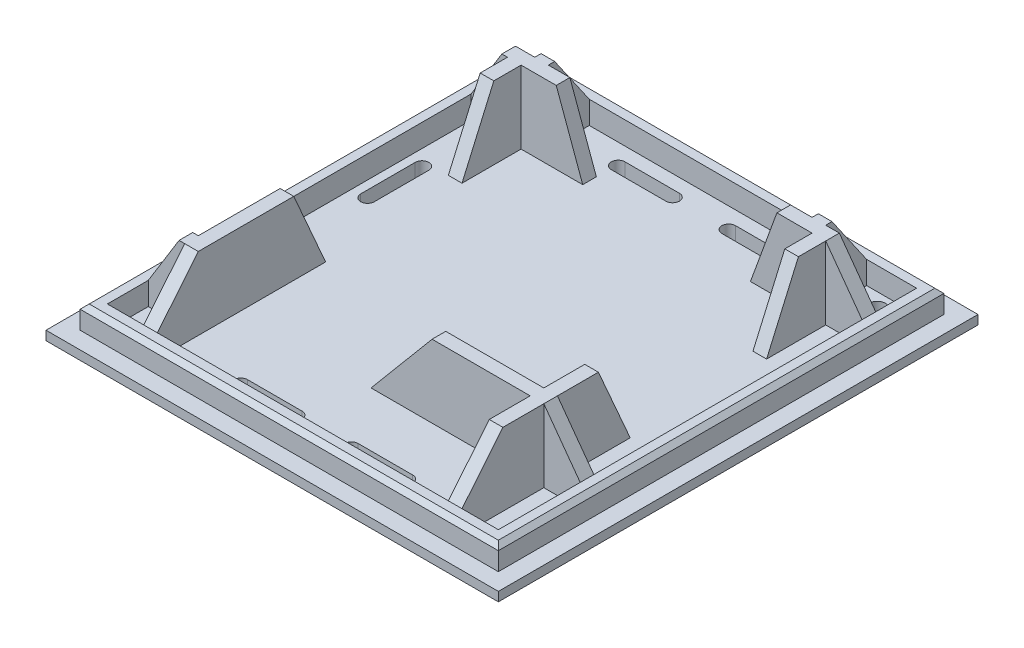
ISO-10303-21;
HEADER;
FILE_DESCRIPTION(('STEP AP214'),'2;1');
FILE_NAME('part.step','',(''),(''),'','','');
FILE_SCHEMA(('AUTOMOTIVE_DESIGN { 1 0 10303 214 1 1 1 1 }'));
ENDSEC;
DATA;
#1=APPLICATION_CONTEXT('core data for automotive mechanical design processes');
#2=APPLICATION_PROTOCOL_DEFINITION('international standard','automotive_design',2000,#1);
#3=PRODUCT_CONTEXT('',#1,'mechanical');
#4=PRODUCT('Part','Part','',(#3));
#5=PRODUCT_RELATED_PRODUCT_CATEGORY('part','',(#4));
#6=PRODUCT_DEFINITION_FORMATION('','',#4);
#7=PRODUCT_DEFINITION_CONTEXT('part definition',#1,'design');
#8=PRODUCT_DEFINITION('design','',#6,#7);
#9=PRODUCT_DEFINITION_SHAPE('','',#8);
#10=(LENGTH_UNIT() NAMED_UNIT(*) SI_UNIT(.MILLI.,.METRE.));
#11=(NAMED_UNIT(*) PLANE_ANGLE_UNIT() SI_UNIT($,.RADIAN.));
#12=(NAMED_UNIT(*) SI_UNIT($,.STERADIAN.) SOLID_ANGLE_UNIT());
#13=UNCERTAINTY_MEASURE_WITH_UNIT(LENGTH_MEASURE(1.E-05),#10,'distance_accuracy_value','');
#14=(GEOMETRIC_REPRESENTATION_CONTEXT(3) GLOBAL_UNCERTAINTY_ASSIGNED_CONTEXT((#13)) GLOBAL_UNIT_ASSIGNED_CONTEXT((#10,
#11,#12)) REPRESENTATION_CONTEXT('',''));
#15=CARTESIAN_POINT('',(0.,0.,0.));
#16=DIRECTION('',(0.,0.,1.));
#17=DIRECTION('',(1.,0.,0.));
#18=AXIS2_PLACEMENT_3D('',#15,#16,#17);
#19=CARTESIAN_POINT('',(0.,16.,28.));
#20=DIRECTION('',(0.,0.,1.));
#21=DIRECTION('',(1.,0.,0.));
#22=AXIS2_PLACEMENT_3D('',#19,#20,#21);
#23=PLANE('',#22);
#24=DIRECTION('',(-1.,0.,0.));
#25=VECTOR('',#24,1.);
#26=CARTESIAN_POINT('',(0.,16.,28.));
#27=LINE('',#26,#25);
#28=CARTESIAN_POINT('',(32.,16.,28.));
#29=VERTEX_POINT('',#28);
#30=CARTESIAN_POINT('',(10.4255940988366,16.,28.));
#31=VERTEX_POINT('',#30);
#32=EDGE_CURVE('E657',#29,#31,#27,.T.);
#33=ORIENTED_EDGE('',*,*,#32,.T.);
#34=DIRECTION('',(0.642787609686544,0.766044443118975,0.));
#35=VECTOR('',#34,1.);
#36=CARTESIAN_POINT('',(-3.00000000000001,0.,28.));
#37=LINE('',#36,#35);
#38=CARTESIAN_POINT('',(-3.,0.,28.));
#39=VERTEX_POINT('',#38);
#40=EDGE_CURVE('E54',#39,#31,#37,.T.);
#41=ORIENTED_EDGE('',*,*,#40,.F.);
#42=DIRECTION('',(-1.,0.,0.));
#43=VECTOR('',#42,1.);
#44=CARTESIAN_POINT('',(0.,0.,28.));
#45=LINE('',#44,#43);
#46=CARTESIAN_POINT('',(32.,0.,28.));
#47=VERTEX_POINT('',#46);
#48=EDGE_CURVE('E650',#47,#39,#45,.T.);
#49=ORIENTED_EDGE('',*,*,#48,.F.);
#50=DIRECTION('',(0.,-1.,0.));
#51=VECTOR('',#50,1.);
#52=CARTESIAN_POINT('',(32.,16.,28.));
#53=LINE('',#52,#51);
#54=EDGE_CURVE('E816',#29,#47,#53,.T.);
#55=ORIENTED_EDGE('',*,*,#54,.F.);
#56=EDGE_LOOP('',(#33,#41,#49,#55));
#57=FACE_BOUND('',#56,.T.);
#58=ADVANCED_FACE('F37',(#57),#23,.T.);
#59=CARTESIAN_POINT('',(0.,16.,25.));
#60=DIRECTION('',(0.,0.,1.));
#61=DIRECTION('',(1.,0.,0.));
#62=AXIS2_PLACEMENT_3D('',#59,#60,#61);
#63=PLANE('',#62);
#64=DIRECTION('',(-0.642787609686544,-0.766044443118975,0.));
#65=VECTOR('',#64,1.);
#66=CARTESIAN_POINT('',(6.11798975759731,10.8663970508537,25.));
#67=LINE('',#66,#65);
#68=CARTESIAN_POINT('',(10.4255940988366,16.,25.));
#69=VERTEX_POINT('',#68);
#70=CARTESIAN_POINT('',(-3.,0.,25.));
#71=VERTEX_POINT('',#70);
#72=EDGE_CURVE('E645',#69,#71,#67,.T.);
#73=ORIENTED_EDGE('',*,*,#72,.F.);
#74=DIRECTION('',(-1.,0.,0.));
#75=VECTOR('',#74,1.);
#76=CARTESIAN_POINT('',(0.,16.,25.));
#77=LINE('',#76,#75);
#78=CARTESIAN_POINT('',(32.,16.,25.));
#79=VERTEX_POINT('',#78);
#80=EDGE_CURVE('E740',#79,#69,#77,.T.);
#81=ORIENTED_EDGE('',*,*,#80,.F.);
#82=DIRECTION('',(0.,-1.,0.));
#83=VECTOR('',#82,1.);
#84=CARTESIAN_POINT('',(32.,16.,25.));
#85=LINE('',#84,#83);
#86=CARTESIAN_POINT('',(32.,0.,25.));
#87=VERTEX_POINT('',#86);
#88=EDGE_CURVE('E736',#79,#87,#85,.T.);
#89=ORIENTED_EDGE('',*,*,#88,.T.);
#90=DIRECTION('',(-1.,0.,0.));
#91=VECTOR('',#90,1.);
#92=CARTESIAN_POINT('',(0.,0.,25.));
#93=LINE('',#92,#91);
#94=EDGE_CURVE('E734',#87,#71,#93,.T.);
#95=ORIENTED_EDGE('',*,*,#94,.T.);
#96=EDGE_LOOP('',(#73,#81,#89,#95));
#97=FACE_BOUND('',#96,.T.);
#98=ADVANCED_FACE('F1075',(#97),#63,.F.);
#99=CARTESIAN_POINT('',(0.,16.,0.));
#100=DIRECTION('',(0.,1.,0.));
#101=DIRECTION('',(0.,0.,1.));
#102=AXIS2_PLACEMENT_3D('',#99,#100,#101);
#103=PLANE('',#102);
#104=ORIENTED_EDGE('',*,*,#80,.T.);
#105=DIRECTION('',(0.,0.,-1.));
#106=VECTOR('',#105,1.);
#107=CARTESIAN_POINT('',(10.4255940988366,16.,292.072916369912));
#108=LINE('',#107,#106);
#109=EDGE_CURVE('E658',#31,#69,#108,.T.);
#110=ORIENTED_EDGE('',*,*,#109,.F.);
#111=ORIENTED_EDGE('',*,*,#32,.F.);
#112=DIRECTION('',(0.,0.,1.));
#113=VECTOR('',#112,1.);
#114=CARTESIAN_POINT('',(32.,16.,0.));
#115=LINE('',#114,#113);
#116=CARTESIAN_POINT('',(32.,16.,37.));
#117=VERTEX_POINT('',#116);
#118=EDGE_CURVE('E2183',#29,#117,#115,.T.);
#119=ORIENTED_EDGE('',*,*,#118,.T.);
#120=DIRECTION('',(-1.,0.,0.));
#121=VECTOR('',#120,1.);
#122=CARTESIAN_POINT('',(0.,16.,37.));
#123=LINE('',#122,#121);
#124=CARTESIAN_POINT('',(35.,16.,37.));
#125=VERTEX_POINT('',#124);
#126=EDGE_CURVE('E963',#125,#117,#123,.T.);
#127=ORIENTED_EDGE('',*,*,#126,.F.);
#128=DIRECTION('',(0.,0.,-1.));
#129=VECTOR('',#128,1.);
#130=CARTESIAN_POINT('',(35.,16.,0.));
#131=LINE('',#130,#129);
#132=CARTESIAN_POINT('',(35.,16.,28.));
#133=VERTEX_POINT('',#132);
#134=EDGE_CURVE('E2186',#125,#133,#131,.T.);
#135=ORIENTED_EDGE('',*,*,#134,.T.);
#136=DIRECTION('',(0.,0.,1.));
#137=VECTOR('',#136,1.);
#138=CARTESIAN_POINT('',(35.,16.,0.));
#139=LINE('',#138,#137);
#140=CARTESIAN_POINT('',(35.,16.,25.));
#141=VERTEX_POINT('',#140);
#142=EDGE_CURVE('E964',#141,#133,#139,.T.);
#143=ORIENTED_EDGE('',*,*,#142,.F.);
#144=DIRECTION('',(0.,0.,-1.));
#145=VECTOR('',#144,1.);
#146=CARTESIAN_POINT('',(35.,16.,0.));
#147=LINE('',#146,#145);
#148=CARTESIAN_POINT('',(35.,16.,16.));
#149=VERTEX_POINT('',#148);
#150=EDGE_CURVE('E2192',#141,#149,#147,.T.);
#151=ORIENTED_EDGE('',*,*,#150,.T.);
#152=DIRECTION('',(1.,0.,0.));
#153=VECTOR('',#152,1.);
#154=CARTESIAN_POINT('',(0.,16.,16.));
#155=LINE('',#154,#153);
#156=CARTESIAN_POINT('',(32.,16.,16.));
#157=VERTEX_POINT('',#156);
#158=EDGE_CURVE('E970',#157,#149,#155,.T.);
#159=ORIENTED_EDGE('',*,*,#158,.F.);
#160=EDGE_CURVE('E2187',#157,#79,#115,.T.);
#161=ORIENTED_EDGE('',*,*,#160,.T.);
#162=EDGE_LOOP('',(#104,#110,#111,#119,#127,#135,#143,#151,#159,#161));
#163=FACE_BOUND('',#162,.T.);
#164=ADVANCED_FACE('F1080',(#163),#103,.T.);
#165=DIRECTION('',(0.,0.,1.));
#166=VECTOR('',#165,1.);
#167=CARTESIAN_POINT('',(-24.2720595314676,16.,0.));
#168=LINE('',#167,#166);
#169=CARTESIAN_POINT('',(-24.2720595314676,16.,-37.));
#170=VERTEX_POINT('',#169);
#171=CARTESIAN_POINT('',(-24.2720595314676,16.,-34.));
#172=VERTEX_POINT('',#171);
#173=EDGE_CURVE('E2507',#170,#172,#168,.T.);
#174=ORIENTED_EDGE('',*,*,#173,.F.);
#175=DIRECTION('',(-1.,0.,0.));
#176=VECTOR('',#175,1.);
#177=CARTESIAN_POINT('',(0.,16.,-37.));
#178=LINE('',#177,#176);
#179=CARTESIAN_POINT('',(-29.,16.,-37.));
#180=VERTEX_POINT('',#179);
#181=EDGE_CURVE('E2202',#170,#180,#178,.T.);
#182=ORIENTED_EDGE('',*,*,#181,.T.);
#183=DIRECTION('',(0.,0.,-1.));
#184=VECTOR('',#183,1.);
#185=CARTESIAN_POINT('',(-29.,16.,0.));
#186=LINE('',#185,#184);
#187=CARTESIAN_POINT('',(-29.,16.,-38.3846153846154));
#188=VERTEX_POINT('',#187);
#189=EDGE_CURVE('E2206',#180,#188,#186,.T.);
#190=ORIENTED_EDGE('',*,*,#189,.T.);
#191=DIRECTION('',(1.,0.,0.));
#192=VECTOR('',#191,1.);
#193=CARTESIAN_POINT('',(0.,16.,-38.3846153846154));
#194=LINE('',#193,#192);
#195=CARTESIAN_POINT('',(-32.,16.,-38.3846153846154));
#196=VERTEX_POINT('',#195);
#197=EDGE_CURVE('E969',#196,#188,#194,.T.);
#198=ORIENTED_EDGE('',*,*,#197,.F.);
#199=DIRECTION('',(0.,0.,1.));
#200=VECTOR('',#199,1.);
#201=CARTESIAN_POINT('',(-31.9999999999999,16.,0.));
#202=LINE('',#201,#200);
#203=CARTESIAN_POINT('',(-32.,16.,-37.));
#204=VERTEX_POINT('',#203);
#205=EDGE_CURVE('E2209',#196,#204,#202,.T.);
#206=ORIENTED_EDGE('',*,*,#205,.T.);
#207=DIRECTION('',(-1.,0.,0.));
#208=VECTOR('',#207,1.);
#209=CARTESIAN_POINT('',(0.,16.,-37.));
#210=LINE('',#209,#208);
#211=CARTESIAN_POINT('',(-36.2307692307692,16.,-37.));
#212=VERTEX_POINT('',#211);
#213=EDGE_CURVE('E2211',#204,#212,#210,.T.);
#214=ORIENTED_EDGE('',*,*,#213,.T.);
#215=DIRECTION('',(0.,0.,-1.));
#216=VECTOR('',#215,1.);
#217=CARTESIAN_POINT('',(-36.2307692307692,16.,0.));
#218=LINE('',#217,#216);
#219=CARTESIAN_POINT('',(-36.2307692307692,16.,-34.));
#220=VERTEX_POINT('',#219);
#221=EDGE_CURVE('E958',#220,#212,#218,.T.);
#222=ORIENTED_EDGE('',*,*,#221,.F.);
#223=DIRECTION('',(1.,0.,0.));
#224=VECTOR('',#223,1.);
#225=CARTESIAN_POINT('',(0.,16.,-34.));
#226=LINE('',#225,#224);
#227=CARTESIAN_POINT('',(-35.,16.,-34.));
#228=VERTEX_POINT('',#227);
#229=EDGE_CURVE('E2214',#220,#228,#226,.T.);
#230=ORIENTED_EDGE('',*,*,#229,.T.);
#231=DIRECTION('',(0.,0.,1.));
#232=VECTOR('',#231,1.);
#233=CARTESIAN_POINT('',(-35.,16.,0.));
#234=LINE('',#233,#232);
#235=CARTESIAN_POINT('',(-35.,16.,-28.));
#236=VERTEX_POINT('',#235);
#237=EDGE_CURVE('E2217',#228,#236,#234,.T.);
#238=ORIENTED_EDGE('',*,*,#237,.T.);
#239=DIRECTION('',(1.,0.,0.));
#240=VECTOR('',#239,1.);
#241=CARTESIAN_POINT('',(-81.8187996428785,16.,-28.));
#242=LINE('',#241,#240);
#243=CARTESIAN_POINT('',(-32.,16.,-28.));
#244=VERTEX_POINT('',#243);
#245=EDGE_CURVE('E2513',#236,#244,#242,.T.);
#246=ORIENTED_EDGE('',*,*,#245,.T.);
#247=DIRECTION('',(0.,0.,1.));
#248=VECTOR('',#247,1.);
#249=CARTESIAN_POINT('',(-32.,16.,0.));
#250=LINE('',#249,#248);
#251=CARTESIAN_POINT('',(-32.,16.,-34.));
#252=VERTEX_POINT('',#251);
#253=EDGE_CURVE('E2225',#252,#244,#250,.T.);
#254=ORIENTED_EDGE('',*,*,#253,.F.);
#255=DIRECTION('',(1.,0.,0.));
#256=VECTOR('',#255,1.);
#257=CARTESIAN_POINT('',(0.,16.,-34.));
#258=LINE('',#257,#256);
#259=EDGE_CURVE('E2229',#252,#172,#258,.T.);
#260=ORIENTED_EDGE('',*,*,#259,.T.);
#261=EDGE_LOOP('',(#174,#182,#190,#198,#206,#214,#222,#230,#238,#246,#254,#260));
#262=FACE_BOUND('',#261,.T.);
#263=ADVANCED_FACE('F1834',(#262),#103,.T.);
#264=CARTESIAN_POINT('',(0.,16.,-37.));
#265=DIRECTION('',(0.,0.,1.));
#266=DIRECTION('',(1.,0.,0.));
#267=AXIS2_PLACEMENT_3D('',#264,#265,#266);
#268=PLANE('',#267);
#269=ORIENTED_EDGE('',*,*,#181,.F.);
#270=DIRECTION('',(-0.342020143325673,0.939692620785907,0.));
#271=VECTOR('',#270,1.);
#272=CARTESIAN_POINT('',(-18.4485357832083,0.,-37.));
#273=LINE('',#272,#271);
#274=CARTESIAN_POINT('',(-18.4485357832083,0.,-37.));
#275=VERTEX_POINT('',#274);
#276=EDGE_CURVE('E2499',#275,#170,#273,.T.);
#277=ORIENTED_EDGE('',*,*,#276,.F.);
#278=DIRECTION('',(-1.,0.,0.));
#279=VECTOR('',#278,1.);
#280=CARTESIAN_POINT('',(0.,0.,-37.));
#281=LINE('',#280,#279);
#282=CARTESIAN_POINT('',(-29.,0.,-37.));
#283=VERTEX_POINT('',#282);
#284=EDGE_CURVE('E697',#275,#283,#281,.T.);
#285=ORIENTED_EDGE('',*,*,#284,.T.);
#286=DIRECTION('',(0.,-1.,0.));
#287=VECTOR('',#286,1.);
#288=CARTESIAN_POINT('',(-29.,16.,-37.));
#289=LINE('',#288,#287);
#290=EDGE_CURVE('E778',#180,#283,#289,.T.);
#291=ORIENTED_EDGE('',*,*,#290,.F.);
#292=EDGE_LOOP('',(#269,#277,#285,#291));
#293=FACE_BOUND('',#292,.T.);
#294=ADVANCED_FACE('F1300',(#293),#268,.F.);
#295=CARTESIAN_POINT('',(0.,16.,-34.));
#296=DIRECTION('',(0.,0.,-1.));
#297=DIRECTION('',(-1.,0.,0.));
#298=AXIS2_PLACEMENT_3D('',#295,#296,#297);
#299=PLANE('',#298);
#300=DIRECTION('',(1.,0.,0.));
#301=VECTOR('',#300,1.);
#302=CARTESIAN_POINT('',(0.,0.,-34.));
#303=LINE('',#302,#301);
#304=CARTESIAN_POINT('',(-32.,0.,-34.));
#305=VERTEX_POINT('',#304);
#306=CARTESIAN_POINT('',(-18.4485357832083,0.,-34.));
#307=VERTEX_POINT('',#306);
#308=EDGE_CURVE('E731',#305,#307,#303,.T.);
#309=ORIENTED_EDGE('',*,*,#308,.T.);
#310=DIRECTION('',(-0.342020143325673,0.939692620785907,0.));
#311=VECTOR('',#310,1.);
#312=CARTESIAN_POINT('',(-21.4327679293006,8.1991104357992,-34.));
#313=LINE('',#312,#311);
#314=EDGE_CURVE('E977',#307,#172,#313,.T.);
#315=ORIENTED_EDGE('',*,*,#314,.T.);
#316=ORIENTED_EDGE('',*,*,#259,.F.);
#317=DIRECTION('',(0.,-1.,0.));
#318=VECTOR('',#317,1.);
#319=CARTESIAN_POINT('',(-32.,16.,-34.));
#320=LINE('',#319,#318);
#321=EDGE_CURVE('E743',#252,#305,#320,.T.);
#322=ORIENTED_EDGE('',*,*,#321,.T.);
#323=EDGE_LOOP('',(#309,#315,#316,#322));
#324=FACE_BOUND('',#323,.T.);
#325=ADVANCED_FACE('F1385',(#324),#299,.F.);
#326=CARTESIAN_POINT('',(35.,16.,0.));
#327=DIRECTION('',(-1.,0.,0.));
#328=DIRECTION('',(0.,0.,1.));
#329=AXIS2_PLACEMENT_3D('',#326,#327,#328);
#330=PLANE('',#329);
#331=CARTESIAN_POINT('',(35.,16.,-28.));
#332=VERTEX_POINT('',#331);
#333=CARTESIAN_POINT('',(35.,16.,-34.));
#334=VERTEX_POINT('',#333);
#335=EDGE_CURVE('E2191',#332,#334,#147,.T.);
#336=ORIENTED_EDGE('',*,*,#335,.F.);
#337=DIRECTION('',(0.,0.916157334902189,-0.400818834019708));
#338=VECTOR('',#337,1.);
#339=CARTESIAN_POINT('',(35.,0.,-21.));
#340=LINE('',#339,#338);
#341=CARTESIAN_POINT('',(35.,0.,-21.));
#342=VERTEX_POINT('',#341);
#343=EDGE_CURVE('E2516',#342,#332,#340,.T.);
#344=ORIENTED_EDGE('',*,*,#343,.F.);
#345=DIRECTION('',(0.,0.,-1.));
#346=VECTOR('',#345,1.);
#347=CARTESIAN_POINT('',(35.,0.,0.));
#348=LINE('',#347,#346);
#349=CARTESIAN_POINT('',(35.,0.,-34.));
#350=VERTEX_POINT('',#349);
#351=EDGE_CURVE('E681',#342,#350,#348,.T.);
#352=ORIENTED_EDGE('',*,*,#351,.T.);
#353=DIRECTION('',(0.,-1.,0.));
#354=VECTOR('',#353,1.);
#355=CARTESIAN_POINT('',(35.,16.,-34.));
#356=LINE('',#355,#354);
#357=EDGE_CURVE('E797',#334,#350,#356,.T.);
#358=ORIENTED_EDGE('',*,*,#357,.F.);
#359=EDGE_LOOP('',(#336,#344,#352,#358));
#360=FACE_BOUND('',#359,.T.);
#361=ADVANCED_FACE('F1255',(#360),#330,.F.);
#362=CARTESIAN_POINT('',(-35.,16.,0.));
#363=DIRECTION('',(1.,0.,0.));
#364=DIRECTION('',(0.,0.,-1.));
#365=AXIS2_PLACEMENT_3D('',#362,#363,#364);
#366=PLANE('',#365);
#367=DIRECTION('',(0.,0.,1.));
#368=VECTOR('',#367,1.);
#369=CARTESIAN_POINT('',(-35.,0.,0.));
#370=LINE('',#369,#368);
#371=CARTESIAN_POINT('',(-35.,0.,-34.));
#372=VERTEX_POINT('',#371);
#373=CARTESIAN_POINT('',(-35.,0.,-21.));
#374=VERTEX_POINT('',#373);
#375=EDGE_CURVE('E714',#372,#374,#370,.T.);
#376=ORIENTED_EDGE('',*,*,#375,.T.);
#377=DIRECTION('',(0.,-0.916157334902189,0.400818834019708));
#378=VECTOR('',#377,1.);
#379=CARTESIAN_POINT('',(-35.,0.,-21.));
#380=LINE('',#379,#378);
#381=EDGE_CURVE('E2510',#236,#374,#380,.T.);
#382=ORIENTED_EDGE('',*,*,#381,.F.);
#383=ORIENTED_EDGE('',*,*,#237,.F.);
#384=DIRECTION('',(0.,-1.,0.));
#385=VECTOR('',#384,1.);
#386=CARTESIAN_POINT('',(-35.,16.,-34.));
#387=LINE('',#386,#385);
#388=EDGE_CURVE('E762',#228,#372,#387,.T.);
#389=ORIENTED_EDGE('',*,*,#388,.T.);
#390=EDGE_LOOP('',(#376,#382,#383,#389));
#391=FACE_BOUND('',#390,.T.);
#392=ADVANCED_FACE('F1344',(#391),#366,.F.);
#393=CARTESIAN_POINT('',(-32.,16.,0.));
#394=DIRECTION('',(1.,0.,0.));
#395=DIRECTION('',(0.,0.,-1.));
#396=AXIS2_PLACEMENT_3D('',#393,#394,#395);
#397=PLANE('',#396);
#398=DIRECTION('',(0.,0.916157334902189,-0.400818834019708));
#399=VECTOR('',#398,1.);
#400=CARTESIAN_POINT('',(-32.,5.71803278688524,-23.5016393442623));
#401=LINE('',#400,#399);
#402=CARTESIAN_POINT('',(-32.,0.,-21.));
#403=VERTEX_POINT('',#402);
#404=EDGE_CURVE('E2537',#403,#244,#401,.T.);
#405=ORIENTED_EDGE('',*,*,#404,.F.);
#406=DIRECTION('',(0.,0.,1.));
#407=VECTOR('',#406,1.);
#408=CARTESIAN_POINT('',(-32.,0.,0.));
#409=LINE('',#408,#407);
#410=EDGE_CURVE('E727',#305,#403,#409,.T.);
#411=ORIENTED_EDGE('',*,*,#410,.F.);
#412=ORIENTED_EDGE('',*,*,#321,.F.);
#413=ORIENTED_EDGE('',*,*,#253,.T.);
#414=EDGE_LOOP('',(#405,#411,#412,#413));
#415=FACE_BOUND('',#414,.T.);
#416=ADVANCED_FACE('F1377',(#415),#397,.T.);
#417=CARTESIAN_POINT('',(32.,16.,0.));
#418=DIRECTION('',(1.,0.,0.));
#419=DIRECTION('',(0.,0.,-1.));
#420=AXIS2_PLACEMENT_3D('',#417,#418,#419);
#421=PLANE('',#420);
#422=DIRECTION('',(0.,0.,1.));
#423=VECTOR('',#422,1.);
#424=CARTESIAN_POINT('',(32.,0.,0.));
#425=LINE('',#424,#423);
#426=CARTESIAN_POINT('',(32.,0.,-34.));
#427=VERTEX_POINT('',#426);
#428=CARTESIAN_POINT('',(32.,0.,-21.));
#429=VERTEX_POINT('',#428);
#430=EDGE_CURVE('E670',#427,#429,#425,.T.);
#431=ORIENTED_EDGE('',*,*,#430,.T.);
#432=DIRECTION('',(0.,0.916157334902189,-0.400818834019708));
#433=VECTOR('',#432,1.);
#434=CARTESIAN_POINT('',(32.,5.71803278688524,-23.5016393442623));
#435=LINE('',#434,#433);
#436=CARTESIAN_POINT('',(32.,16.,-28.));
#437=VERTEX_POINT('',#436);
#438=EDGE_CURVE('E2534',#429,#437,#435,.T.);
#439=ORIENTED_EDGE('',*,*,#438,.T.);
#440=CARTESIAN_POINT('',(32.,16.,-34.));
#441=VERTEX_POINT('',#440);
#442=EDGE_CURVE('E2188',#441,#437,#115,.T.);
#443=ORIENTED_EDGE('',*,*,#442,.F.);
#444=DIRECTION('',(0.,-1.,0.));
#445=VECTOR('',#444,1.);
#446=CARTESIAN_POINT('',(32.,16.,-34.));
#447=LINE('',#446,#445);
#448=EDGE_CURVE('E739',#441,#427,#447,.T.);
#449=ORIENTED_EDGE('',*,*,#448,.T.);
#450=EDGE_LOOP('',(#431,#439,#443,#449));
#451=FACE_BOUND('',#450,.T.);
#452=ADVANCED_FACE('F1220',(#451),#421,.F.);
#453=DIRECTION('',(0.,0.,-1.));
#454=VECTOR('',#453,1.);
#455=CARTESIAN_POINT('',(24.2720595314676,16.,0.));
#456=LINE('',#455,#454);
#457=CARTESIAN_POINT('',(24.2720595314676,16.,-34.));
#458=VERTEX_POINT('',#457);
#459=CARTESIAN_POINT('',(24.2720595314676,16.,-37.));
#460=VERTEX_POINT('',#459);
#461=EDGE_CURVE('E2504',#458,#460,#456,.T.);
#462=ORIENTED_EDGE('',*,*,#461,.F.);
#463=EDGE_CURVE('E2228',#458,#441,#258,.T.);
#464=ORIENTED_EDGE('',*,*,#463,.T.);
#465=ORIENTED_EDGE('',*,*,#442,.T.);
#466=DIRECTION('',(-1.,0.,0.));
#467=VECTOR('',#466,1.);
#468=CARTESIAN_POINT('',(0.,16.,-28.));
#469=LINE('',#468,#467);
#470=EDGE_CURVE('E972',#332,#437,#469,.T.);
#471=ORIENTED_EDGE('',*,*,#470,.F.);
#472=ORIENTED_EDGE('',*,*,#335,.T.);
#473=CARTESIAN_POINT('',(35.,16.,-37.));
#474=VERTEX_POINT('',#473);
#475=EDGE_CURVE('E966',#474,#334,#139,.T.);
#476=ORIENTED_EDGE('',*,*,#475,.F.);
#477=DIRECTION('',(-1.,0.,0.));
#478=VECTOR('',#477,1.);
#479=CARTESIAN_POINT('',(0.,16.,-37.));
#480=LINE('',#479,#478);
#481=CARTESIAN_POINT('',(32.,16.,-37.));
#482=VERTEX_POINT('',#481);
#483=EDGE_CURVE('E2195',#474,#482,#480,.T.);
#484=ORIENTED_EDGE('',*,*,#483,.T.);
#485=DIRECTION('',(0.,0.,-1.));
#486=VECTOR('',#485,1.);
#487=CARTESIAN_POINT('',(31.9999999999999,16.,0.));
#488=LINE('',#487,#486);
#489=CARTESIAN_POINT('',(31.9999999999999,16.,-38.3846153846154));
#490=VERTEX_POINT('',#489);
#491=EDGE_CURVE('E2197',#482,#490,#488,.T.);
#492=ORIENTED_EDGE('',*,*,#491,.T.);
#493=CARTESIAN_POINT('',(29.,16.,-38.3846153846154));
#494=VERTEX_POINT('',#493);
#495=EDGE_CURVE('E967',#494,#490,#194,.T.);
#496=ORIENTED_EDGE('',*,*,#495,.F.);
#497=DIRECTION('',(0.,0.,1.));
#498=VECTOR('',#497,1.);
#499=CARTESIAN_POINT('',(29.,16.,0.));
#500=LINE('',#499,#498);
#501=CARTESIAN_POINT('',(29.,16.,-37.));
#502=VERTEX_POINT('',#501);
#503=EDGE_CURVE('E2200',#494,#502,#500,.T.);
#504=ORIENTED_EDGE('',*,*,#503,.T.);
#505=EDGE_CURVE('E2203',#502,#460,#178,.T.);
#506=ORIENTED_EDGE('',*,*,#505,.T.);
#507=EDGE_LOOP('',(#462,#464,#465,#471,#472,#476,#484,#492,#496,#504,#506));
#508=FACE_BOUND('',#507,.T.);
#509=ADVANCED_FACE('F1853',(#508),#103,.T.);
#510=DIRECTION('',(1.,0.,0.));
#511=VECTOR('',#510,1.);
#512=CARTESIAN_POINT('',(-81.8187996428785,16.,16.));
#513=LINE('',#512,#511);
#514=CARTESIAN_POINT('',(-35.,16.,16.));
#515=VERTEX_POINT('',#514);
#516=CARTESIAN_POINT('',(-32.,16.,16.));
#517=VERTEX_POINT('',#516);
#518=EDGE_CURVE('E2518',#515,#517,#513,.T.);
#519=ORIENTED_EDGE('',*,*,#518,.F.);
#520=CARTESIAN_POINT('',(-35.,16.,34.));
#521=VERTEX_POINT('',#520);
#522=EDGE_CURVE('E2216',#515,#521,#234,.T.);
#523=ORIENTED_EDGE('',*,*,#522,.T.);
#524=DIRECTION('',(-1.,0.,0.));
#525=VECTOR('',#524,1.);
#526=CARTESIAN_POINT('',(0.,16.,34.));
#527=LINE('',#526,#525);
#528=CARTESIAN_POINT('',(-36.2307692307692,16.,34.));
#529=VERTEX_POINT('',#528);
#530=EDGE_CURVE('E2220',#521,#529,#527,.T.);
#531=ORIENTED_EDGE('',*,*,#530,.T.);
#532=CARTESIAN_POINT('',(-36.2307692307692,16.,37.));
#533=VERTEX_POINT('',#532);
#534=EDGE_CURVE('E960',#533,#529,#218,.T.);
#535=ORIENTED_EDGE('',*,*,#534,.F.);
#536=DIRECTION('',(1.,0.,0.));
#537=VECTOR('',#536,1.);
#538=CARTESIAN_POINT('',(0.,16.,37.));
#539=LINE('',#538,#537);
#540=CARTESIAN_POINT('',(-35.,16.,37.));
#541=VERTEX_POINT('',#540);
#542=EDGE_CURVE('E2165',#533,#541,#539,.T.);
#543=ORIENTED_EDGE('',*,*,#542,.T.);
#544=CARTESIAN_POINT('',(-32.,16.,37.));
#545=VERTEX_POINT('',#544);
#546=EDGE_CURVE('E961',#545,#541,#123,.T.);
#547=ORIENTED_EDGE('',*,*,#546,.F.);
#548=EDGE_CURVE('E2224',#517,#545,#250,.T.);
#549=ORIENTED_EDGE('',*,*,#548,.F.);
#550=EDGE_LOOP('',(#519,#523,#531,#535,#543,#547,#549));
#551=FACE_BOUND('',#550,.T.);
#552=ADVANCED_FACE('F1151',(#551),#103,.T.);
#553=CARTESIAN_POINT('',(-43.,5.,-46.));
#554=DIRECTION('',(1.,0.,0.));
#555=DIRECTION('',(0.,0.,-1.));
#556=AXIS2_PLACEMENT_3D('',#553,#554,#555);
#557=PLANE('',#556);
#558=DIRECTION('',(0.,0.,1.));
#559=VECTOR('',#558,1.);
#560=CARTESIAN_POINT('',(-43.,5.,-46.));
#561=LINE('',#560,#559);
#562=CARTESIAN_POINT('',(-43.,5.,-46.));
#563=VERTEX_POINT('',#562);
#564=CARTESIAN_POINT('',(-43.,5.,-37.));
#565=VERTEX_POINT('',#564);
#566=EDGE_CURVE('E887',#563,#565,#561,.T.);
#567=ORIENTED_EDGE('',*,*,#566,.T.);
#568=DIRECTION('',(0.,-1.,0.));
#569=VECTOR('',#568,1.);
#570=CARTESIAN_POINT('',(-43.,16.,-37.));
#571=LINE('',#570,#569);
#572=CARTESIAN_POINT('',(-43.,0.,-37.));
#573=VERTEX_POINT('',#572);
#574=EDGE_CURVE('E768',#565,#573,#571,.T.);
#575=ORIENTED_EDGE('',*,*,#574,.T.);
#576=DIRECTION('',(0.,0.,1.));
#577=VECTOR('',#576,1.);
#578=CARTESIAN_POINT('',(-43.,0.,-46.));
#579=LINE('',#578,#577);
#580=CARTESIAN_POINT('',(-43.,0.,-46.));
#581=VERTEX_POINT('',#580);
#582=EDGE_CURVE('E908',#581,#573,#579,.T.);
#583=ORIENTED_EDGE('',*,*,#582,.F.);
#584=DIRECTION('',(0.,-1.,0.));
#585=VECTOR('',#584,1.);
#586=CARTESIAN_POINT('',(-43.,5.,-46.));
#587=LINE('',#586,#585);
#588=EDGE_CURVE('E906',#563,#581,#587,.T.);
#589=ORIENTED_EDGE('',*,*,#588,.F.);
#590=EDGE_LOOP('',(#567,#575,#583,#589));
#591=FACE_BOUND('',#590,.T.);
#592=ADVANCED_FACE('F1148',(#591),#557,.T.);
#593=CARTESIAN_POINT('',(-43.,0.,-34.));
#594=VERTEX_POINT('',#593);
#595=CARTESIAN_POINT('',(-43.,0.,34.));
#596=VERTEX_POINT('',#595);
#597=EDGE_CURVE('E912',#594,#596,#579,.T.);
#598=ORIENTED_EDGE('',*,*,#597,.F.);
#599=DIRECTION('',(0.,-1.,0.));
#600=VECTOR('',#599,1.);
#601=CARTESIAN_POINT('',(-43.,16.,-34.));
#602=LINE('',#601,#600);
#603=CARTESIAN_POINT('',(-43.,5.,-34.));
#604=VERTEX_POINT('',#603);
#605=EDGE_CURVE('E765',#604,#594,#602,.T.);
#606=ORIENTED_EDGE('',*,*,#605,.F.);
#607=CARTESIAN_POINT('',(-43.,5.,34.));
#608=VERTEX_POINT('',#607);
#609=EDGE_CURVE('E891',#604,#608,#561,.T.);
#610=ORIENTED_EDGE('',*,*,#609,.T.);
#611=DIRECTION('',(0.,-1.,0.));
#612=VECTOR('',#611,1.);
#613=CARTESIAN_POINT('',(-43.,16.,34.));
#614=LINE('',#613,#612);
#615=EDGE_CURVE('E757',#608,#596,#614,.T.);
#616=ORIENTED_EDGE('',*,*,#615,.T.);
#617=EDGE_LOOP('',(#598,#606,#610,#616));
#618=FACE_BOUND('',#617,.T.);
#619=ADVANCED_FACE('F1150',(#618),#557,.T.);
#620=CARTESIAN_POINT('',(-43.,0.,37.));
#621=VERTEX_POINT('',#620);
#622=CARTESIAN_POINT('',(-43.,0.,46.));
#623=VERTEX_POINT('',#622);
#624=EDGE_CURVE('E886',#621,#623,#579,.T.);
#625=ORIENTED_EDGE('',*,*,#624,.F.);
#626=DIRECTION('',(0.,-1.,0.));
#627=VECTOR('',#626,1.);
#628=CARTESIAN_POINT('',(-43.,16.,37.));
#629=LINE('',#628,#627);
#630=CARTESIAN_POINT('',(-43.,5.,37.));
#631=VERTEX_POINT('',#630);
#632=EDGE_CURVE('E754',#631,#621,#629,.T.);
#633=ORIENTED_EDGE('',*,*,#632,.F.);
#634=CARTESIAN_POINT('',(-43.,5.,46.));
#635=VERTEX_POINT('',#634);
#636=EDGE_CURVE('E892',#631,#635,#561,.T.);
#637=ORIENTED_EDGE('',*,*,#636,.T.);
#638=DIRECTION('',(0.,-1.,0.));
#639=VECTOR('',#638,1.);
#640=CARTESIAN_POINT('',(-43.,5.,46.));
#641=LINE('',#640,#639);
#642=EDGE_CURVE('E935',#635,#623,#641,.T.);
#643=ORIENTED_EDGE('',*,*,#642,.T.);
#644=EDGE_LOOP('',(#625,#633,#637,#643));
#645=FACE_BOUND('',#644,.T.);
#646=ADVANCED_FACE('F1146',(#645),#557,.T.);
#647=CARTESIAN_POINT('',(-43.,5.,46.));
#648=DIRECTION('',(0.,0.,-1.));
#649=DIRECTION('',(-1.,0.,0.));
#650=AXIS2_PLACEMENT_3D('',#647,#648,#649);
#651=PLANE('',#650);
#652=DIRECTION('',(1.,0.,0.));
#653=VECTOR('',#652,1.);
#654=CARTESIAN_POINT('',(-43.,5.,46.));
#655=LINE('',#654,#653);
#656=CARTESIAN_POINT('',(-32.,5.,46.));
#657=VERTEX_POINT('',#656);
#658=CARTESIAN_POINT('',(32.,5.,46.));
#659=VERTEX_POINT('',#658);
#660=EDGE_CURVE('E897',#657,#659,#655,.T.);
#661=ORIENTED_EDGE('',*,*,#660,.T.);
#662=DIRECTION('',(0.,-1.,0.));
#663=VECTOR('',#662,1.);
#664=CARTESIAN_POINT('',(32.,16.,46.));
#665=LINE('',#664,#663);
#666=CARTESIAN_POINT('',(32.,0.,46.));
#667=VERTEX_POINT('',#666);
#668=EDGE_CURVE('E814',#659,#667,#665,.T.);
#669=ORIENTED_EDGE('',*,*,#668,.T.);
#670=DIRECTION('',(1.,0.,0.));
#671=VECTOR('',#670,1.);
#672=CARTESIAN_POINT('',(-43.,0.,46.));
#673=LINE('',#672,#671);
#674=CARTESIAN_POINT('',(-32.,0.,46.));
#675=VERTEX_POINT('',#674);
#676=EDGE_CURVE('E917',#675,#667,#673,.T.);
#677=ORIENTED_EDGE('',*,*,#676,.F.);
#678=DIRECTION('',(0.,-1.,0.));
#679=VECTOR('',#678,1.);
#680=CARTESIAN_POINT('',(-32.,16.,46.));
#681=LINE('',#680,#679);
#682=EDGE_CURVE('E746',#657,#675,#681,.T.);
#683=ORIENTED_EDGE('',*,*,#682,.F.);
#684=EDGE_LOOP('',(#661,#669,#677,#683));
#685=FACE_BOUND('',#684,.T.);
#686=ADVANCED_FACE('F1142',(#685),#651,.T.);
#687=CARTESIAN_POINT('',(35.,0.,46.));
#688=VERTEX_POINT('',#687);
#689=CARTESIAN_POINT('',(43.,0.,46.));
#690=VERTEX_POINT('',#689);
#691=EDGE_CURVE('E911',#688,#690,#673,.T.);
#692=ORIENTED_EDGE('',*,*,#691,.F.);
#693=DIRECTION('',(0.,-1.,0.));
#694=VECTOR('',#693,1.);
#695=CARTESIAN_POINT('',(35.,16.,46.));
#696=LINE('',#695,#694);
#697=CARTESIAN_POINT('',(35.,5.,46.));
#698=VERTEX_POINT('',#697);
#699=EDGE_CURVE('E811',#698,#688,#696,.T.);
#700=ORIENTED_EDGE('',*,*,#699,.F.);
#701=CARTESIAN_POINT('',(43.,5.,46.));
#702=VERTEX_POINT('',#701);
#703=EDGE_CURVE('E890',#698,#702,#655,.T.);
#704=ORIENTED_EDGE('',*,*,#703,.T.);
#705=DIRECTION('',(0.,-1.,0.));
#706=VECTOR('',#705,1.);
#707=CARTESIAN_POINT('',(43.,5.,46.));
#708=LINE('',#707,#706);
#709=EDGE_CURVE('E932',#702,#690,#708,.T.);
#710=ORIENTED_EDGE('',*,*,#709,.T.);
#711=EDGE_LOOP('',(#692,#700,#704,#710));
#712=FACE_BOUND('',#711,.T.);
#713=ADVANCED_FACE('F1145',(#712),#651,.T.);
#714=CARTESIAN_POINT('',(-35.,5.,46.));
#715=VERTEX_POINT('',#714);
#716=EDGE_CURVE('E893',#635,#715,#655,.T.);
#717=ORIENTED_EDGE('',*,*,#716,.T.);
#718=DIRECTION('',(0.,-1.,0.));
#719=VECTOR('',#718,1.);
#720=CARTESIAN_POINT('',(-35.,16.,46.));
#721=LINE('',#720,#719);
#722=CARTESIAN_POINT('',(-35.,0.,46.));
#723=VERTEX_POINT('',#722);
#724=EDGE_CURVE('E749',#715,#723,#721,.T.);
#725=ORIENTED_EDGE('',*,*,#724,.T.);
#726=EDGE_CURVE('E913',#623,#723,#673,.T.);
#727=ORIENTED_EDGE('',*,*,#726,.F.);
#728=ORIENTED_EDGE('',*,*,#642,.F.);
#729=EDGE_LOOP('',(#717,#725,#727,#728));
#730=FACE_BOUND('',#729,.T.);
#731=ADVANCED_FACE('F1140',(#730),#651,.T.);
#732=CARTESIAN_POINT('',(43.,5.,-46.));
#733=DIRECTION('',(-1.,0.,0.));
#734=DIRECTION('',(0.,0.,1.));
#735=AXIS2_PLACEMENT_3D('',#732,#733,#734);
#736=PLANE('',#735);
#737=DIRECTION('',(0.,0.,-1.));
#738=VECTOR('',#737,1.);
#739=CARTESIAN_POINT('',(43.,5.,-46.));
#740=LINE('',#739,#738);
#741=CARTESIAN_POINT('',(43.,5.,28.));
#742=VERTEX_POINT('',#741);
#743=EDGE_CURVE('E898',#702,#742,#740,.T.);
#744=ORIENTED_EDGE('',*,*,#743,.T.);
#745=DIRECTION('',(0.,-1.,0.));
#746=VECTOR('',#745,1.);
#747=CARTESIAN_POINT('',(43.,16.,28.));
#748=LINE('',#747,#746);
#749=CARTESIAN_POINT('',(43.,0.,28.));
#750=VERTEX_POINT('',#749);
#751=EDGE_CURVE('E806',#742,#750,#748,.T.);
#752=ORIENTED_EDGE('',*,*,#751,.T.);
#753=DIRECTION('',(0.,0.,-1.));
#754=VECTOR('',#753,1.);
#755=CARTESIAN_POINT('',(43.,0.,-46.));
#756=LINE('',#755,#754);
#757=EDGE_CURVE('E918',#690,#750,#756,.T.);
#758=ORIENTED_EDGE('',*,*,#757,.F.);
#759=ORIENTED_EDGE('',*,*,#709,.F.);
#760=EDGE_LOOP('',(#744,#752,#758,#759));
#761=FACE_BOUND('',#760,.T.);
#762=ADVANCED_FACE('F1136',(#761),#736,.T.);
#763=CARTESIAN_POINT('',(43.,0.,25.));
#764=VERTEX_POINT('',#763);
#765=CARTESIAN_POINT('',(43.,0.,-34.));
#766=VERTEX_POINT('',#765);
#767=EDGE_CURVE('E922',#764,#766,#756,.T.);
#768=ORIENTED_EDGE('',*,*,#767,.F.);
#769=DIRECTION('',(0.,-1.,0.));
#770=VECTOR('',#769,1.);
#771=CARTESIAN_POINT('',(43.,16.,25.));
#772=LINE('',#771,#770);
#773=CARTESIAN_POINT('',(43.,5.,25.));
#774=VERTEX_POINT('',#773);
#775=EDGE_CURVE('E803',#774,#764,#772,.T.);
#776=ORIENTED_EDGE('',*,*,#775,.F.);
#777=CARTESIAN_POINT('',(43.,5.,-34.));
#778=VERTEX_POINT('',#777);
#779=EDGE_CURVE('E902',#774,#778,#740,.T.);
#780=ORIENTED_EDGE('',*,*,#779,.T.);
#781=DIRECTION('',(0.,-1.,0.));
#782=VECTOR('',#781,1.);
#783=CARTESIAN_POINT('',(43.,16.,-34.));
#784=LINE('',#783,#782);
#785=EDGE_CURVE('E795',#778,#766,#784,.T.);
#786=ORIENTED_EDGE('',*,*,#785,.T.);
#787=EDGE_LOOP('',(#768,#776,#780,#786));
#788=FACE_BOUND('',#787,.T.);
#789=ADVANCED_FACE('F1139',(#788),#736,.T.);
#790=CARTESIAN_POINT('',(43.,0.,-37.));
#791=VERTEX_POINT('',#790);
#792=CARTESIAN_POINT('',(43.,0.,-46.));
#793=VERTEX_POINT('',#792);
#794=EDGE_CURVE('E916',#791,#793,#756,.T.);
#795=ORIENTED_EDGE('',*,*,#794,.F.);
#796=DIRECTION('',(0.,-1.,0.));
#797=VECTOR('',#796,1.);
#798=CARTESIAN_POINT('',(43.,16.,-37.));
#799=LINE('',#798,#797);
#800=CARTESIAN_POINT('',(43.,5.,-37.));
#801=VERTEX_POINT('',#800);
#802=EDGE_CURVE('E792',#801,#791,#799,.T.);
#803=ORIENTED_EDGE('',*,*,#802,.F.);
#804=CARTESIAN_POINT('',(43.,5.,-46.));
#805=VERTEX_POINT('',#804);
#806=EDGE_CURVE('E896',#801,#805,#740,.T.);
#807=ORIENTED_EDGE('',*,*,#806,.T.);
#808=DIRECTION('',(0.,-1.,0.));
#809=VECTOR('',#808,1.);
#810=CARTESIAN_POINT('',(43.,5.,-46.));
#811=LINE('',#810,#809);
#812=EDGE_CURVE('E929',#805,#793,#811,.T.);
#813=ORIENTED_EDGE('',*,*,#812,.T.);
#814=EDGE_LOOP('',(#795,#803,#807,#813));
#815=FACE_BOUND('',#814,.T.);
#816=ADVANCED_FACE('F1134',(#815),#736,.T.);
#817=CARTESIAN_POINT('',(-43.,5.,-46.));
#818=DIRECTION('',(0.,0.,1.));
#819=DIRECTION('',(1.,0.,0.));
#820=AXIS2_PLACEMENT_3D('',#817,#818,#819);
#821=PLANE('',#820);
#822=DIRECTION('',(-1.,0.,0.));
#823=VECTOR('',#822,1.);
#824=CARTESIAN_POINT('',(-43.,5.,-46.));
#825=LINE('',#824,#823);
#826=CARTESIAN_POINT('',(31.9999999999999,5.,-46.));
#827=VERTEX_POINT('',#826);
#828=EDGE_CURVE('E903',#805,#827,#825,.T.);
#829=ORIENTED_EDGE('',*,*,#828,.T.);
#830=DIRECTION('',(0.,-1.,0.));
#831=VECTOR('',#830,1.);
#832=CARTESIAN_POINT('',(32.,16.,-46.));
#833=LINE('',#832,#831);
#834=CARTESIAN_POINT('',(32.,0.,-46.));
#835=VERTEX_POINT('',#834);
#836=EDGE_CURVE('E787',#827,#835,#833,.T.);
#837=ORIENTED_EDGE('',*,*,#836,.T.);
#838=DIRECTION('',(-1.,0.,0.));
#839=VECTOR('',#838,1.);
#840=CARTESIAN_POINT('',(-43.,0.,-46.));
#841=LINE('',#840,#839);
#842=EDGE_CURVE('E923',#793,#835,#841,.T.);
#843=ORIENTED_EDGE('',*,*,#842,.F.);
#844=ORIENTED_EDGE('',*,*,#812,.F.);
#845=EDGE_LOOP('',(#829,#837,#843,#844));
#846=FACE_BOUND('',#845,.T.);
#847=ADVANCED_FACE('F1130',(#846),#821,.T.);
#848=CARTESIAN_POINT('',(29.,0.,-46.));
#849=VERTEX_POINT('',#848);
#850=CARTESIAN_POINT('',(-29.,0.,-46.));
#851=VERTEX_POINT('',#850);
#852=EDGE_CURVE('E926',#849,#851,#841,.T.);
#853=ORIENTED_EDGE('',*,*,#852,.F.);
#854=DIRECTION('',(0.,-1.,0.));
#855=VECTOR('',#854,1.);
#856=CARTESIAN_POINT('',(29.,16.,-46.));
#857=LINE('',#856,#855);
#858=CARTESIAN_POINT('',(29.,5.,-46.));
#859=VERTEX_POINT('',#858);
#860=EDGE_CURVE('E784',#859,#849,#857,.T.);
#861=ORIENTED_EDGE('',*,*,#860,.F.);
#862=CARTESIAN_POINT('',(-29.,5.,-46.));
#863=VERTEX_POINT('',#862);
#864=EDGE_CURVE('E907',#859,#863,#825,.T.);
#865=ORIENTED_EDGE('',*,*,#864,.T.);
#866=DIRECTION('',(0.,-1.,0.));
#867=VECTOR('',#866,1.);
#868=CARTESIAN_POINT('',(-29.,16.,-46.));
#869=LINE('',#868,#867);
#870=EDGE_CURVE('E776',#863,#851,#869,.T.);
#871=ORIENTED_EDGE('',*,*,#870,.T.);
#872=EDGE_LOOP('',(#853,#861,#865,#871));
#873=FACE_BOUND('',#872,.T.);
#874=ADVANCED_FACE('F1133',(#873),#821,.T.);
#875=CARTESIAN_POINT('',(-32.,0.,-46.));
#876=VERTEX_POINT('',#875);
#877=EDGE_CURVE('E921',#876,#581,#841,.T.);
#878=ORIENTED_EDGE('',*,*,#877,.F.);
#879=DIRECTION('',(0.,-1.,0.));
#880=VECTOR('',#879,1.);
#881=CARTESIAN_POINT('',(-32.,16.,-46.));
#882=LINE('',#881,#880);
#883=CARTESIAN_POINT('',(-32.,5.,-46.));
#884=VERTEX_POINT('',#883);
#885=EDGE_CURVE('E773',#884,#876,#882,.T.);
#886=ORIENTED_EDGE('',*,*,#885,.F.);
#887=EDGE_CURVE('E901',#884,#563,#825,.T.);
#888=ORIENTED_EDGE('',*,*,#887,.T.);
#889=ORIENTED_EDGE('',*,*,#588,.T.);
#890=EDGE_LOOP('',(#878,#886,#888,#889));
#891=FACE_BOUND('',#890,.T.);
#892=ADVANCED_FACE('F1113',(#891),#821,.T.);
#893=CARTESIAN_POINT('',(0.,0.,0.));
#894=DIRECTION('',(0.,-1.,0.));
#895=DIRECTION('',(0.,0.,-1.));
#896=AXIS2_PLACEMENT_3D('',#893,#894,#895);
#897=PLANE('',#896);
#898=CARTESIAN_POINT('',(40.005,0.,42.865));
#899=DIRECTION('',(0.,1.,0.));
#900=DIRECTION('',(0.,0.,1.));
#901=AXIS2_PLACEMENT_3D('',#898,#899,#900);
#902=CIRCLE('',#901,1.84);
#903=CARTESIAN_POINT('',(40.005,0.,44.705));
#904=VERTEX_POINT('',#903);
#905=EDGE_CURVE('E843',#904,#904,#902,.T.);
#906=ORIENTED_EDGE('',*,*,#905,.F.);
#907=EDGE_LOOP('',(#906));
#908=FACE_BOUND('',#907,.T.);
#909=DIRECTION('',(0.,0.,-1.));
#910=VECTOR('',#909,1.);
#911=CARTESIAN_POINT('',(35.,0.,0.));
#912=LINE('',#911,#910);
#913=CARTESIAN_POINT('',(35.,0.,28.));
#914=VERTEX_POINT('',#913);
#915=EDGE_CURVE('E667',#688,#914,#912,.T.);
#916=ORIENTED_EDGE('',*,*,#915,.F.);
#917=ORIENTED_EDGE('',*,*,#691,.T.);
#918=ORIENTED_EDGE('',*,*,#757,.T.);
#919=DIRECTION('',(1.,0.,0.));
#920=VECTOR('',#919,1.);
#921=CARTESIAN_POINT('',(0.,0.,28.));
#922=LINE('',#921,#920);
#923=EDGE_CURVE('E675',#914,#750,#922,.T.);
#924=ORIENTED_EDGE('',*,*,#923,.F.);
#925=EDGE_LOOP('',(#916,#917,#918,#924));
#926=FACE_BOUND('',#925,.T.);
#927=ADVANCED_FACE('F1109',(#908,#926),#897,.F.);
#928=CARTESIAN_POINT('',(37.465,0.,-42.865));
#929=DIRECTION('',(0.,1.,0.));
#930=DIRECTION('',(0.,0.,1.));
#931=AXIS2_PLACEMENT_3D('',#928,#929,#930);
#932=CIRCLE('',#931,1.84);
#933=CARTESIAN_POINT('',(37.465,0.,-41.025));
#934=VERTEX_POINT('',#933);
#935=EDGE_CURVE('E855',#934,#934,#932,.T.);
#936=ORIENTED_EDGE('',*,*,#935,.F.);
#937=EDGE_LOOP('',(#936));
#938=FACE_BOUND('',#937,.T.);
#939=DIRECTION('',(-1.,0.,0.));
#940=VECTOR('',#939,1.);
#941=CARTESIAN_POINT('',(0.,0.,-37.));
#942=LINE('',#941,#940);
#943=CARTESIAN_POINT('',(32.,0.,-37.));
#944=VERTEX_POINT('',#943);
#945=EDGE_CURVE('E688',#791,#944,#942,.T.);
#946=ORIENTED_EDGE('',*,*,#945,.F.);
#947=ORIENTED_EDGE('',*,*,#794,.T.);
#948=ORIENTED_EDGE('',*,*,#842,.T.);
#949=DIRECTION('',(0.,0.,-1.));
#950=VECTOR('',#949,1.);
#951=CARTESIAN_POINT('',(31.9999999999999,0.,0.));
#952=LINE('',#951,#950);
#953=EDGE_CURVE('E691',#944,#835,#952,.T.);
#954=ORIENTED_EDGE('',*,*,#953,.F.);
#955=EDGE_LOOP('',(#946,#947,#948,#954));
#956=FACE_BOUND('',#955,.T.);
#957=ADVANCED_FACE('F1112',(#938,#956),#897,.F.);
#958=CARTESIAN_POINT('',(-36.195,0.,-42.865));
#959=DIRECTION('',(0.,1.,0.));
#960=DIRECTION('',(0.,0.,1.));
#961=AXIS2_PLACEMENT_3D('',#958,#959,#960);
#962=CIRCLE('',#961,1.84);
#963=CARTESIAN_POINT('',(-36.195,0.,-41.025));
#964=VERTEX_POINT('',#963);
#965=EDGE_CURVE('E861',#964,#964,#962,.T.);
#966=ORIENTED_EDGE('',*,*,#965,.F.);
#967=EDGE_LOOP('',(#966));
#968=FACE_BOUND('',#967,.T.);
#969=DIRECTION('',(0.,0.,1.));
#970=VECTOR('',#969,1.);
#971=CARTESIAN_POINT('',(-31.9999999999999,0.,0.));
#972=LINE('',#971,#970);
#973=CARTESIAN_POINT('',(-32.,0.,-37.));
#974=VERTEX_POINT('',#973);
#975=EDGE_CURVE('E704',#876,#974,#972,.T.);
#976=ORIENTED_EDGE('',*,*,#975,.F.);
#977=ORIENTED_EDGE('',*,*,#877,.T.);
#978=ORIENTED_EDGE('',*,*,#582,.T.);
#979=DIRECTION('',(-1.,0.,0.));
#980=VECTOR('',#979,1.);
#981=CARTESIAN_POINT('',(0.,0.,-37.));
#982=LINE('',#981,#980);
#983=EDGE_CURVE('E707',#974,#573,#982,.T.);
#984=ORIENTED_EDGE('',*,*,#983,.F.);
#985=EDGE_LOOP('',(#976,#977,#978,#984));
#986=FACE_BOUND('',#985,.T.);
#987=ADVANCED_FACE('F1964',(#968,#986),#897,.F.);
#988=CARTESIAN_POINT('',(-40.005,0.,42.865));
#989=DIRECTION('',(0.,1.,0.));
#990=DIRECTION('',(0.,0.,1.));
#991=AXIS2_PLACEMENT_3D('',#988,#989,#990);
#992=CIRCLE('',#991,1.84);
#993=CARTESIAN_POINT('',(-40.005,0.,44.705));
#994=VERTEX_POINT('',#993);
#995=EDGE_CURVE('E849',#994,#994,#992,.T.);
#996=ORIENTED_EDGE('',*,*,#995,.F.);
#997=EDGE_LOOP('',(#996));
#998=FACE_BOUND('',#997,.T.);
#999=DIRECTION('',(1.,0.,0.));
#1000=VECTOR('',#999,1.);
#1001=CARTESIAN_POINT('',(0.,0.,37.));
#1002=LINE('',#1001,#1000);
#1003=CARTESIAN_POINT('',(-35.,0.,37.));
#1004=VERTEX_POINT('',#1003);
#1005=EDGE_CURVE('E720',#621,#1004,#1002,.T.);
#1006=ORIENTED_EDGE('',*,*,#1005,.F.);
#1007=ORIENTED_EDGE('',*,*,#624,.T.);
#1008=ORIENTED_EDGE('',*,*,#726,.T.);
#1009=DIRECTION('',(0.,0.,1.));
#1010=VECTOR('',#1009,1.);
#1011=CARTESIAN_POINT('',(-35.,0.,0.));
#1012=LINE('',#1011,#1010);
#1013=EDGE_CURVE('E723',#1004,#723,#1012,.T.);
#1014=ORIENTED_EDGE('',*,*,#1013,.F.);
#1015=EDGE_LOOP('',(#1006,#1007,#1008,#1014));
#1016=FACE_BOUND('',#1015,.T.);
#1017=ADVANCED_FACE('F1822',(#998,#1016),#897,.F.);
#1018=DIRECTION('',(0.,0.,1.));
#1019=VECTOR('',#1018,1.);
#1020=CARTESIAN_POINT('',(38.1153846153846,0.,7.83333333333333));
#1021=LINE('',#1020,#1019);
#1022=CARTESIAN_POINT('',(38.1153846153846,0.,7.83333333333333));
#1023=VERTEX_POINT('',#1022);
#1024=CARTESIAN_POINT('',(38.1153846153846,0.,19.8333333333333));
#1025=VERTEX_POINT('',#1024);
#1026=EDGE_CURVE('E2254',#1023,#1025,#1021,.T.);
#1027=ORIENTED_EDGE('',*,*,#1026,.F.);
#1028=CARTESIAN_POINT('',(39.6153846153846,0.,7.83333333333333));
#1029=DIRECTION('',(0.,1.,0.));
#1030=DIRECTION('',(0.,0.,1.));
#1031=AXIS2_PLACEMENT_3D('',#1028,#1029,#1030);
#1032=CIRCLE('',#1031,1.49999999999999);
#1033=CARTESIAN_POINT('',(41.1153846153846,0.,7.83333333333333));
#1034=VERTEX_POINT('',#1033);
#1035=EDGE_CURVE('E62',#1034,#1023,#1032,.T.);
#1036=ORIENTED_EDGE('',*,*,#1035,.F.);
#1037=DIRECTION('',(0.,0.,-1.));
#1038=VECTOR('',#1037,1.);
#1039=CARTESIAN_POINT('',(41.1153846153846,0.,19.8333333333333));
#1040=LINE('',#1039,#1038);
#1041=CARTESIAN_POINT('',(41.1153846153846,0.,19.8333333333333));
#1042=VERTEX_POINT('',#1041);
#1043=EDGE_CURVE('E2260',#1042,#1034,#1040,.T.);
#1044=ORIENTED_EDGE('',*,*,#1043,.F.);
#1045=CARTESIAN_POINT('',(39.6153846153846,0.,19.8333333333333));
#1046=DIRECTION('',(0.,1.,0.));
#1047=DIRECTION('',(0.,0.,1.));
#1048=AXIS2_PLACEMENT_3D('',#1045,#1046,#1047);
#1049=CIRCLE('',#1048,1.49999999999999);
#1050=EDGE_CURVE('E2257',#1025,#1042,#1049,.T.);
#1051=ORIENTED_EDGE('',*,*,#1050,.F.);
#1052=EDGE_LOOP('',(#1027,#1036,#1044,#1051));
#1053=FACE_BOUND('',#1052,.T.);
#1054=DIRECTION('',(1.,0.,0.));
#1055=VECTOR('',#1054,1.);
#1056=CARTESIAN_POINT('',(6.16666666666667,0.,43.));
#1057=LINE('',#1056,#1055);
#1058=CARTESIAN_POINT('',(6.16666666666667,0.,43.));
#1059=VERTEX_POINT('',#1058);
#1060=CARTESIAN_POINT('',(18.1666666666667,0.,43.));
#1061=VERTEX_POINT('',#1060);
#1062=EDGE_CURVE('E2285',#1059,#1061,#1057,.T.);
#1063=ORIENTED_EDGE('',*,*,#1062,.F.);
#1064=CARTESIAN_POINT('',(6.16666666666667,0.,41.5));
#1065=DIRECTION('',(0.,1.,0.));
#1066=DIRECTION('',(0.,0.,-1.));
#1067=AXIS2_PLACEMENT_3D('',#1064,#1065,#1066);
#1068=CIRCLE('',#1067,1.5);
#1069=CARTESIAN_POINT('',(6.16666666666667,0.,40.));
#1070=VERTEX_POINT('',#1069);
#1071=EDGE_CURVE('E2283',#1070,#1059,#1068,.T.);
#1072=ORIENTED_EDGE('',*,*,#1071,.F.);
#1073=DIRECTION('',(-1.,0.,0.));
#1074=VECTOR('',#1073,1.);
#1075=CARTESIAN_POINT('',(6.16666666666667,0.,40.));
#1076=LINE('',#1075,#1074);
#1077=CARTESIAN_POINT('',(18.1666666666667,0.,40.));
#1078=VERTEX_POINT('',#1077);
#1079=EDGE_CURVE('E2291',#1078,#1070,#1076,.T.);
#1080=ORIENTED_EDGE('',*,*,#1079,.F.);
#1081=CARTESIAN_POINT('',(18.1666666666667,0.,41.5));
#1082=DIRECTION('',(0.,1.,0.));
#1083=DIRECTION('',(0.,0.,-1.));
#1084=AXIS2_PLACEMENT_3D('',#1081,#1082,#1083);
#1085=CIRCLE('',#1084,1.5);
#1086=EDGE_CURVE('E2288',#1061,#1078,#1085,.T.);
#1087=ORIENTED_EDGE('',*,*,#1086,.F.);
#1088=EDGE_LOOP('',(#1063,#1072,#1080,#1087));
#1089=FACE_BOUND('',#1088,.T.);
#1090=DIRECTION('',(1.,0.,0.));
#1091=VECTOR('',#1090,1.);
#1092=CARTESIAN_POINT('',(-6.16666666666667,0.,43.));
#1093=LINE('',#1092,#1091);
#1094=CARTESIAN_POINT('',(-18.1666666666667,0.,43.));
#1095=VERTEX_POINT('',#1094);
#1096=CARTESIAN_POINT('',(-6.16666666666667,0.,43.));
#1097=VERTEX_POINT('',#1096);
#1098=EDGE_CURVE('E2317',#1095,#1097,#1093,.T.);
#1099=ORIENTED_EDGE('',*,*,#1098,.F.);
#1100=CARTESIAN_POINT('',(-18.1666666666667,0.,41.5));
#1101=DIRECTION('',(0.,1.,0.));
#1102=DIRECTION('',(0.,0.,1.));
#1103=AXIS2_PLACEMENT_3D('',#1100,#1101,#1102);
#1104=CIRCLE('',#1103,1.5);
#1105=CARTESIAN_POINT('',(-18.1666666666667,0.,40.));
#1106=VERTEX_POINT('',#1105);
#1107=EDGE_CURVE('E2315',#1106,#1095,#1104,.T.);
#1108=ORIENTED_EDGE('',*,*,#1107,.F.);
#1109=DIRECTION('',(-1.,0.,0.));
#1110=VECTOR('',#1109,1.);
#1111=CARTESIAN_POINT('',(-6.16666666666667,0.,40.));
#1112=LINE('',#1111,#1110);
#1113=CARTESIAN_POINT('',(-6.16666666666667,0.,40.));
#1114=VERTEX_POINT('',#1113);
#1115=EDGE_CURVE('E2323',#1114,#1106,#1112,.T.);
#1116=ORIENTED_EDGE('',*,*,#1115,.F.);
#1117=CARTESIAN_POINT('',(-6.16666666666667,0.,41.5));
#1118=DIRECTION('',(0.,1.,0.));
#1119=DIRECTION('',(0.,0.,1.));
#1120=AXIS2_PLACEMENT_3D('',#1117,#1118,#1119);
#1121=CIRCLE('',#1120,1.5);
#1122=EDGE_CURVE('E2320',#1097,#1114,#1121,.T.);
#1123=ORIENTED_EDGE('',*,*,#1122,.F.);
#1124=EDGE_LOOP('',(#1099,#1108,#1116,#1123));
#1125=FACE_BOUND('',#1124,.T.);
#1126=DIRECTION('',(0.,0.,-1.));
#1127=VECTOR('',#1126,1.);
#1128=CARTESIAN_POINT('',(-38.1153846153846,0.,7.83333333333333));
#1129=LINE('',#1128,#1127);
#1130=CARTESIAN_POINT('',(-38.1153846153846,0.,19.8333333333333));
#1131=VERTEX_POINT('',#1130);
#1132=CARTESIAN_POINT('',(-38.1153846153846,0.,7.83333333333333));
#1133=VERTEX_POINT('',#1132);
#1134=EDGE_CURVE('E2349',#1131,#1133,#1129,.T.);
#1135=ORIENTED_EDGE('',*,*,#1134,.F.);
#1136=CARTESIAN_POINT('',(-39.6153846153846,0.,19.8333333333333));
#1137=DIRECTION('',(0.,1.,0.));
#1138=DIRECTION('',(0.,0.,-1.));
#1139=AXIS2_PLACEMENT_3D('',#1136,#1137,#1138);
#1140=CIRCLE('',#1139,1.49999999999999);
#1141=CARTESIAN_POINT('',(-41.1153846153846,0.,19.8333333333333));
#1142=VERTEX_POINT('',#1141);
#1143=EDGE_CURVE('E2347',#1142,#1131,#1140,.T.);
#1144=ORIENTED_EDGE('',*,*,#1143,.F.);
#1145=DIRECTION('',(0.,0.,1.));
#1146=VECTOR('',#1145,1.);
#1147=CARTESIAN_POINT('',(-41.1153846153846,0.,19.8333333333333));
#1148=LINE('',#1147,#1146);
#1149=CARTESIAN_POINT('',(-41.1153846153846,0.,7.83333333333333));
#1150=VERTEX_POINT('',#1149);
#1151=EDGE_CURVE('E2355',#1150,#1142,#1148,.T.);
#1152=ORIENTED_EDGE('',*,*,#1151,.F.);
#1153=CARTESIAN_POINT('',(-39.6153846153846,0.,7.83333333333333));
#1154=DIRECTION('',(0.,1.,0.));
#1155=DIRECTION('',(0.,0.,-1.));
#1156=AXIS2_PLACEMENT_3D('',#1153,#1154,#1155);
#1157=CIRCLE('',#1156,1.49999999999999);
#1158=EDGE_CURVE('E2352',#1133,#1150,#1157,.T.);
#1159=ORIENTED_EDGE('',*,*,#1158,.F.);
#1160=EDGE_LOOP('',(#1135,#1144,#1152,#1159));
#1161=FACE_BOUND('',#1160,.T.);
#1162=DIRECTION('',(-1.,0.,0.));
#1163=VECTOR('',#1162,1.);
#1164=CARTESIAN_POINT('',(6.16666666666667,0.,-43.));
#1165=LINE('',#1164,#1163);
#1166=CARTESIAN_POINT('',(18.1666666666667,0.,-43.));
#1167=VERTEX_POINT('',#1166);
#1168=CARTESIAN_POINT('',(6.16666666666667,0.,-43.));
#1169=VERTEX_POINT('',#1168);
#1170=EDGE_CURVE('E2381',#1167,#1169,#1165,.T.);
#1171=ORIENTED_EDGE('',*,*,#1170,.F.);
#1172=CARTESIAN_POINT('',(18.1666666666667,0.,-41.5));
#1173=DIRECTION('',(0.,1.,0.));
#1174=DIRECTION('',(0.,0.,1.));
#1175=AXIS2_PLACEMENT_3D('',#1172,#1173,#1174);
#1176=CIRCLE('',#1175,1.5);
#1177=CARTESIAN_POINT('',(18.1666666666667,0.,-40.));
#1178=VERTEX_POINT('',#1177);
#1179=EDGE_CURVE('E2379',#1178,#1167,#1176,.T.);
#1180=ORIENTED_EDGE('',*,*,#1179,.F.);
#1181=DIRECTION('',(1.,0.,0.));
#1182=VECTOR('',#1181,1.);
#1183=CARTESIAN_POINT('',(6.16666666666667,0.,-40.));
#1184=LINE('',#1183,#1182);
#1185=CARTESIAN_POINT('',(6.16666666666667,0.,-40.));
#1186=VERTEX_POINT('',#1185);
#1187=EDGE_CURVE('E2387',#1186,#1178,#1184,.T.);
#1188=ORIENTED_EDGE('',*,*,#1187,.F.);
#1189=CARTESIAN_POINT('',(6.16666666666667,0.,-41.5));
#1190=DIRECTION('',(0.,1.,0.));
#1191=DIRECTION('',(0.,0.,1.));
#1192=AXIS2_PLACEMENT_3D('',#1189,#1190,#1191);
#1193=CIRCLE('',#1192,1.5);
#1194=EDGE_CURVE('E2384',#1169,#1186,#1193,.T.);
#1195=ORIENTED_EDGE('',*,*,#1194,.F.);
#1196=EDGE_LOOP('',(#1171,#1180,#1188,#1195));
#1197=FACE_BOUND('',#1196,.T.);
#1198=DIRECTION('',(0.,0.,1.));
#1199=VECTOR('',#1198,1.);
#1200=CARTESIAN_POINT('',(38.1153846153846,0.,-7.83333333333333));
#1201=LINE('',#1200,#1199);
#1202=CARTESIAN_POINT('',(38.1153846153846,0.,-19.8333333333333));
#1203=VERTEX_POINT('',#1202);
#1204=CARTESIAN_POINT('',(38.1153846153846,0.,-7.83333333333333));
#1205=VERTEX_POINT('',#1204);
#1206=EDGE_CURVE('E2413',#1203,#1205,#1201,.T.);
#1207=ORIENTED_EDGE('',*,*,#1206,.F.);
#1208=CARTESIAN_POINT('',(39.6153846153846,0.,-19.8333333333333));
#1209=DIRECTION('',(0.,1.,0.));
#1210=DIRECTION('',(0.,0.,-1.));
#1211=AXIS2_PLACEMENT_3D('',#1208,#1209,#1210);
#1212=CIRCLE('',#1211,1.49999999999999);
#1213=CARTESIAN_POINT('',(41.1153846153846,0.,-19.8333333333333));
#1214=VERTEX_POINT('',#1213);
#1215=EDGE_CURVE('E2411',#1214,#1203,#1212,.T.);
#1216=ORIENTED_EDGE('',*,*,#1215,.F.);
#1217=DIRECTION('',(0.,0.,-1.));
#1218=VECTOR('',#1217,1.);
#1219=CARTESIAN_POINT('',(41.1153846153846,0.,-19.8333333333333));
#1220=LINE('',#1219,#1218);
#1221=CARTESIAN_POINT('',(41.1153846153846,0.,-7.83333333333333));
#1222=VERTEX_POINT('',#1221);
#1223=EDGE_CURVE('E2419',#1222,#1214,#1220,.T.);
#1224=ORIENTED_EDGE('',*,*,#1223,.F.);
#1225=CARTESIAN_POINT('',(39.6153846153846,0.,-7.83333333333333));
#1226=DIRECTION('',(0.,1.,0.));
#1227=DIRECTION('',(0.,0.,-1.));
#1228=AXIS2_PLACEMENT_3D('',#1225,#1226,#1227);
#1229=CIRCLE('',#1228,1.49999999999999);
#1230=EDGE_CURVE('E2416',#1205,#1222,#1229,.T.);
#1231=ORIENTED_EDGE('',*,*,#1230,.F.);
#1232=EDGE_LOOP('',(#1207,#1216,#1224,#1231));
#1233=FACE_BOUND('',#1232,.T.);
#1234=DIRECTION('',(0.,0.,1.));
#1235=VECTOR('',#1234,1.);
#1236=CARTESIAN_POINT('',(-41.1153846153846,0.,-19.8333333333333));
#1237=LINE('',#1236,#1235);
#1238=CARTESIAN_POINT('',(-41.1153846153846,0.,-19.8333333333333));
#1239=VERTEX_POINT('',#1238);
#1240=CARTESIAN_POINT('',(-41.1153846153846,0.,-7.83333333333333));
#1241=VERTEX_POINT('',#1240);
#1242=EDGE_CURVE('E2445',#1239,#1241,#1237,.T.);
#1243=ORIENTED_EDGE('',*,*,#1242,.F.);
#1244=CARTESIAN_POINT('',(-39.6153846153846,0.,-19.8333333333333));
#1245=DIRECTION('',(0.,1.,0.));
#1246=DIRECTION('',(0.,0.,1.));
#1247=AXIS2_PLACEMENT_3D('',#1244,#1245,#1246);
#1248=CIRCLE('',#1247,1.49999999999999);
#1249=CARTESIAN_POINT('',(-38.1153846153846,0.,-19.8333333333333));
#1250=VERTEX_POINT('',#1249);
#1251=EDGE_CURVE('E2443',#1250,#1239,#1248,.T.);
#1252=ORIENTED_EDGE('',*,*,#1251,.F.);
#1253=DIRECTION('',(0.,0.,-1.));
#1254=VECTOR('',#1253,1.);
#1255=CARTESIAN_POINT('',(-38.1153846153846,0.,-7.83333333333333));
#1256=LINE('',#1255,#1254);
#1257=CARTESIAN_POINT('',(-38.1153846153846,0.,-7.83333333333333));
#1258=VERTEX_POINT('',#1257);
#1259=EDGE_CURVE('E2451',#1258,#1250,#1256,.T.);
#1260=ORIENTED_EDGE('',*,*,#1259,.F.);
#1261=CARTESIAN_POINT('',(-39.6153846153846,0.,-7.83333333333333));
#1262=DIRECTION('',(0.,1.,0.));
#1263=DIRECTION('',(0.,0.,1.));
#1264=AXIS2_PLACEMENT_3D('',#1261,#1262,#1263);
#1265=CIRCLE('',#1264,1.49999999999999);
#1266=EDGE_CURVE('E2448',#1241,#1258,#1265,.T.);
#1267=ORIENTED_EDGE('',*,*,#1266,.F.);
#1268=EDGE_LOOP('',(#1243,#1252,#1260,#1267));
#1269=FACE_BOUND('',#1268,.T.);
#1270=DIRECTION('',(-1.,0.,0.));
#1271=VECTOR('',#1270,1.);
#1272=CARTESIAN_POINT('',(-6.16666666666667,0.,-43.));
#1273=LINE('',#1272,#1271);
#1274=CARTESIAN_POINT('',(-6.16666666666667,0.,-43.));
#1275=VERTEX_POINT('',#1274);
#1276=CARTESIAN_POINT('',(-18.1666666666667,0.,-43.));
#1277=VERTEX_POINT('',#1276);
#1278=EDGE_CURVE('E2477',#1275,#1277,#1273,.T.);
#1279=ORIENTED_EDGE('',*,*,#1278,.F.);
#1280=CARTESIAN_POINT('',(-6.16666666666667,0.,-41.5));
#1281=DIRECTION('',(0.,1.,0.));
#1282=DIRECTION('',(0.,0.,-1.));
#1283=AXIS2_PLACEMENT_3D('',#1280,#1281,#1282);
#1284=CIRCLE('',#1283,1.5);
#1285=CARTESIAN_POINT('',(-6.16666666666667,0.,-40.));
#1286=VERTEX_POINT('',#1285);
#1287=EDGE_CURVE('E2475',#1286,#1275,#1284,.T.);
#1288=ORIENTED_EDGE('',*,*,#1287,.F.);
#1289=DIRECTION('',(1.,0.,0.));
#1290=VECTOR('',#1289,1.);
#1291=CARTESIAN_POINT('',(-6.16666666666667,0.,-40.));
#1292=LINE('',#1291,#1290);
#1293=CARTESIAN_POINT('',(-18.1666666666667,0.,-40.));
#1294=VERTEX_POINT('',#1293);
#1295=EDGE_CURVE('E2483',#1294,#1286,#1292,.T.);
#1296=ORIENTED_EDGE('',*,*,#1295,.F.);
#1297=CARTESIAN_POINT('',(-18.1666666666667,0.,-41.5));
#1298=DIRECTION('',(0.,1.,0.));
#1299=DIRECTION('',(0.,0.,-1.));
#1300=AXIS2_PLACEMENT_3D('',#1297,#1298,#1299);
#1301=CIRCLE('',#1300,1.5);
#1302=EDGE_CURVE('E2480',#1277,#1294,#1301,.T.);
#1303=ORIENTED_EDGE('',*,*,#1302,.F.);
#1304=EDGE_LOOP('',(#1279,#1288,#1296,#1303));
#1305=FACE_BOUND('',#1304,.T.);
#1306=DIRECTION('',(0.,0.,-1.));
#1307=VECTOR('',#1306,1.);
#1308=CARTESIAN_POINT('',(-18.4485357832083,0.,0.));
#1309=LINE('',#1308,#1307);
#1310=EDGE_CURVE('E2502',#307,#275,#1309,.T.);
#1311=ORIENTED_EDGE('',*,*,#1310,.F.);
#1312=ORIENTED_EDGE('',*,*,#308,.F.);
#1313=ORIENTED_EDGE('',*,*,#410,.T.);
#1314=DIRECTION('',(1.,0.,0.));
#1315=VECTOR('',#1314,1.);
#1316=CARTESIAN_POINT('',(-81.8187996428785,0.,-21.));
#1317=LINE('',#1316,#1315);
#1318=EDGE_CURVE('E2521',#374,#403,#1317,.T.);
#1319=ORIENTED_EDGE('',*,*,#1318,.F.);
#1320=ORIENTED_EDGE('',*,*,#375,.F.);
#1321=DIRECTION('',(1.,0.,0.));
#1322=VECTOR('',#1321,1.);
#1323=CARTESIAN_POINT('',(0.,0.,-34.));
#1324=LINE('',#1323,#1322);
#1325=EDGE_CURVE('E710',#594,#372,#1324,.T.);
#1326=ORIENTED_EDGE('',*,*,#1325,.F.);
#1327=ORIENTED_EDGE('',*,*,#597,.T.);
#1328=DIRECTION('',(-1.,0.,0.));
#1329=VECTOR('',#1328,1.);
#1330=CARTESIAN_POINT('',(0.,0.,34.));
#1331=LINE('',#1330,#1329);
#1332=CARTESIAN_POINT('',(-35.,0.,34.));
#1333=VERTEX_POINT('',#1332);
#1334=EDGE_CURVE('E717',#1333,#596,#1331,.T.);
#1335=ORIENTED_EDGE('',*,*,#1334,.F.);
#1336=CARTESIAN_POINT('',(-35.,0.,9.));
#1337=VERTEX_POINT('',#1336);
#1338=EDGE_CURVE('E713',#1337,#1333,#370,.T.);
#1339=ORIENTED_EDGE('',*,*,#1338,.F.);
#1340=DIRECTION('',(1.,0.,0.));
#1341=VECTOR('',#1340,1.);
#1342=CARTESIAN_POINT('',(-81.8187996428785,0.,9.));
#1343=LINE('',#1342,#1341);
#1344=CARTESIAN_POINT('',(-32.,0.,9.));
#1345=VERTEX_POINT('',#1344);
#1346=EDGE_CURVE('E2524',#1337,#1345,#1343,.T.);
#1347=ORIENTED_EDGE('',*,*,#1346,.T.);
#1348=EDGE_CURVE('E726',#1345,#675,#409,.T.);
#1349=ORIENTED_EDGE('',*,*,#1348,.T.);
#1350=ORIENTED_EDGE('',*,*,#676,.T.);
#1351=EDGE_CURVE('E664',#47,#667,#425,.T.);
#1352=ORIENTED_EDGE('',*,*,#1351,.F.);
#1353=ORIENTED_EDGE('',*,*,#48,.T.);
#1354=DIRECTION('',(0.,0.,-1.));
#1355=VECTOR('',#1354,1.);
#1356=CARTESIAN_POINT('',(-3.,0.,0.));
#1357=LINE('',#1356,#1355);
#1358=EDGE_CURVE('E642',#39,#71,#1357,.T.);
#1359=ORIENTED_EDGE('',*,*,#1358,.T.);
#1360=ORIENTED_EDGE('',*,*,#94,.F.);
#1361=CARTESIAN_POINT('',(32.,0.,9.));
#1362=VERTEX_POINT('',#1361);
#1363=EDGE_CURVE('E669',#1362,#87,#425,.T.);
#1364=ORIENTED_EDGE('',*,*,#1363,.F.);
#1365=CARTESIAN_POINT('',(35.,0.,9.));
#1366=VERTEX_POINT('',#1365);
#1367=EDGE_CURVE('E2527',#1362,#1366,#1343,.T.);
#1368=ORIENTED_EDGE('',*,*,#1367,.T.);
#1369=CARTESIAN_POINT('',(35.,0.,25.));
#1370=VERTEX_POINT('',#1369);
#1371=EDGE_CURVE('E682',#1370,#1366,#348,.T.);
#1372=ORIENTED_EDGE('',*,*,#1371,.F.);
#1373=DIRECTION('',(-1.,0.,0.));
#1374=VECTOR('',#1373,1.);
#1375=CARTESIAN_POINT('',(0.,0.,25.));
#1376=LINE('',#1375,#1374);
#1377=EDGE_CURVE('E678',#764,#1370,#1376,.T.);
#1378=ORIENTED_EDGE('',*,*,#1377,.F.);
#1379=ORIENTED_EDGE('',*,*,#767,.T.);
#1380=DIRECTION('',(1.,0.,0.));
#1381=VECTOR('',#1380,1.);
#1382=CARTESIAN_POINT('',(0.,0.,-34.));
#1383=LINE('',#1382,#1381);
#1384=EDGE_CURVE('E685',#350,#766,#1383,.T.);
#1385=ORIENTED_EDGE('',*,*,#1384,.F.);
#1386=ORIENTED_EDGE('',*,*,#351,.F.);
#1387=EDGE_CURVE('E2523',#429,#342,#1317,.T.);
#1388=ORIENTED_EDGE('',*,*,#1387,.F.);
#1389=ORIENTED_EDGE('',*,*,#430,.F.);
#1390=CARTESIAN_POINT('',(18.4485357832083,0.,-34.));
#1391=VERTEX_POINT('',#1390);
#1392=EDGE_CURVE('E730',#1391,#427,#303,.T.);
#1393=ORIENTED_EDGE('',*,*,#1392,.F.);
#1394=DIRECTION('',(0.,0.,-1.));
#1395=VECTOR('',#1394,1.);
#1396=CARTESIAN_POINT('',(18.4485357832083,0.,0.));
#1397=LINE('',#1396,#1395);
#1398=CARTESIAN_POINT('',(18.4485357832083,0.,-37.));
#1399=VERTEX_POINT('',#1398);
#1400=EDGE_CURVE('E2501',#1391,#1399,#1397,.T.);
#1401=ORIENTED_EDGE('',*,*,#1400,.T.);
#1402=CARTESIAN_POINT('',(29.,0.,-37.));
#1403=VERTEX_POINT('',#1402);
#1404=EDGE_CURVE('E698',#1403,#1399,#281,.T.);
#1405=ORIENTED_EDGE('',*,*,#1404,.F.);
#1406=DIRECTION('',(0.,0.,1.));
#1407=VECTOR('',#1406,1.);
#1408=CARTESIAN_POINT('',(29.,0.,0.));
#1409=LINE('',#1408,#1407);
#1410=EDGE_CURVE('E694',#849,#1403,#1409,.T.);
#1411=ORIENTED_EDGE('',*,*,#1410,.F.);
#1412=ORIENTED_EDGE('',*,*,#852,.T.);
#1413=DIRECTION('',(0.,0.,-1.));
#1414=VECTOR('',#1413,1.);
#1415=CARTESIAN_POINT('',(-29.,0.,0.));
#1416=LINE('',#1415,#1414);
#1417=EDGE_CURVE('E701',#283,#851,#1416,.T.);
#1418=ORIENTED_EDGE('',*,*,#1417,.F.);
#1419=ORIENTED_EDGE('',*,*,#284,.F.);
#1420=EDGE_LOOP('',(#1311,#1312,#1313,#1319,#1320,#1326,#1327,#1335,#1339,#1347,#1349,#1350,
#1352,#1353,#1359,#1360,#1364,#1368,#1372,#1378,#1379,#1385,#1386,#1388,#1389,#1393,#1401,#1405,
#1411,#1412,#1418,#1419));
#1421=FACE_BOUND('',#1420,.T.);
#1422=ADVANCED_FACE('F661',(#1053,#1089,#1125,#1161,#1197,#1233,#1269,#1305,#1421),#897,.F.);
#1423=CARTESIAN_POINT('',(0.,5.,0.));
#1424=DIRECTION('',(0.,1.,0.));
#1425=DIRECTION('',(0.,0.,1.));
#1426=AXIS2_PLACEMENT_3D('',#1423,#1424,#1425);
#1427=PLANE('',#1426);
#1428=DIRECTION('',(0.,0.,1.));
#1429=VECTOR('',#1428,1.);
#1430=CARTESIAN_POINT('',(-45.,5.,49.));
#1431=LINE('',#1430,#1429);
#1432=CARTESIAN_POINT('',(-45.,5.,-48.));
#1433=VERTEX_POINT('',#1432);
#1434=CARTESIAN_POINT('',(-45.,5.,48.));
#1435=VERTEX_POINT('',#1434);
#1436=EDGE_CURVE('E998',#1433,#1435,#1431,.T.);
#1437=ORIENTED_EDGE('',*,*,#1436,.T.);
#1438=DIRECTION('',(1.,0.,0.));
#1439=VECTOR('',#1438,1.);
#1440=CARTESIAN_POINT('',(46.,5.,48.));
#1441=LINE('',#1440,#1439);
#1442=CARTESIAN_POINT('',(45.,5.,48.));
#1443=VERTEX_POINT('',#1442);
#1444=EDGE_CURVE('E1004',#1435,#1443,#1441,.T.);
#1445=ORIENTED_EDGE('',*,*,#1444,.T.);
#1446=DIRECTION('',(0.,0.,-1.));
#1447=VECTOR('',#1446,1.);
#1448=CARTESIAN_POINT('',(45.,5.,-49.));
#1449=LINE('',#1448,#1447);
#1450=CARTESIAN_POINT('',(45.,5.,-48.));
#1451=VERTEX_POINT('',#1450);
#1452=EDGE_CURVE('E1002',#1443,#1451,#1449,.T.);
#1453=ORIENTED_EDGE('',*,*,#1452,.T.);
#1454=DIRECTION('',(-1.,0.,0.));
#1455=VECTOR('',#1454,1.);
#1456=CARTESIAN_POINT('',(-46.,5.,-48.));
#1457=LINE('',#1456,#1455);
#1458=EDGE_CURVE('E1000',#1451,#1433,#1457,.T.);
#1459=ORIENTED_EDGE('',*,*,#1458,.T.);
#1460=EDGE_LOOP('',(#1437,#1445,#1453,#1459));
#1461=FACE_BOUND('',#1460,.T.);
#1462=ORIENTED_EDGE('',*,*,#566,.F.);
#1463=ORIENTED_EDGE('',*,*,#887,.F.);
#1464=DIRECTION('',(1.,0.,0.));
#1465=VECTOR('',#1464,1.);
#1466=CARTESIAN_POINT('',(0.,5.,-46.));
#1467=LINE('',#1466,#1465);
#1468=EDGE_CURVE('E827',#884,#863,#1467,.T.);
#1469=ORIENTED_EDGE('',*,*,#1468,.T.);
#1470=ORIENTED_EDGE('',*,*,#864,.F.);
#1471=DIRECTION('',(1.,0.,0.));
#1472=VECTOR('',#1471,1.);
#1473=CARTESIAN_POINT('',(0.,5.,-46.));
#1474=LINE('',#1473,#1472);
#1475=EDGE_CURVE('E830',#859,#827,#1474,.T.);
#1476=ORIENTED_EDGE('',*,*,#1475,.T.);
#1477=ORIENTED_EDGE('',*,*,#828,.F.);
#1478=ORIENTED_EDGE('',*,*,#806,.F.);
#1479=DIRECTION('',(0.,0.,1.));
#1480=VECTOR('',#1479,1.);
#1481=CARTESIAN_POINT('',(43.,5.,0.));
#1482=LINE('',#1481,#1480);
#1483=EDGE_CURVE('E833',#801,#778,#1482,.T.);
#1484=ORIENTED_EDGE('',*,*,#1483,.T.);
#1485=ORIENTED_EDGE('',*,*,#779,.F.);
#1486=DIRECTION('',(0.,0.,1.));
#1487=VECTOR('',#1486,1.);
#1488=CARTESIAN_POINT('',(43.,5.,0.));
#1489=LINE('',#1488,#1487);
#1490=EDGE_CURVE('E836',#774,#742,#1489,.T.);
#1491=ORIENTED_EDGE('',*,*,#1490,.T.);
#1492=ORIENTED_EDGE('',*,*,#743,.F.);
#1493=ORIENTED_EDGE('',*,*,#703,.F.);
#1494=DIRECTION('',(-1.,0.,0.));
#1495=VECTOR('',#1494,1.);
#1496=CARTESIAN_POINT('',(0.,5.,46.));
#1497=LINE('',#1496,#1495);
#1498=EDGE_CURVE('E839',#698,#659,#1497,.T.);
#1499=ORIENTED_EDGE('',*,*,#1498,.T.);
#1500=ORIENTED_EDGE('',*,*,#660,.F.);
#1501=DIRECTION('',(-1.,0.,0.));
#1502=VECTOR('',#1501,1.);
#1503=CARTESIAN_POINT('',(0.,5.,46.));
#1504=LINE('',#1503,#1502);
#1505=EDGE_CURVE('E818',#657,#715,#1504,.T.);
#1506=ORIENTED_EDGE('',*,*,#1505,.T.);
#1507=ORIENTED_EDGE('',*,*,#716,.F.);
#1508=ORIENTED_EDGE('',*,*,#636,.F.);
#1509=DIRECTION('',(0.,0.,-1.));
#1510=VECTOR('',#1509,1.);
#1511=CARTESIAN_POINT('',(-43.,5.,0.));
#1512=LINE('',#1511,#1510);
#1513=EDGE_CURVE('E821',#631,#608,#1512,.T.);
#1514=ORIENTED_EDGE('',*,*,#1513,.T.);
#1515=ORIENTED_EDGE('',*,*,#609,.F.);
#1516=DIRECTION('',(0.,0.,-1.));
#1517=VECTOR('',#1516,1.);
#1518=CARTESIAN_POINT('',(-43.,5.,0.));
#1519=LINE('',#1518,#1517);
#1520=EDGE_CURVE('E824',#604,#565,#1519,.T.);
#1521=ORIENTED_EDGE('',*,*,#1520,.T.);
#1522=EDGE_LOOP('',(#1462,#1463,#1469,#1470,#1476,#1477,#1478,#1484,#1485,#1491,#1492,#1493,
#1499,#1500,#1506,#1507,#1508,#1514,#1515,#1521));
#1523=FACE_BOUND('',#1522,.T.);
#1524=ADVANCED_FACE('F1064',(#1461,#1523),#1427,.T.);
#1525=CARTESIAN_POINT('',(-46.,5.,-49.));
#1526=DIRECTION('',(1.,0.,0.));
#1527=DIRECTION('',(0.,0.,-1.));
#1528=AXIS2_PLACEMENT_3D('',#1525,#1526,#1527);
#1529=PLANE('',#1528);
#1530=DIRECTION('',(0.,-1.,0.));
#1531=VECTOR('',#1530,1.);
#1532=CARTESIAN_POINT('',(-46.,5.,49.));
#1533=LINE('',#1532,#1531);
#1534=CARTESIAN_POINT('',(-46.,4.,49.));
#1535=VERTEX_POINT('',#1534);
#1536=CARTESIAN_POINT('',(-46.,0.,49.));
#1537=VERTEX_POINT('',#1536);
#1538=EDGE_CURVE('E956',#1535,#1537,#1533,.T.);
#1539=ORIENTED_EDGE('',*,*,#1538,.F.);
#1540=DIRECTION('',(0.,0.,-1.));
#1541=VECTOR('',#1540,1.);
#1542=CARTESIAN_POINT('',(-46.,4.,-49.));
#1543=LINE('',#1542,#1541);
#1544=CARTESIAN_POINT('',(-46.,4.,-49.));
#1545=VERTEX_POINT('',#1544);
#1546=EDGE_CURVE('E11',#1535,#1545,#1543,.T.);
#1547=ORIENTED_EDGE('',*,*,#1546,.T.);
#1548=DIRECTION('',(0.,-1.,0.));
#1549=VECTOR('',#1548,1.);
#1550=CARTESIAN_POINT('',(-46.,5.,-49.));
#1551=LINE('',#1550,#1549);
#1552=CARTESIAN_POINT('',(-46.,0.,-49.));
#1553=VERTEX_POINT('',#1552);
#1554=EDGE_CURVE('E950',#1545,#1553,#1551,.T.);
#1555=ORIENTED_EDGE('',*,*,#1554,.T.);
#1556=DIRECTION('',(0.,0.,1.));
#1557=VECTOR('',#1556,1.);
#1558=CARTESIAN_POINT('',(-46.,0.,-49.));
#1559=LINE('',#1558,#1557);
#1560=EDGE_CURVE('E938',#1553,#1537,#1559,.T.);
#1561=ORIENTED_EDGE('',*,*,#1560,.T.);
#1562=EDGE_LOOP('',(#1539,#1547,#1555,#1561));
#1563=FACE_BOUND('',#1562,.T.);
#1564=ADVANCED_FACE('F1062',(#1563),#1529,.F.);
#1565=CARTESIAN_POINT('',(-46.,5.,49.));
#1566=DIRECTION('',(0.,0.,-1.));
#1567=DIRECTION('',(-1.,0.,0.));
#1568=AXIS2_PLACEMENT_3D('',#1565,#1566,#1567);
#1569=PLANE('',#1568);
#1570=DIRECTION('',(0.,-1.,0.));
#1571=VECTOR('',#1570,1.);
#1572=CARTESIAN_POINT('',(46.,5.,49.));
#1573=LINE('',#1572,#1571);
#1574=CARTESIAN_POINT('',(46.,4.,49.));
#1575=VERTEX_POINT('',#1574);
#1576=CARTESIAN_POINT('',(46.,0.,49.));
#1577=VERTEX_POINT('',#1576);
#1578=EDGE_CURVE('E954',#1575,#1577,#1573,.T.);
#1579=ORIENTED_EDGE('',*,*,#1578,.F.);
#1580=DIRECTION('',(-1.,0.,0.));
#1581=VECTOR('',#1580,1.);
#1582=CARTESIAN_POINT('',(-46.,4.,49.));
#1583=LINE('',#1582,#1581);
#1584=EDGE_CURVE('E1007',#1575,#1535,#1583,.T.);
#1585=ORIENTED_EDGE('',*,*,#1584,.T.);
#1586=ORIENTED_EDGE('',*,*,#1538,.T.);
#1587=DIRECTION('',(1.,0.,0.));
#1588=VECTOR('',#1587,1.);
#1589=CARTESIAN_POINT('',(-46.,0.,49.));
#1590=LINE('',#1589,#1588);
#1591=EDGE_CURVE('E941',#1537,#1577,#1590,.T.);
#1592=ORIENTED_EDGE('',*,*,#1591,.T.);
#1593=EDGE_LOOP('',(#1579,#1585,#1586,#1592));
#1594=FACE_BOUND('',#1593,.T.);
#1595=ADVANCED_FACE('F1058',(#1594),#1569,.F.);
#1596=CARTESIAN_POINT('',(46.,5.,-49.));
#1597=DIRECTION('',(-1.,0.,0.));
#1598=DIRECTION('',(0.,0.,1.));
#1599=AXIS2_PLACEMENT_3D('',#1596,#1597,#1598);
#1600=PLANE('',#1599);
#1601=DIRECTION('',(0.,-1.,0.));
#1602=VECTOR('',#1601,1.);
#1603=CARTESIAN_POINT('',(46.,5.,-49.));
#1604=LINE('',#1603,#1602);
#1605=CARTESIAN_POINT('',(46.,4.,-49.));
#1606=VERTEX_POINT('',#1605);
#1607=CARTESIAN_POINT('',(46.,0.,-49.));
#1608=VERTEX_POINT('',#1607);
#1609=EDGE_CURVE('E952',#1606,#1608,#1604,.T.);
#1610=ORIENTED_EDGE('',*,*,#1609,.F.);
#1611=DIRECTION('',(0.,0.,1.));
#1612=VECTOR('',#1611,1.);
#1613=CARTESIAN_POINT('',(46.,4.,49.));
#1614=LINE('',#1613,#1612);
#1615=EDGE_CURVE('E1010',#1606,#1575,#1614,.T.);
#1616=ORIENTED_EDGE('',*,*,#1615,.T.);
#1617=ORIENTED_EDGE('',*,*,#1578,.T.);
#1618=DIRECTION('',(0.,0.,-1.));
#1619=VECTOR('',#1618,1.);
#1620=CARTESIAN_POINT('',(46.,0.,-49.));
#1621=LINE('',#1620,#1619);
#1622=EDGE_CURVE('E944',#1577,#1608,#1621,.T.);
#1623=ORIENTED_EDGE('',*,*,#1622,.T.);
#1624=EDGE_LOOP('',(#1610,#1616,#1617,#1623));
#1625=FACE_BOUND('',#1624,.T.);
#1626=ADVANCED_FACE('F1050',(#1625),#1600,.F.);
#1627=CARTESIAN_POINT('',(-46.,5.,-49.));
#1628=DIRECTION('',(0.,0.,1.));
#1629=DIRECTION('',(1.,0.,0.));
#1630=AXIS2_PLACEMENT_3D('',#1627,#1628,#1629);
#1631=PLANE('',#1630);
#1632=ORIENTED_EDGE('',*,*,#1554,.F.);
#1633=DIRECTION('',(1.,0.,0.));
#1634=VECTOR('',#1633,1.);
#1635=CARTESIAN_POINT('',(46.,4.,-49.));
#1636=LINE('',#1635,#1634);
#1637=EDGE_CURVE('E46',#1545,#1606,#1636,.T.);
#1638=ORIENTED_EDGE('',*,*,#1637,.T.);
#1639=ORIENTED_EDGE('',*,*,#1609,.T.);
#1640=DIRECTION('',(-1.,0.,0.));
#1641=VECTOR('',#1640,1.);
#1642=CARTESIAN_POINT('',(-46.,0.,-49.));
#1643=LINE('',#1642,#1641);
#1644=EDGE_CURVE('E947',#1608,#1553,#1643,.T.);
#1645=ORIENTED_EDGE('',*,*,#1644,.T.);
#1646=EDGE_LOOP('',(#1632,#1638,#1639,#1645));
#1647=FACE_BOUND('',#1646,.T.);
#1648=ADVANCED_FACE('F1047',(#1647),#1631,.F.);
#1649=DIRECTION('',(0.,0.,-1.));
#1650=VECTOR('',#1649,1.);
#1651=CARTESIAN_POINT('',(-49.75,0.,52.75));
#1652=LINE('',#1651,#1650);
#1653=CARTESIAN_POINT('',(-49.75,0.,52.75));
#1654=VERTEX_POINT('',#1653);
#1655=CARTESIAN_POINT('',(-49.75,0.,-52.75));
#1656=VERTEX_POINT('',#1655);
#1657=EDGE_CURVE('E864',#1654,#1656,#1652,.T.);
#1658=ORIENTED_EDGE('',*,*,#1657,.F.);
#1659=DIRECTION('',(-1.,0.,0.));
#1660=VECTOR('',#1659,1.);
#1661=CARTESIAN_POINT('',(-49.75,0.,52.75));
#1662=LINE('',#1661,#1660);
#1663=CARTESIAN_POINT('',(49.75,0.,52.75));
#1664=VERTEX_POINT('',#1663);
#1665=EDGE_CURVE('E875',#1664,#1654,#1662,.T.);
#1666=ORIENTED_EDGE('',*,*,#1665,.F.);
#1667=DIRECTION('',(0.,0.,1.));
#1668=VECTOR('',#1667,1.);
#1669=CARTESIAN_POINT('',(49.75,0.,52.75));
#1670=LINE('',#1669,#1668);
#1671=CARTESIAN_POINT('',(49.75,0.,-52.75));
#1672=VERTEX_POINT('',#1671);
#1673=EDGE_CURVE('E872',#1672,#1664,#1670,.T.);
#1674=ORIENTED_EDGE('',*,*,#1673,.F.);
#1675=DIRECTION('',(1.,0.,0.));
#1676=VECTOR('',#1675,1.);
#1677=CARTESIAN_POINT('',(-49.75,0.,-52.75));
#1678=LINE('',#1677,#1676);
#1679=EDGE_CURVE('E869',#1656,#1672,#1678,.T.);
#1680=ORIENTED_EDGE('',*,*,#1679,.F.);
#1681=EDGE_LOOP('',(#1658,#1666,#1674,#1680));
#1682=FACE_BOUND('',#1681,.T.);
#1683=ORIENTED_EDGE('',*,*,#1591,.F.);
#1684=ORIENTED_EDGE('',*,*,#1560,.F.);
#1685=ORIENTED_EDGE('',*,*,#1644,.F.);
#1686=ORIENTED_EDGE('',*,*,#1622,.F.);
#1687=EDGE_LOOP('',(#1683,#1684,#1685,#1686));
#1688=FACE_BOUND('',#1687,.T.);
#1689=ADVANCED_FACE('F1055',(#1682,#1688),#897,.F.);
#1690=CARTESIAN_POINT('',(-49.75,-3.,52.75));
#1691=DIRECTION('',(1.,0.,0.));
#1692=DIRECTION('',(0.,0.,-1.));
#1693=AXIS2_PLACEMENT_3D('',#1690,#1691,#1692);
#1694=PLANE('',#1693);
#1695=DIRECTION('',(0.,1.,0.));
#1696=VECTOR('',#1695,1.);
#1697=CARTESIAN_POINT('',(-49.75,-3.,-52.75));
#1698=LINE('',#1697,#1696);
#1699=CARTESIAN_POINT('',(-49.75,-1.99999999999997,-52.75));
#1700=VERTEX_POINT('',#1699);
#1701=EDGE_CURVE('E884',#1700,#1656,#1698,.T.);
#1702=ORIENTED_EDGE('',*,*,#1701,.F.);
#1703=DIRECTION('',(0.,0.,1.));
#1704=VECTOR('',#1703,1.);
#1705=CARTESIAN_POINT('',(-49.75,-1.99999999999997,52.75));
#1706=LINE('',#1705,#1704);
#1707=CARTESIAN_POINT('',(-49.75,-1.99999999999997,52.75));
#1708=VERTEX_POINT('',#1707);
#1709=EDGE_CURVE('E996',#1700,#1708,#1706,.T.);
#1710=ORIENTED_EDGE('',*,*,#1709,.T.);
#1711=DIRECTION('',(0.,1.,0.));
#1712=VECTOR('',#1711,1.);
#1713=CARTESIAN_POINT('',(-49.75,-3.,52.75));
#1714=LINE('',#1713,#1712);
#1715=EDGE_CURVE('E878',#1708,#1654,#1714,.T.);
#1716=ORIENTED_EDGE('',*,*,#1715,.T.);
#1717=ORIENTED_EDGE('',*,*,#1657,.T.);
#1718=EDGE_LOOP('',(#1702,#1710,#1716,#1717));
#1719=FACE_BOUND('',#1718,.T.);
#1720=ADVANCED_FACE('F1125',(#1719),#1694,.F.);
#1721=CARTESIAN_POINT('',(-49.75,-3.,-52.75));
#1722=DIRECTION('',(0.,0.,1.));
#1723=DIRECTION('',(1.,0.,0.));
#1724=AXIS2_PLACEMENT_3D('',#1721,#1722,#1723);
#1725=PLANE('',#1724);
#1726=DIRECTION('',(0.,1.,0.));
#1727=VECTOR('',#1726,1.);
#1728=CARTESIAN_POINT('',(49.75,-3.,-52.75));
#1729=LINE('',#1728,#1727);
#1730=CARTESIAN_POINT('',(49.75,-1.99999999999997,-52.75));
#1731=VERTEX_POINT('',#1730);
#1732=EDGE_CURVE('E882',#1731,#1672,#1729,.T.);
#1733=ORIENTED_EDGE('',*,*,#1732,.F.);
#1734=DIRECTION('',(-1.,0.,0.));
#1735=VECTOR('',#1734,1.);
#1736=CARTESIAN_POINT('',(-49.75,-1.99999999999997,-52.75));
#1737=LINE('',#1736,#1735);
#1738=EDGE_CURVE('E989',#1731,#1700,#1737,.T.);
#1739=ORIENTED_EDGE('',*,*,#1738,.T.);
#1740=ORIENTED_EDGE('',*,*,#1701,.T.);
#1741=ORIENTED_EDGE('',*,*,#1679,.T.);
#1742=EDGE_LOOP('',(#1733,#1739,#1740,#1741));
#1743=FACE_BOUND('',#1742,.T.);
#1744=ADVANCED_FACE('F1121',(#1743),#1725,.F.);
#1745=CARTESIAN_POINT('',(49.75,-3.,52.75));
#1746=DIRECTION('',(-1.,0.,0.));
#1747=DIRECTION('',(0.,0.,1.));
#1748=AXIS2_PLACEMENT_3D('',#1745,#1746,#1747);
#1749=PLANE('',#1748);
#1750=DIRECTION('',(0.,1.,0.));
#1751=VECTOR('',#1750,1.);
#1752=CARTESIAN_POINT('',(49.75,-3.,52.75));
#1753=LINE('',#1752,#1751);
#1754=CARTESIAN_POINT('',(49.75,-1.99999999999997,52.75));
#1755=VERTEX_POINT('',#1754);
#1756=EDGE_CURVE('E880',#1755,#1664,#1753,.T.);
#1757=ORIENTED_EDGE('',*,*,#1756,.F.);
#1758=DIRECTION('',(0.,0.,-1.));
#1759=VECTOR('',#1758,1.);
#1760=CARTESIAN_POINT('',(49.75,-1.99999999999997,-52.75));
#1761=LINE('',#1760,#1759);
#1762=EDGE_CURVE('E992',#1755,#1731,#1761,.T.);
#1763=ORIENTED_EDGE('',*,*,#1762,.T.);
#1764=ORIENTED_EDGE('',*,*,#1732,.T.);
#1765=ORIENTED_EDGE('',*,*,#1673,.T.);
#1766=EDGE_LOOP('',(#1757,#1763,#1764,#1765));
#1767=FACE_BOUND('',#1766,.T.);
#1768=ADVANCED_FACE('F1117',(#1767),#1749,.F.);
#1769=CARTESIAN_POINT('',(-49.75,-3.,52.75));
#1770=DIRECTION('',(0.,0.,-1.));
#1771=DIRECTION('',(-1.,0.,0.));
#1772=AXIS2_PLACEMENT_3D('',#1769,#1770,#1771);
#1773=PLANE('',#1772);
#1774=ORIENTED_EDGE('',*,*,#1715,.F.);
#1775=DIRECTION('',(1.,0.,0.));
#1776=VECTOR('',#1775,1.);
#1777=CARTESIAN_POINT('',(49.75,-1.99999999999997,52.75));
#1778=LINE('',#1777,#1776);
#1779=EDGE_CURVE('E994',#1708,#1755,#1778,.T.);
#1780=ORIENTED_EDGE('',*,*,#1779,.T.);
#1781=ORIENTED_EDGE('',*,*,#1756,.T.);
#1782=ORIENTED_EDGE('',*,*,#1665,.T.);
#1783=EDGE_LOOP('',(#1774,#1780,#1781,#1782));
#1784=FACE_BOUND('',#1783,.T.);
#1785=ADVANCED_FACE('F1107',(#1784),#1773,.F.);
#1786=CARTESIAN_POINT('',(0.,-3.,0.));
#1787=DIRECTION('',(0.,-1.,0.));
#1788=DIRECTION('',(0.,0.,-1.));
#1789=AXIS2_PLACEMENT_3D('',#1786,#1787,#1788);
#1790=PLANE('',#1789);
#1791=CARTESIAN_POINT('',(39.6153846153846,-3.,7.83333333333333));
#1792=DIRECTION('',(0.,-1.,0.));
#1793=DIRECTION('',(0.,0.,-1.));
#1794=AXIS2_PLACEMENT_3D('',#1791,#1792,#1793);
#1795=CIRCLE('',#1794,1.49999999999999);
#1796=CARTESIAN_POINT('',(41.1153846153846,-3.,7.83333333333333));
#1797=VERTEX_POINT('',#1796);
#1798=CARTESIAN_POINT('',(38.1153846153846,-3.,7.83333333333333));
#1799=VERTEX_POINT('',#1798);
#1800=EDGE_CURVE('E2250',#1797,#1799,#1795,.F.);
#1801=ORIENTED_EDGE('',*,*,#1800,.T.);
#1802=DIRECTION('',(0.,0.,1.));
#1803=VECTOR('',#1802,1.);
#1804=CARTESIAN_POINT('',(38.1153846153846,-3.,7.83333333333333));
#1805=LINE('',#1804,#1803);
#1806=CARTESIAN_POINT('',(38.1153846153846,-3.,19.8333333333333));
#1807=VERTEX_POINT('',#1806);
#1808=EDGE_CURVE('E2266',#1799,#1807,#1805,.T.);
#1809=ORIENTED_EDGE('',*,*,#1808,.T.);
#1810=CARTESIAN_POINT('',(39.6153846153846,-3.,19.8333333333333));
#1811=DIRECTION('',(0.,-1.,0.));
#1812=DIRECTION('',(0.,0.,-1.));
#1813=AXIS2_PLACEMENT_3D('',#1810,#1811,#1812);
#1814=CIRCLE('',#1813,1.49999999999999);
#1815=CARTESIAN_POINT('',(41.1153846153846,-3.,19.8333333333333));
#1816=VERTEX_POINT('',#1815);
#1817=EDGE_CURVE('E2241',#1807,#1816,#1814,.F.);
#1818=ORIENTED_EDGE('',*,*,#1817,.T.);
#1819=DIRECTION('',(0.,0.,-1.));
#1820=VECTOR('',#1819,1.);
#1821=CARTESIAN_POINT('',(41.1153846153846,-3.,19.8333333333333));
#1822=LINE('',#1821,#1820);
#1823=EDGE_CURVE('E2244',#1816,#1797,#1822,.T.);
#1824=ORIENTED_EDGE('',*,*,#1823,.T.);
#1825=EDGE_LOOP('',(#1801,#1809,#1818,#1824));
#1826=FACE_BOUND('',#1825,.T.);
#1827=CARTESIAN_POINT('',(6.16666666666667,-3.,41.5));
#1828=DIRECTION('',(0.,-1.,0.));
#1829=DIRECTION('',(0.,0.,-1.));
#1830=AXIS2_PLACEMENT_3D('',#1827,#1828,#1829);
#1831=CIRCLE('',#1830,1.5);
#1832=CARTESIAN_POINT('',(6.16666666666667,-3.,40.));
#1833=VERTEX_POINT('',#1832);
#1834=CARTESIAN_POINT('',(6.16666666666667,-3.,43.));
#1835=VERTEX_POINT('',#1834);
#1836=EDGE_CURVE('E2280',#1833,#1835,#1831,.F.);
#1837=ORIENTED_EDGE('',*,*,#1836,.T.);
#1838=DIRECTION('',(1.,0.,0.));
#1839=VECTOR('',#1838,1.);
#1840=CARTESIAN_POINT('',(6.16666666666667,-3.,43.));
#1841=LINE('',#1840,#1839);
#1842=CARTESIAN_POINT('',(18.1666666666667,-3.,43.));
#1843=VERTEX_POINT('',#1842);
#1844=EDGE_CURVE('E2297',#1835,#1843,#1841,.T.);
#1845=ORIENTED_EDGE('',*,*,#1844,.T.);
#1846=CARTESIAN_POINT('',(18.1666666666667,-3.,41.5));
#1847=DIRECTION('',(0.,-1.,0.));
#1848=DIRECTION('',(0.,0.,-1.));
#1849=AXIS2_PLACEMENT_3D('',#1846,#1847,#1848);
#1850=CIRCLE('',#1849,1.5);
#1851=CARTESIAN_POINT('',(18.1666666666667,-3.,40.));
#1852=VERTEX_POINT('',#1851);
#1853=EDGE_CURVE('E2274',#1843,#1852,#1850,.F.);
#1854=ORIENTED_EDGE('',*,*,#1853,.T.);
#1855=DIRECTION('',(-1.,0.,0.));
#1856=VECTOR('',#1855,1.);
#1857=CARTESIAN_POINT('',(6.16666666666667,-3.,40.));
#1858=LINE('',#1857,#1856);
#1859=EDGE_CURVE('E2277',#1852,#1833,#1858,.T.);
#1860=ORIENTED_EDGE('',*,*,#1859,.T.);
#1861=EDGE_LOOP('',(#1837,#1845,#1854,#1860));
#1862=FACE_BOUND('',#1861,.T.);
#1863=CARTESIAN_POINT('',(-18.1666666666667,-3.,41.5));
#1864=DIRECTION('',(0.,-1.,0.));
#1865=DIRECTION('',(0.,0.,-1.));
#1866=AXIS2_PLACEMENT_3D('',#1863,#1864,#1865);
#1867=CIRCLE('',#1866,1.5);
#1868=CARTESIAN_POINT('',(-18.1666666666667,-3.,40.));
#1869=VERTEX_POINT('',#1868);
#1870=CARTESIAN_POINT('',(-18.1666666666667,-3.,43.));
#1871=VERTEX_POINT('',#1870);
#1872=EDGE_CURVE('E2312',#1869,#1871,#1867,.F.);
#1873=ORIENTED_EDGE('',*,*,#1872,.T.);
#1874=DIRECTION('',(1.,0.,0.));
#1875=VECTOR('',#1874,1.);
#1876=CARTESIAN_POINT('',(-6.16666666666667,-3.,43.));
#1877=LINE('',#1876,#1875);
#1878=CARTESIAN_POINT('',(-6.16666666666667,-3.,43.));
#1879=VERTEX_POINT('',#1878);
#1880=EDGE_CURVE('E2329',#1871,#1879,#1877,.T.);
#1881=ORIENTED_EDGE('',*,*,#1880,.T.);
#1882=CARTESIAN_POINT('',(-6.16666666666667,-3.,41.5));
#1883=DIRECTION('',(0.,-1.,0.));
#1884=DIRECTION('',(0.,0.,-1.));
#1885=AXIS2_PLACEMENT_3D('',#1882,#1883,#1884);
#1886=CIRCLE('',#1885,1.5);
#1887=CARTESIAN_POINT('',(-6.16666666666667,-3.,40.));
#1888=VERTEX_POINT('',#1887);
#1889=EDGE_CURVE('E2306',#1879,#1888,#1886,.F.);
#1890=ORIENTED_EDGE('',*,*,#1889,.T.);
#1891=DIRECTION('',(-1.,0.,0.));
#1892=VECTOR('',#1891,1.);
#1893=CARTESIAN_POINT('',(-6.16666666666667,-3.,40.));
#1894=LINE('',#1893,#1892);
#1895=EDGE_CURVE('E2309',#1888,#1869,#1894,.T.);
#1896=ORIENTED_EDGE('',*,*,#1895,.T.);
#1897=EDGE_LOOP('',(#1873,#1881,#1890,#1896));
#1898=FACE_BOUND('',#1897,.T.);
#1899=CARTESIAN_POINT('',(-39.6153846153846,-3.,19.8333333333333));
#1900=DIRECTION('',(0.,-1.,0.));
#1901=DIRECTION('',(0.,0.,-1.));
#1902=AXIS2_PLACEMENT_3D('',#1899,#1900,#1901);
#1903=CIRCLE('',#1902,1.49999999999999);
#1904=CARTESIAN_POINT('',(-41.1153846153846,-3.,19.8333333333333));
#1905=VERTEX_POINT('',#1904);
#1906=CARTESIAN_POINT('',(-38.1153846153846,-3.,19.8333333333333));
#1907=VERTEX_POINT('',#1906);
#1908=EDGE_CURVE('E2344',#1905,#1907,#1903,.F.);
#1909=ORIENTED_EDGE('',*,*,#1908,.T.);
#1910=DIRECTION('',(0.,0.,-1.));
#1911=VECTOR('',#1910,1.);
#1912=CARTESIAN_POINT('',(-38.1153846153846,-3.,7.83333333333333));
#1913=LINE('',#1912,#1911);
#1914=CARTESIAN_POINT('',(-38.1153846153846,-3.,7.83333333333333));
#1915=VERTEX_POINT('',#1914);
#1916=EDGE_CURVE('E2361',#1907,#1915,#1913,.T.);
#1917=ORIENTED_EDGE('',*,*,#1916,.T.);
#1918=CARTESIAN_POINT('',(-39.6153846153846,-3.,7.83333333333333));
#1919=DIRECTION('',(0.,-1.,0.));
#1920=DIRECTION('',(0.,0.,-1.));
#1921=AXIS2_PLACEMENT_3D('',#1918,#1919,#1920);
#1922=CIRCLE('',#1921,1.49999999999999);
#1923=CARTESIAN_POINT('',(-41.1153846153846,-3.,7.83333333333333));
#1924=VERTEX_POINT('',#1923);
#1925=EDGE_CURVE('E2338',#1915,#1924,#1922,.F.);
#1926=ORIENTED_EDGE('',*,*,#1925,.T.);
#1927=DIRECTION('',(0.,0.,1.));
#1928=VECTOR('',#1927,1.);
#1929=CARTESIAN_POINT('',(-41.1153846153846,-3.,19.8333333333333));
#1930=LINE('',#1929,#1928);
#1931=EDGE_CURVE('E2341',#1924,#1905,#1930,.T.);
#1932=ORIENTED_EDGE('',*,*,#1931,.T.);
#1933=EDGE_LOOP('',(#1909,#1917,#1926,#1932));
#1934=FACE_BOUND('',#1933,.T.);
#1935=CARTESIAN_POINT('',(18.1666666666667,-3.,-41.5));
#1936=DIRECTION('',(0.,-1.,0.));
#1937=DIRECTION('',(0.,0.,-1.));
#1938=AXIS2_PLACEMENT_3D('',#1935,#1936,#1937);
#1939=CIRCLE('',#1938,1.5);
#1940=CARTESIAN_POINT('',(18.1666666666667,-3.,-40.));
#1941=VERTEX_POINT('',#1940);
#1942=CARTESIAN_POINT('',(18.1666666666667,-3.,-43.));
#1943=VERTEX_POINT('',#1942);
#1944=EDGE_CURVE('E2376',#1941,#1943,#1939,.F.);
#1945=ORIENTED_EDGE('',*,*,#1944,.T.);
#1946=DIRECTION('',(-1.,0.,0.));
#1947=VECTOR('',#1946,1.);
#1948=CARTESIAN_POINT('',(6.16666666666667,-3.,-43.));
#1949=LINE('',#1948,#1947);
#1950=CARTESIAN_POINT('',(6.16666666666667,-3.,-43.));
#1951=VERTEX_POINT('',#1950);
#1952=EDGE_CURVE('E2393',#1943,#1951,#1949,.T.);
#1953=ORIENTED_EDGE('',*,*,#1952,.T.);
#1954=CARTESIAN_POINT('',(6.16666666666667,-3.,-41.5));
#1955=DIRECTION('',(0.,-1.,0.));
#1956=DIRECTION('',(0.,0.,-1.));
#1957=AXIS2_PLACEMENT_3D('',#1954,#1955,#1956);
#1958=CIRCLE('',#1957,1.5);
#1959=CARTESIAN_POINT('',(6.16666666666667,-3.,-40.));
#1960=VERTEX_POINT('',#1959);
#1961=EDGE_CURVE('E2370',#1951,#1960,#1958,.F.);
#1962=ORIENTED_EDGE('',*,*,#1961,.T.);
#1963=DIRECTION('',(1.,0.,0.));
#1964=VECTOR('',#1963,1.);
#1965=CARTESIAN_POINT('',(6.16666666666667,-3.,-40.));
#1966=LINE('',#1965,#1964);
#1967=EDGE_CURVE('E2373',#1960,#1941,#1966,.T.);
#1968=ORIENTED_EDGE('',*,*,#1967,.T.);
#1969=EDGE_LOOP('',(#1945,#1953,#1962,#1968));
#1970=FACE_BOUND('',#1969,.T.);
#1971=CARTESIAN_POINT('',(39.6153846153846,-3.,-19.8333333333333));
#1972=DIRECTION('',(0.,-1.,0.));
#1973=DIRECTION('',(0.,0.,-1.));
#1974=AXIS2_PLACEMENT_3D('',#1971,#1972,#1973);
#1975=CIRCLE('',#1974,1.49999999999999);
#1976=CARTESIAN_POINT('',(41.1153846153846,-3.,-19.8333333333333));
#1977=VERTEX_POINT('',#1976);
#1978=CARTESIAN_POINT('',(38.1153846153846,-3.,-19.8333333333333));
#1979=VERTEX_POINT('',#1978);
#1980=EDGE_CURVE('E2408',#1977,#1979,#1975,.F.);
#1981=ORIENTED_EDGE('',*,*,#1980,.T.);
#1982=DIRECTION('',(0.,0.,1.));
#1983=VECTOR('',#1982,1.);
#1984=CARTESIAN_POINT('',(38.1153846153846,-3.,-7.83333333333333));
#1985=LINE('',#1984,#1983);
#1986=CARTESIAN_POINT('',(38.1153846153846,-3.,-7.83333333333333));
#1987=VERTEX_POINT('',#1986);
#1988=EDGE_CURVE('E2425',#1979,#1987,#1985,.T.);
#1989=ORIENTED_EDGE('',*,*,#1988,.T.);
#1990=CARTESIAN_POINT('',(39.6153846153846,-3.,-7.83333333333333));
#1991=DIRECTION('',(0.,-1.,0.));
#1992=DIRECTION('',(0.,0.,-1.));
#1993=AXIS2_PLACEMENT_3D('',#1990,#1991,#1992);
#1994=CIRCLE('',#1993,1.49999999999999);
#1995=CARTESIAN_POINT('',(41.1153846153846,-3.,-7.83333333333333));
#1996=VERTEX_POINT('',#1995);
#1997=EDGE_CURVE('E2402',#1987,#1996,#1994,.F.);
#1998=ORIENTED_EDGE('',*,*,#1997,.T.);
#1999=DIRECTION('',(0.,0.,-1.));
#2000=VECTOR('',#1999,1.);
#2001=CARTESIAN_POINT('',(41.1153846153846,-3.,-19.8333333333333));
#2002=LINE('',#2001,#2000);
#2003=EDGE_CURVE('E2405',#1996,#1977,#2002,.T.);
#2004=ORIENTED_EDGE('',*,*,#2003,.T.);
#2005=EDGE_LOOP('',(#1981,#1989,#1998,#2004));
#2006=FACE_BOUND('',#2005,.T.);
#2007=CARTESIAN_POINT('',(-39.6153846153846,-3.,-19.8333333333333));
#2008=DIRECTION('',(0.,-1.,0.));
#2009=DIRECTION('',(0.,0.,-1.));
#2010=AXIS2_PLACEMENT_3D('',#2007,#2008,#2009);
#2011=CIRCLE('',#2010,1.49999999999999);
#2012=CARTESIAN_POINT('',(-38.1153846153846,-3.,-19.8333333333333));
#2013=VERTEX_POINT('',#2012);
#2014=CARTESIAN_POINT('',(-41.1153846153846,-3.,-19.8333333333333));
#2015=VERTEX_POINT('',#2014);
#2016=EDGE_CURVE('E2440',#2013,#2015,#2011,.F.);
#2017=ORIENTED_EDGE('',*,*,#2016,.T.);
#2018=DIRECTION('',(0.,0.,1.));
#2019=VECTOR('',#2018,1.);
#2020=CARTESIAN_POINT('',(-41.1153846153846,-3.,-19.8333333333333));
#2021=LINE('',#2020,#2019);
#2022=CARTESIAN_POINT('',(-41.1153846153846,-3.,-7.83333333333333));
#2023=VERTEX_POINT('',#2022);
#2024=EDGE_CURVE('E2457',#2015,#2023,#2021,.T.);
#2025=ORIENTED_EDGE('',*,*,#2024,.T.);
#2026=CARTESIAN_POINT('',(-39.6153846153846,-3.,-7.83333333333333));
#2027=DIRECTION('',(0.,-1.,0.));
#2028=DIRECTION('',(0.,0.,-1.));
#2029=AXIS2_PLACEMENT_3D('',#2026,#2027,#2028);
#2030=CIRCLE('',#2029,1.49999999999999);
#2031=CARTESIAN_POINT('',(-38.1153846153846,-3.,-7.83333333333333));
#2032=VERTEX_POINT('',#2031);
#2033=EDGE_CURVE('E2434',#2023,#2032,#2030,.F.);
#2034=ORIENTED_EDGE('',*,*,#2033,.T.);
#2035=DIRECTION('',(0.,0.,-1.));
#2036=VECTOR('',#2035,1.);
#2037=CARTESIAN_POINT('',(-38.1153846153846,-3.,-7.83333333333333));
#2038=LINE('',#2037,#2036);
#2039=EDGE_CURVE('E2437',#2032,#2013,#2038,.T.);
#2040=ORIENTED_EDGE('',*,*,#2039,.T.);
#2041=EDGE_LOOP('',(#2017,#2025,#2034,#2040));
#2042=FACE_BOUND('',#2041,.T.);
#2043=CARTESIAN_POINT('',(-6.16666666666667,-3.,-41.5));
#2044=DIRECTION('',(0.,-1.,0.));
#2045=DIRECTION('',(0.,0.,-1.));
#2046=AXIS2_PLACEMENT_3D('',#2043,#2044,#2045);
#2047=CIRCLE('',#2046,1.5);
#2048=CARTESIAN_POINT('',(-6.16666666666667,-3.,-40.));
#2049=VERTEX_POINT('',#2048);
#2050=CARTESIAN_POINT('',(-6.16666666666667,-3.,-43.));
#2051=VERTEX_POINT('',#2050);
#2052=EDGE_CURVE('E2472',#2049,#2051,#2047,.F.);
#2053=ORIENTED_EDGE('',*,*,#2052,.T.);
#2054=DIRECTION('',(-1.,0.,0.));
#2055=VECTOR('',#2054,1.);
#2056=CARTESIAN_POINT('',(-6.16666666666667,-3.,-43.));
#2057=LINE('',#2056,#2055);
#2058=CARTESIAN_POINT('',(-18.1666666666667,-3.,-43.));
#2059=VERTEX_POINT('',#2058);
#2060=EDGE_CURVE('E1027',#2051,#2059,#2057,.T.);
#2061=ORIENTED_EDGE('',*,*,#2060,.T.);
#2062=CARTESIAN_POINT('',(-18.1666666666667,-3.,-41.5));
#2063=DIRECTION('',(0.,-1.,0.));
#2064=DIRECTION('',(0.,0.,-1.));
#2065=AXIS2_PLACEMENT_3D('',#2062,#2063,#2064);
#2066=CIRCLE('',#2065,1.5);
#2067=CARTESIAN_POINT('',(-18.1666666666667,-3.,-40.));
#2068=VERTEX_POINT('',#2067);
#2069=EDGE_CURVE('E2466',#2059,#2068,#2066,.F.);
#2070=ORIENTED_EDGE('',*,*,#2069,.T.);
#2071=DIRECTION('',(1.,0.,0.));
#2072=VECTOR('',#2071,1.);
#2073=CARTESIAN_POINT('',(-6.16666666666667,-3.,-40.));
#2074=LINE('',#2073,#2072);
#2075=EDGE_CURVE('E2469',#2068,#2049,#2074,.T.);
#2076=ORIENTED_EDGE('',*,*,#2075,.T.);
#2077=EDGE_LOOP('',(#2053,#2061,#2070,#2076));
#2078=FACE_BOUND('',#2077,.T.);
#2079=DIRECTION('',(0.,0.,-1.));
#2080=VECTOR('',#2079,1.);
#2081=CARTESIAN_POINT('',(-48.75,-3.,-52.75));
#2082=LINE('',#2081,#2080);
#2083=CARTESIAN_POINT('',(-48.75,-3.,51.75));
#2084=VERTEX_POINT('',#2083);
#2085=CARTESIAN_POINT('',(-48.75,-3.,-51.75));
#2086=VERTEX_POINT('',#2085);
#2087=EDGE_CURVE('E980',#2084,#2086,#2082,.T.);
#2088=ORIENTED_EDGE('',*,*,#2087,.T.);
#2089=DIRECTION('',(1.,0.,0.));
#2090=VECTOR('',#2089,1.);
#2091=CARTESIAN_POINT('',(49.75,-3.,-51.75));
#2092=LINE('',#2091,#2090);
#2093=CARTESIAN_POINT('',(48.75,-3.,-51.75));
#2094=VERTEX_POINT('',#2093);
#2095=EDGE_CURVE('E986',#2086,#2094,#2092,.T.);
#2096=ORIENTED_EDGE('',*,*,#2095,.T.);
#2097=DIRECTION('',(0.,0.,1.));
#2098=VECTOR('',#2097,1.);
#2099=CARTESIAN_POINT('',(48.75,-3.,52.75));
#2100=LINE('',#2099,#2098);
#2101=CARTESIAN_POINT('',(48.75,-3.,51.75));
#2102=VERTEX_POINT('',#2101);
#2103=EDGE_CURVE('E984',#2094,#2102,#2100,.T.);
#2104=ORIENTED_EDGE('',*,*,#2103,.T.);
#2105=DIRECTION('',(-1.,0.,0.));
#2106=VECTOR('',#2105,1.);
#2107=CARTESIAN_POINT('',(-49.75,-3.,51.75));
#2108=LINE('',#2107,#2106);
#2109=EDGE_CURVE('E982',#2102,#2084,#2108,.T.);
#2110=ORIENTED_EDGE('',*,*,#2109,.T.);
#2111=EDGE_LOOP('',(#2088,#2096,#2104,#2110));
#2112=FACE_BOUND('',#2111,.T.);
#2113=CARTESIAN_POINT('',(40.005,-3.,42.865));
#2114=DIRECTION('',(0.,-1.,0.));
#2115=DIRECTION('',(0.,0.,-1.));
#2116=AXIS2_PLACEMENT_3D('',#2113,#2114,#2115);
#2117=CIRCLE('',#2116,1.84);
#2118=CARTESIAN_POINT('',(40.005,-3.,44.705));
#2119=VERTEX_POINT('',#2118);
#2120=EDGE_CURVE('E842',#2119,#2119,#2117,.F.);
#2121=ORIENTED_EDGE('',*,*,#2120,.T.);
#2122=EDGE_LOOP('',(#2121));
#2123=FACE_BOUND('',#2122,.T.);
#2124=CARTESIAN_POINT('',(-40.005,-3.,42.865));
#2125=DIRECTION('',(0.,-1.,0.));
#2126=DIRECTION('',(0.,0.,-1.));
#2127=AXIS2_PLACEMENT_3D('',#2124,#2125,#2126);
#2128=CIRCLE('',#2127,1.84);
#2129=CARTESIAN_POINT('',(-40.005,-3.,44.705));
#2130=VERTEX_POINT('',#2129);
#2131=EDGE_CURVE('E846',#2130,#2130,#2128,.F.);
#2132=ORIENTED_EDGE('',*,*,#2131,.T.);
#2133=EDGE_LOOP('',(#2132));
#2134=FACE_BOUND('',#2133,.T.);
#2135=CARTESIAN_POINT('',(37.465,-3.,-42.865));
#2136=DIRECTION('',(0.,-1.,0.));
#2137=DIRECTION('',(0.,0.,-1.));
#2138=AXIS2_PLACEMENT_3D('',#2135,#2136,#2137);
#2139=CIRCLE('',#2138,1.84);
#2140=CARTESIAN_POINT('',(37.465,-3.,-41.025));
#2141=VERTEX_POINT('',#2140);
#2142=EDGE_CURVE('E852',#2141,#2141,#2139,.F.);
#2143=ORIENTED_EDGE('',*,*,#2142,.T.);
#2144=EDGE_LOOP('',(#2143));
#2145=FACE_BOUND('',#2144,.T.);
#2146=CARTESIAN_POINT('',(-36.195,-3.,-42.865));
#2147=DIRECTION('',(0.,-1.,0.));
#2148=DIRECTION('',(0.,0.,-1.));
#2149=AXIS2_PLACEMENT_3D('',#2146,#2147,#2148);
#2150=CIRCLE('',#2149,1.84);
#2151=CARTESIAN_POINT('',(-36.195,-3.,-41.025));
#2152=VERTEX_POINT('',#2151);
#2153=EDGE_CURVE('E858',#2152,#2152,#2150,.F.);
#2154=ORIENTED_EDGE('',*,*,#2153,.T.);
#2155=EDGE_LOOP('',(#2154));
#2156=FACE_BOUND('',#2155,.T.);
#2157=ADVANCED_FACE('F1103',(#1826,#1862,#1898,#1934,#1970,#2006,#2042,#2078,#2112,#2123,#2134,
#2145,#2156),#1790,.T.);
#2158=CARTESIAN_POINT('',(-36.195,-3.001,-42.865));
#2159=DIRECTION('',(0.,1.,0.));
#2160=DIRECTION('',(0.,0.,1.));
#2161=AXIS2_PLACEMENT_3D('',#2158,#2159,#2160);
#2162=CYLINDRICAL_SURFACE('',#2161,1.84);
#2163=CARTESIAN_POINT('',(-36.195,-3.,-41.025));
#2164=CARTESIAN_POINT('',(-36.195,-2.96875,-41.025));
#2165=CARTESIAN_POINT('',(-36.195,-2.9375,-41.025));
#2166=CARTESIAN_POINT('',(-36.195,-2.875,-41.025));
#2167=CARTESIAN_POINT('',(-36.195,-2.84375,-41.025));
#2168=CARTESIAN_POINT('',(-36.195,-2.78125,-41.025));
#2169=CARTESIAN_POINT('',(-36.195,-2.75,-41.025));
#2170=CARTESIAN_POINT('',(-36.195,-2.6875,-41.025));
#2171=CARTESIAN_POINT('',(-36.195,-2.65625,-41.025));
#2172=CARTESIAN_POINT('',(-36.195,-2.59375,-41.025));
#2173=CARTESIAN_POINT('',(-36.195,-2.5625,-41.025));
#2174=CARTESIAN_POINT('',(-36.195,-2.5,-41.025));
#2175=CARTESIAN_POINT('',(-36.195,-2.46875,-41.025));
#2176=CARTESIAN_POINT('',(-36.195,-2.40625,-41.025));
#2177=CARTESIAN_POINT('',(-36.195,-2.375,-41.025));
#2178=CARTESIAN_POINT('',(-36.195,-2.3125,-41.025));
#2179=CARTESIAN_POINT('',(-36.195,-2.28125,-41.025));
#2180=CARTESIAN_POINT('',(-36.195,-2.21875,-41.025));
#2181=CARTESIAN_POINT('',(-36.195,-2.1875,-41.025));
#2182=CARTESIAN_POINT('',(-36.195,-2.125,-41.025));
#2183=CARTESIAN_POINT('',(-36.195,-2.09375,-41.025));
#2184=CARTESIAN_POINT('',(-36.195,-2.03125,-41.025));
#2185=CARTESIAN_POINT('',(-36.195,-2.,-41.025));
#2186=CARTESIAN_POINT('',(-36.195,-1.9375,-41.025));
#2187=CARTESIAN_POINT('',(-36.195,-1.90625,-41.025));
#2188=CARTESIAN_POINT('',(-36.195,-1.84375,-41.025));
#2189=CARTESIAN_POINT('',(-36.195,-1.8125,-41.025));
#2190=CARTESIAN_POINT('',(-36.195,-1.75,-41.025));
#2191=CARTESIAN_POINT('',(-36.195,-1.71875,-41.025));
#2192=CARTESIAN_POINT('',(-36.195,-1.65625,-41.025));
#2193=CARTESIAN_POINT('',(-36.195,-1.625,-41.025));
#2194=CARTESIAN_POINT('',(-36.195,-1.5625,-41.025));
#2195=CARTESIAN_POINT('',(-36.195,-1.53125,-41.025));
#2196=CARTESIAN_POINT('',(-36.195,-1.46875,-41.025));
#2197=CARTESIAN_POINT('',(-36.195,-1.4375,-41.025));
#2198=CARTESIAN_POINT('',(-36.195,-1.375,-41.025));
#2199=CARTESIAN_POINT('',(-36.195,-1.34375,-41.025));
#2200=CARTESIAN_POINT('',(-36.195,-1.28125,-41.025));
#2201=CARTESIAN_POINT('',(-36.195,-1.25,-41.025));
#2202=CARTESIAN_POINT('',(-36.195,-1.1875,-41.025));
#2203=CARTESIAN_POINT('',(-36.195,-1.15625,-41.025));
#2204=CARTESIAN_POINT('',(-36.195,-1.09375,-41.025));
#2205=CARTESIAN_POINT('',(-36.195,-1.0625,-41.025));
#2206=CARTESIAN_POINT('',(-36.195,-1.,-41.025));
#2207=CARTESIAN_POINT('',(-36.195,-0.96875,-41.025));
#2208=CARTESIAN_POINT('',(-36.195,-0.90625,-41.025));
#2209=CARTESIAN_POINT('',(-36.195,-0.875,-41.025));
#2210=CARTESIAN_POINT('',(-36.195,-0.8125,-41.025));
#2211=CARTESIAN_POINT('',(-36.195,-0.78125,-41.025));
#2212=CARTESIAN_POINT('',(-36.195,-0.71875,-41.025));
#2213=CARTESIAN_POINT('',(-36.195,-0.6875,-41.025));
#2214=CARTESIAN_POINT('',(-36.195,-0.625,-41.025));
#2215=CARTESIAN_POINT('',(-36.195,-0.59375,-41.025));
#2216=CARTESIAN_POINT('',(-36.195,-0.53125,-41.025));
#2217=CARTESIAN_POINT('',(-36.195,-0.5,-41.025));
#2218=CARTESIAN_POINT('',(-36.195,-0.4375,-41.025));
#2219=CARTESIAN_POINT('',(-36.195,-0.40625,-41.025));
#2220=CARTESIAN_POINT('',(-36.195,-0.34375,-41.025));
#2221=CARTESIAN_POINT('',(-36.195,-0.3125,-41.025));
#2222=CARTESIAN_POINT('',(-36.195,-0.25,-41.025));
#2223=CARTESIAN_POINT('',(-36.195,-0.21875,-41.025));
#2224=CARTESIAN_POINT('',(-36.195,-0.156250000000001,-41.025));
#2225=CARTESIAN_POINT('',(-36.195,-0.125000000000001,-41.025));
#2226=CARTESIAN_POINT('',(-36.195,-0.0625000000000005,-41.025));
#2227=CARTESIAN_POINT('',(-36.195,-0.0312500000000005,-41.025));
#2228=CARTESIAN_POINT('',(-36.195,0.,-41.025));
#2229=B_SPLINE_CURVE_WITH_KNOTS('',3,(#2163,#2164,#2165,#2166,#2167,#2168,#2169,#2170,#2171,
#2172,#2173,#2174,#2175,#2176,#2177,#2178,#2179,#2180,#2181,#2182,#2183,#2184,#2185,#2186,#2187,
#2188,#2189,#2190,#2191,#2192,#2193,#2194,#2195,#2196,#2197,#2198,#2199,#2200,#2201,#2202,#2203,
#2204,#2205,#2206,#2207,#2208,#2209,#2210,#2211,#2212,#2213,#2214,#2215,#2216,#2217,#2218,#2219,
#2220,#2221,#2222,#2223,#2224,#2225,#2226,#2227,#2228),.UNSPECIFIED.,.F.,.F.,(4,2,2,2,2,2,2,2,2,
2,2,2,2,2,2,2,2,2,2,2,2,2,2,2,2,2,2,2,2,2,2,2,4),(0.,0.0937499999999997,0.1875,0.28125,0.375,
0.46875,0.5625,0.65625,0.749999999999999,0.843749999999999,0.9375,1.03125,1.125,1.21875,1.3125,
1.40625,1.5,1.59375,1.6875,1.78125,1.875,1.96875,2.0625,2.15625,2.25,2.34375,2.4375,2.53125,
2.625,2.71875,2.8125,2.90625,3.),.UNSPECIFIED.);
#2230=EDGE_CURVE('BSEAM1099',#2152,#964,#2229,.T.);
#2231=ORIENTED_EDGE('',*,*,#2153,.F.);
#2232=ORIENTED_EDGE('',*,*,#965,.T.);
#2233=ORIENTED_EDGE('',*,*,#2230,.T.);
#2234=ORIENTED_EDGE('',*,*,#2230,.F.);
#2235=EDGE_LOOP('',(#2231,#2233,#2232,#2234));
#2236=FACE_BOUND('',#2235,.T.);
#2237=ADVANCED_FACE('F1099',(#2236),#2162,.F.);
#2238=CARTESIAN_POINT('',(37.465,-3.001,-42.865));
#2239=DIRECTION('',(0.,1.,0.));
#2240=DIRECTION('',(0.,0.,1.));
#2241=AXIS2_PLACEMENT_3D('',#2238,#2239,#2240);
#2242=CYLINDRICAL_SURFACE('',#2241,1.84);
#2243=CARTESIAN_POINT('',(37.465,-3.,-41.025));
#2244=CARTESIAN_POINT('',(37.465,-2.96875,-41.025));
#2245=CARTESIAN_POINT('',(37.465,-2.9375,-41.025));
#2246=CARTESIAN_POINT('',(37.465,-2.875,-41.025));
#2247=CARTESIAN_POINT('',(37.465,-2.84375,-41.025));
#2248=CARTESIAN_POINT('',(37.465,-2.78125,-41.025));
#2249=CARTESIAN_POINT('',(37.465,-2.75,-41.025));
#2250=CARTESIAN_POINT('',(37.465,-2.6875,-41.025));
#2251=CARTESIAN_POINT('',(37.465,-2.65625,-41.025));
#2252=CARTESIAN_POINT('',(37.465,-2.59375,-41.025));
#2253=CARTESIAN_POINT('',(37.465,-2.5625,-41.025));
#2254=CARTESIAN_POINT('',(37.465,-2.5,-41.025));
#2255=CARTESIAN_POINT('',(37.465,-2.46875,-41.025));
#2256=CARTESIAN_POINT('',(37.465,-2.40625,-41.025));
#2257=CARTESIAN_POINT('',(37.465,-2.375,-41.025));
#2258=CARTESIAN_POINT('',(37.465,-2.3125,-41.025));
#2259=CARTESIAN_POINT('',(37.465,-2.28125,-41.025));
#2260=CARTESIAN_POINT('',(37.465,-2.21875,-41.025));
#2261=CARTESIAN_POINT('',(37.465,-2.1875,-41.025));
#2262=CARTESIAN_POINT('',(37.465,-2.125,-41.025));
#2263=CARTESIAN_POINT('',(37.465,-2.09375,-41.025));
#2264=CARTESIAN_POINT('',(37.465,-2.03125,-41.025));
#2265=CARTESIAN_POINT('',(37.465,-2.,-41.025));
#2266=CARTESIAN_POINT('',(37.465,-1.9375,-41.025));
#2267=CARTESIAN_POINT('',(37.465,-1.90625,-41.025));
#2268=CARTESIAN_POINT('',(37.465,-1.84375,-41.025));
#2269=CARTESIAN_POINT('',(37.465,-1.8125,-41.025));
#2270=CARTESIAN_POINT('',(37.465,-1.75,-41.025));
#2271=CARTESIAN_POINT('',(37.465,-1.71875,-41.025));
#2272=CARTESIAN_POINT('',(37.465,-1.65625,-41.025));
#2273=CARTESIAN_POINT('',(37.465,-1.625,-41.025));
#2274=CARTESIAN_POINT('',(37.465,-1.5625,-41.025));
#2275=CARTESIAN_POINT('',(37.465,-1.53125,-41.025));
#2276=CARTESIAN_POINT('',(37.465,-1.46875,-41.025));
#2277=CARTESIAN_POINT('',(37.465,-1.4375,-41.025));
#2278=CARTESIAN_POINT('',(37.465,-1.375,-41.025));
#2279=CARTESIAN_POINT('',(37.465,-1.34375,-41.025));
#2280=CARTESIAN_POINT('',(37.465,-1.28125,-41.025));
#2281=CARTESIAN_POINT('',(37.465,-1.25,-41.025));
#2282=CARTESIAN_POINT('',(37.465,-1.1875,-41.025));
#2283=CARTESIAN_POINT('',(37.465,-1.15625,-41.025));
#2284=CARTESIAN_POINT('',(37.465,-1.09375,-41.025));
#2285=CARTESIAN_POINT('',(37.465,-1.0625,-41.025));
#2286=CARTESIAN_POINT('',(37.465,-1.,-41.025));
#2287=CARTESIAN_POINT('',(37.465,-0.96875,-41.025));
#2288=CARTESIAN_POINT('',(37.465,-0.90625,-41.025));
#2289=CARTESIAN_POINT('',(37.465,-0.875,-41.025));
#2290=CARTESIAN_POINT('',(37.465,-0.8125,-41.025));
#2291=CARTESIAN_POINT('',(37.465,-0.78125,-41.025));
#2292=CARTESIAN_POINT('',(37.465,-0.71875,-41.025));
#2293=CARTESIAN_POINT('',(37.465,-0.6875,-41.025));
#2294=CARTESIAN_POINT('',(37.465,-0.625,-41.025));
#2295=CARTESIAN_POINT('',(37.465,-0.59375,-41.025));
#2296=CARTESIAN_POINT('',(37.465,-0.53125,-41.025));
#2297=CARTESIAN_POINT('',(37.465,-0.5,-41.025));
#2298=CARTESIAN_POINT('',(37.465,-0.4375,-41.025));
#2299=CARTESIAN_POINT('',(37.465,-0.40625,-41.025));
#2300=CARTESIAN_POINT('',(37.465,-0.34375,-41.025));
#2301=CARTESIAN_POINT('',(37.465,-0.3125,-41.025));
#2302=CARTESIAN_POINT('',(37.465,-0.25,-41.025));
#2303=CARTESIAN_POINT('',(37.465,-0.21875,-41.025));
#2304=CARTESIAN_POINT('',(37.465,-0.156250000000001,-41.025));
#2305=CARTESIAN_POINT('',(37.465,-0.125000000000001,-41.025));
#2306=CARTESIAN_POINT('',(37.465,-0.0625000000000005,-41.025));
#2307=CARTESIAN_POINT('',(37.465,-0.0312500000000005,-41.025));
#2308=CARTESIAN_POINT('',(37.465,0.,-41.025));
#2309=B_SPLINE_CURVE_WITH_KNOTS('',3,(#2243,#2244,#2245,#2246,#2247,#2248,#2249,#2250,#2251,
#2252,#2253,#2254,#2255,#2256,#2257,#2258,#2259,#2260,#2261,#2262,#2263,#2264,#2265,#2266,#2267,
#2268,#2269,#2270,#2271,#2272,#2273,#2274,#2275,#2276,#2277,#2278,#2279,#2280,#2281,#2282,#2283,
#2284,#2285,#2286,#2287,#2288,#2289,#2290,#2291,#2292,#2293,#2294,#2295,#2296,#2297,#2298,#2299,
#2300,#2301,#2302,#2303,#2304,#2305,#2306,#2307,#2308),.UNSPECIFIED.,.F.,.F.,(4,2,2,2,2,2,2,2,2,
2,2,2,2,2,2,2,2,2,2,2,2,2,2,2,2,2,2,2,2,2,2,2,4),(0.,0.0937499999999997,0.1875,0.28125,0.375,
0.46875,0.5625,0.65625,0.749999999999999,0.843749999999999,0.9375,1.03125,1.125,1.21875,1.3125,
1.40625,1.5,1.59375,1.6875,1.78125,1.875,1.96875,2.0625,2.15625,2.25,2.34375,2.4375,2.53125,
2.625,2.71875,2.8125,2.90625,3.),.UNSPECIFIED.);
#2310=EDGE_CURVE('BSEAM1095',#2141,#934,#2309,.T.);
#2311=ORIENTED_EDGE('',*,*,#2142,.F.);
#2312=ORIENTED_EDGE('',*,*,#935,.T.);
#2313=ORIENTED_EDGE('',*,*,#2310,.T.);
#2314=ORIENTED_EDGE('',*,*,#2310,.F.);
#2315=EDGE_LOOP('',(#2311,#2313,#2312,#2314));
#2316=FACE_BOUND('',#2315,.T.);
#2317=ADVANCED_FACE('F1095',(#2316),#2242,.F.);
#2318=CARTESIAN_POINT('',(-40.005,-3.001,42.865));
#2319=DIRECTION('',(0.,1.,0.));
#2320=DIRECTION('',(0.,0.,1.));
#2321=AXIS2_PLACEMENT_3D('',#2318,#2319,#2320);
#2322=CYLINDRICAL_SURFACE('',#2321,1.84);
#2323=CARTESIAN_POINT('',(-40.005,-3.,44.705));
#2324=CARTESIAN_POINT('',(-40.005,-2.96875,44.705));
#2325=CARTESIAN_POINT('',(-40.005,-2.9375,44.705));
#2326=CARTESIAN_POINT('',(-40.005,-2.875,44.705));
#2327=CARTESIAN_POINT('',(-40.005,-2.84375,44.705));
#2328=CARTESIAN_POINT('',(-40.005,-2.78125,44.705));
#2329=CARTESIAN_POINT('',(-40.005,-2.75,44.705));
#2330=CARTESIAN_POINT('',(-40.005,-2.6875,44.705));
#2331=CARTESIAN_POINT('',(-40.005,-2.65625,44.705));
#2332=CARTESIAN_POINT('',(-40.005,-2.59375,44.705));
#2333=CARTESIAN_POINT('',(-40.005,-2.5625,44.705));
#2334=CARTESIAN_POINT('',(-40.005,-2.5,44.705));
#2335=CARTESIAN_POINT('',(-40.005,-2.46875,44.705));
#2336=CARTESIAN_POINT('',(-40.005,-2.40625,44.705));
#2337=CARTESIAN_POINT('',(-40.005,-2.375,44.705));
#2338=CARTESIAN_POINT('',(-40.005,-2.3125,44.705));
#2339=CARTESIAN_POINT('',(-40.005,-2.28125,44.705));
#2340=CARTESIAN_POINT('',(-40.005,-2.21875,44.705));
#2341=CARTESIAN_POINT('',(-40.005,-2.1875,44.705));
#2342=CARTESIAN_POINT('',(-40.005,-2.125,44.705));
#2343=CARTESIAN_POINT('',(-40.005,-2.09375,44.705));
#2344=CARTESIAN_POINT('',(-40.005,-2.03125,44.705));
#2345=CARTESIAN_POINT('',(-40.005,-2.,44.705));
#2346=CARTESIAN_POINT('',(-40.005,-1.9375,44.705));
#2347=CARTESIAN_POINT('',(-40.005,-1.90625,44.705));
#2348=CARTESIAN_POINT('',(-40.005,-1.84375,44.705));
#2349=CARTESIAN_POINT('',(-40.005,-1.8125,44.705));
#2350=CARTESIAN_POINT('',(-40.005,-1.75,44.705));
#2351=CARTESIAN_POINT('',(-40.005,-1.71875,44.705));
#2352=CARTESIAN_POINT('',(-40.005,-1.65625,44.705));
#2353=CARTESIAN_POINT('',(-40.005,-1.625,44.705));
#2354=CARTESIAN_POINT('',(-40.005,-1.5625,44.705));
#2355=CARTESIAN_POINT('',(-40.005,-1.53125,44.705));
#2356=CARTESIAN_POINT('',(-40.005,-1.46875,44.705));
#2357=CARTESIAN_POINT('',(-40.005,-1.4375,44.705));
#2358=CARTESIAN_POINT('',(-40.005,-1.375,44.705));
#2359=CARTESIAN_POINT('',(-40.005,-1.34375,44.705));
#2360=CARTESIAN_POINT('',(-40.005,-1.28125,44.705));
#2361=CARTESIAN_POINT('',(-40.005,-1.25,44.705));
#2362=CARTESIAN_POINT('',(-40.005,-1.1875,44.705));
#2363=CARTESIAN_POINT('',(-40.005,-1.15625,44.705));
#2364=CARTESIAN_POINT('',(-40.005,-1.09375,44.705));
#2365=CARTESIAN_POINT('',(-40.005,-1.0625,44.705));
#2366=CARTESIAN_POINT('',(-40.005,-1.,44.705));
#2367=CARTESIAN_POINT('',(-40.005,-0.96875,44.705));
#2368=CARTESIAN_POINT('',(-40.005,-0.90625,44.705));
#2369=CARTESIAN_POINT('',(-40.005,-0.875,44.705));
#2370=CARTESIAN_POINT('',(-40.005,-0.8125,44.705));
#2371=CARTESIAN_POINT('',(-40.005,-0.78125,44.705));
#2372=CARTESIAN_POINT('',(-40.005,-0.71875,44.705));
#2373=CARTESIAN_POINT('',(-40.005,-0.6875,44.705));
#2374=CARTESIAN_POINT('',(-40.005,-0.625,44.705));
#2375=CARTESIAN_POINT('',(-40.005,-0.59375,44.705));
#2376=CARTESIAN_POINT('',(-40.005,-0.53125,44.705));
#2377=CARTESIAN_POINT('',(-40.005,-0.5,44.705));
#2378=CARTESIAN_POINT('',(-40.005,-0.4375,44.705));
#2379=CARTESIAN_POINT('',(-40.005,-0.40625,44.705));
#2380=CARTESIAN_POINT('',(-40.005,-0.34375,44.705));
#2381=CARTESIAN_POINT('',(-40.005,-0.3125,44.705));
#2382=CARTESIAN_POINT('',(-40.005,-0.25,44.705));
#2383=CARTESIAN_POINT('',(-40.005,-0.21875,44.705));
#2384=CARTESIAN_POINT('',(-40.005,-0.156250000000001,44.705));
#2385=CARTESIAN_POINT('',(-40.005,-0.125000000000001,44.705));
#2386=CARTESIAN_POINT('',(-40.005,-0.0625000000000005,44.705));
#2387=CARTESIAN_POINT('',(-40.005,-0.0312500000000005,44.705));
#2388=CARTESIAN_POINT('',(-40.005,0.,44.705));
#2389=B_SPLINE_CURVE_WITH_KNOTS('',3,(#2323,#2324,#2325,#2326,#2327,#2328,#2329,#2330,#2331,
#2332,#2333,#2334,#2335,#2336,#2337,#2338,#2339,#2340,#2341,#2342,#2343,#2344,#2345,#2346,#2347,
#2348,#2349,#2350,#2351,#2352,#2353,#2354,#2355,#2356,#2357,#2358,#2359,#2360,#2361,#2362,#2363,
#2364,#2365,#2366,#2367,#2368,#2369,#2370,#2371,#2372,#2373,#2374,#2375,#2376,#2377,#2378,#2379,
#2380,#2381,#2382,#2383,#2384,#2385,#2386,#2387,#2388),.UNSPECIFIED.,.F.,.F.,(4,2,2,2,2,2,2,2,2,
2,2,2,2,2,2,2,2,2,2,2,2,2,2,2,2,2,2,2,2,2,2,2,4),(0.,0.0937499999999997,0.1875,0.28125,0.375,
0.46875,0.5625,0.65625,0.749999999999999,0.843749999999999,0.9375,1.03125,1.125,1.21875,1.3125,
1.40625,1.5,1.59375,1.6875,1.78125,1.875,1.96875,2.0625,2.15625,2.25,2.34375,2.4375,2.53125,
2.625,2.71875,2.8125,2.90625,3.),.UNSPECIFIED.);
#2390=EDGE_CURVE('BSEAM1091',#2130,#994,#2389,.T.);
#2391=ORIENTED_EDGE('',*,*,#2131,.F.);
#2392=ORIENTED_EDGE('',*,*,#995,.T.);
#2393=ORIENTED_EDGE('',*,*,#2390,.T.);
#2394=ORIENTED_EDGE('',*,*,#2390,.F.);
#2395=EDGE_LOOP('',(#2391,#2393,#2392,#2394));
#2396=FACE_BOUND('',#2395,.T.);
#2397=ADVANCED_FACE('F1091',(#2396),#2322,.F.);
#2398=CARTESIAN_POINT('',(40.005,-3.001,42.865));
#2399=DIRECTION('',(0.,1.,0.));
#2400=DIRECTION('',(0.,0.,1.));
#2401=AXIS2_PLACEMENT_3D('',#2398,#2399,#2400);
#2402=CYLINDRICAL_SURFACE('',#2401,1.84);
#2403=CARTESIAN_POINT('',(40.005,-3.,44.705));
#2404=CARTESIAN_POINT('',(40.005,-2.96875,44.705));
#2405=CARTESIAN_POINT('',(40.005,-2.9375,44.705));
#2406=CARTESIAN_POINT('',(40.005,-2.875,44.705));
#2407=CARTESIAN_POINT('',(40.005,-2.84375,44.705));
#2408=CARTESIAN_POINT('',(40.005,-2.78125,44.705));
#2409=CARTESIAN_POINT('',(40.005,-2.75,44.705));
#2410=CARTESIAN_POINT('',(40.005,-2.6875,44.705));
#2411=CARTESIAN_POINT('',(40.005,-2.65625,44.705));
#2412=CARTESIAN_POINT('',(40.005,-2.59375,44.705));
#2413=CARTESIAN_POINT('',(40.005,-2.5625,44.705));
#2414=CARTESIAN_POINT('',(40.005,-2.5,44.705));
#2415=CARTESIAN_POINT('',(40.005,-2.46875,44.705));
#2416=CARTESIAN_POINT('',(40.005,-2.40625,44.705));
#2417=CARTESIAN_POINT('',(40.005,-2.375,44.705));
#2418=CARTESIAN_POINT('',(40.005,-2.3125,44.705));
#2419=CARTESIAN_POINT('',(40.005,-2.28125,44.705));
#2420=CARTESIAN_POINT('',(40.005,-2.21875,44.705));
#2421=CARTESIAN_POINT('',(40.005,-2.1875,44.705));
#2422=CARTESIAN_POINT('',(40.005,-2.125,44.705));
#2423=CARTESIAN_POINT('',(40.005,-2.09375,44.705));
#2424=CARTESIAN_POINT('',(40.005,-2.03125,44.705));
#2425=CARTESIAN_POINT('',(40.005,-2.,44.705));
#2426=CARTESIAN_POINT('',(40.005,-1.9375,44.705));
#2427=CARTESIAN_POINT('',(40.005,-1.90625,44.705));
#2428=CARTESIAN_POINT('',(40.005,-1.84375,44.705));
#2429=CARTESIAN_POINT('',(40.005,-1.8125,44.705));
#2430=CARTESIAN_POINT('',(40.005,-1.75,44.705));
#2431=CARTESIAN_POINT('',(40.005,-1.71875,44.705));
#2432=CARTESIAN_POINT('',(40.005,-1.65625,44.705));
#2433=CARTESIAN_POINT('',(40.005,-1.625,44.705));
#2434=CARTESIAN_POINT('',(40.005,-1.5625,44.705));
#2435=CARTESIAN_POINT('',(40.005,-1.53125,44.705));
#2436=CARTESIAN_POINT('',(40.005,-1.46875,44.705));
#2437=CARTESIAN_POINT('',(40.005,-1.4375,44.705));
#2438=CARTESIAN_POINT('',(40.005,-1.375,44.705));
#2439=CARTESIAN_POINT('',(40.005,-1.34375,44.705));
#2440=CARTESIAN_POINT('',(40.005,-1.28125,44.705));
#2441=CARTESIAN_POINT('',(40.005,-1.25,44.705));
#2442=CARTESIAN_POINT('',(40.005,-1.1875,44.705));
#2443=CARTESIAN_POINT('',(40.005,-1.15625,44.705));
#2444=CARTESIAN_POINT('',(40.005,-1.09375,44.705));
#2445=CARTESIAN_POINT('',(40.005,-1.0625,44.705));
#2446=CARTESIAN_POINT('',(40.005,-1.,44.705));
#2447=CARTESIAN_POINT('',(40.005,-0.96875,44.705));
#2448=CARTESIAN_POINT('',(40.005,-0.90625,44.705));
#2449=CARTESIAN_POINT('',(40.005,-0.875,44.705));
#2450=CARTESIAN_POINT('',(40.005,-0.8125,44.705));
#2451=CARTESIAN_POINT('',(40.005,-0.78125,44.705));
#2452=CARTESIAN_POINT('',(40.005,-0.71875,44.705));
#2453=CARTESIAN_POINT('',(40.005,-0.6875,44.705));
#2454=CARTESIAN_POINT('',(40.005,-0.625,44.705));
#2455=CARTESIAN_POINT('',(40.005,-0.59375,44.705));
#2456=CARTESIAN_POINT('',(40.005,-0.53125,44.705));
#2457=CARTESIAN_POINT('',(40.005,-0.5,44.705));
#2458=CARTESIAN_POINT('',(40.005,-0.4375,44.705));
#2459=CARTESIAN_POINT('',(40.005,-0.40625,44.705));
#2460=CARTESIAN_POINT('',(40.005,-0.34375,44.705));
#2461=CARTESIAN_POINT('',(40.005,-0.3125,44.705));
#2462=CARTESIAN_POINT('',(40.005,-0.25,44.705));
#2463=CARTESIAN_POINT('',(40.005,-0.21875,44.705));
#2464=CARTESIAN_POINT('',(40.005,-0.156250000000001,44.705));
#2465=CARTESIAN_POINT('',(40.005,-0.125000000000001,44.705));
#2466=CARTESIAN_POINT('',(40.005,-0.0625000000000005,44.705));
#2467=CARTESIAN_POINT('',(40.005,-0.0312500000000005,44.705));
#2468=CARTESIAN_POINT('',(40.005,0.,44.705));
#2469=B_SPLINE_CURVE_WITH_KNOTS('',3,(#2403,#2404,#2405,#2406,#2407,#2408,#2409,#2410,#2411,
#2412,#2413,#2414,#2415,#2416,#2417,#2418,#2419,#2420,#2421,#2422,#2423,#2424,#2425,#2426,#2427,
#2428,#2429,#2430,#2431,#2432,#2433,#2434,#2435,#2436,#2437,#2438,#2439,#2440,#2441,#2442,#2443,
#2444,#2445,#2446,#2447,#2448,#2449,#2450,#2451,#2452,#2453,#2454,#2455,#2456,#2457,#2458,#2459,
#2460,#2461,#2462,#2463,#2464,#2465,#2466,#2467,#2468),.UNSPECIFIED.,.F.,.F.,(4,2,2,2,2,2,2,2,2,
2,2,2,2,2,2,2,2,2,2,2,2,2,2,2,2,2,2,2,2,2,2,2,4),(0.,0.0937499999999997,0.1875,0.28125,0.375,
0.46875,0.5625,0.65625,0.749999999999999,0.843749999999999,0.9375,1.03125,1.125,1.21875,1.3125,
1.40625,1.5,1.59375,1.6875,1.78125,1.875,1.96875,2.0625,2.15625,2.25,2.34375,2.4375,2.53125,
2.625,2.71875,2.8125,2.90625,3.),.UNSPECIFIED.);
#2470=EDGE_CURVE('BSEAM1087',#2119,#904,#2469,.T.);
#2471=ORIENTED_EDGE('',*,*,#2120,.F.);
#2472=ORIENTED_EDGE('',*,*,#905,.T.);
#2473=ORIENTED_EDGE('',*,*,#2470,.T.);
#2474=ORIENTED_EDGE('',*,*,#2470,.F.);
#2475=EDGE_LOOP('',(#2471,#2473,#2472,#2474));
#2476=FACE_BOUND('',#2475,.T.);
#2477=ADVANCED_FACE('F1087',(#2476),#2402,.F.);
#2478=ORIENTED_EDGE('',*,*,#668,.F.);
#2479=DIRECTION('',(0.,0.77395729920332,-0.633237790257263));
#2480=VECTOR('',#2479,1.);
#2481=CARTESIAN_POINT('',(32.,34.1336633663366,22.1633663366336));
#2482=LINE('',#2481,#2480);
#2483=EDGE_CURVE('E2168',#659,#117,#2482,.T.);
#2484=ORIENTED_EDGE('',*,*,#2483,.T.);
#2485=ORIENTED_EDGE('',*,*,#118,.F.);
#2486=ORIENTED_EDGE('',*,*,#54,.T.);
#2487=ORIENTED_EDGE('',*,*,#1351,.T.);
#2488=EDGE_LOOP('',(#2478,#2484,#2485,#2486,#2487));
#2489=FACE_BOUND('',#2488,.T.);
#2490=ADVANCED_FACE('F1090',(#2489),#421,.F.);
#2491=CARTESIAN_POINT('',(35.,16.,0.));
#2492=DIRECTION('',(-1.,0.,0.));
#2493=DIRECTION('',(0.,0.,1.));
#2494=AXIS2_PLACEMENT_3D('',#2491,#2492,#2493);
#2495=PLANE('',#2494);
#2496=ORIENTED_EDGE('',*,*,#134,.F.);
#2497=DIRECTION('',(0.,-0.77395729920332,0.633237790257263));
#2498=VECTOR('',#2497,1.);
#2499=CARTESIAN_POINT('',(35.,34.1336633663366,22.1633663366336));
#2500=LINE('',#2499,#2498);
#2501=EDGE_CURVE('E2174',#125,#698,#2500,.T.);
#2502=ORIENTED_EDGE('',*,*,#2501,.T.);
#2503=ORIENTED_EDGE('',*,*,#699,.T.);
#2504=ORIENTED_EDGE('',*,*,#915,.T.);
#2505=DIRECTION('',(0.,-1.,0.));
#2506=VECTOR('',#2505,1.);
#2507=CARTESIAN_POINT('',(35.,16.,28.));
#2508=LINE('',#2507,#2506);
#2509=EDGE_CURVE('E808',#133,#914,#2508,.T.);
#2510=ORIENTED_EDGE('',*,*,#2509,.F.);
#2511=EDGE_LOOP('',(#2496,#2502,#2503,#2504,#2510));
#2512=FACE_BOUND('',#2511,.T.);
#2513=ADVANCED_FACE('F1085',(#2512),#2495,.F.);
#2514=CARTESIAN_POINT('',(0.,16.,28.));
#2515=DIRECTION('',(0.,0.,-1.));
#2516=DIRECTION('',(-1.,0.,0.));
#2517=AXIS2_PLACEMENT_3D('',#2514,#2515,#2516);
#2518=PLANE('',#2517);
#2519=ORIENTED_EDGE('',*,*,#751,.F.);
#2520=DIRECTION('',(0.588171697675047,-0.808736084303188,0.));
#2521=VECTOR('',#2520,1.);
#2522=CARTESIAN_POINT('',(35.,16.,28.));
#2523=LINE('',#2522,#2521);
#2524=EDGE_CURVE('E2550',#133,#742,#2523,.T.);
#2525=ORIENTED_EDGE('',*,*,#2524,.F.);
#2526=ORIENTED_EDGE('',*,*,#2509,.T.);
#2527=ORIENTED_EDGE('',*,*,#923,.T.);
#2528=EDGE_LOOP('',(#2519,#2525,#2526,#2527));
#2529=FACE_BOUND('',#2528,.T.);
#2530=ADVANCED_FACE('F1228',(#2529),#2518,.F.);
#2531=CARTESIAN_POINT('',(0.,16.,25.));
#2532=DIRECTION('',(0.,0.,1.));
#2533=DIRECTION('',(1.,0.,0.));
#2534=AXIS2_PLACEMENT_3D('',#2531,#2532,#2533);
#2535=PLANE('',#2534);
#2536=DIRECTION('',(0.,-1.,0.));
#2537=VECTOR('',#2536,1.);
#2538=CARTESIAN_POINT('',(35.,16.,25.));
#2539=LINE('',#2538,#2537);
#2540=EDGE_CURVE('E800',#141,#1370,#2539,.T.);
#2541=ORIENTED_EDGE('',*,*,#2540,.F.);
#2542=DIRECTION('',(0.588171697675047,-0.808736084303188,0.));
#2543=VECTOR('',#2542,1.);
#2544=CARTESIAN_POINT('',(22.8918918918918,32.6486486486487,25.));
#2545=LINE('',#2544,#2543);
#2546=EDGE_CURVE('E2558',#141,#774,#2545,.T.);
#2547=ORIENTED_EDGE('',*,*,#2546,.T.);
#2548=ORIENTED_EDGE('',*,*,#775,.T.);
#2549=ORIENTED_EDGE('',*,*,#1377,.T.);
#2550=EDGE_LOOP('',(#2541,#2547,#2548,#2549));
#2551=FACE_BOUND('',#2550,.T.);
#2552=ADVANCED_FACE('F1236',(#2551),#2535,.F.);
#2553=ORIENTED_EDGE('',*,*,#1371,.T.);
#2554=DIRECTION('',(0.,-0.916157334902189,-0.400818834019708));
#2555=VECTOR('',#2554,1.);
#2556=CARTESIAN_POINT('',(35.,16.,16.));
#2557=LINE('',#2556,#2555);
#2558=EDGE_CURVE('E2509',#149,#1366,#2557,.T.);
#2559=ORIENTED_EDGE('',*,*,#2558,.F.);
#2560=ORIENTED_EDGE('',*,*,#150,.F.);
#2561=ORIENTED_EDGE('',*,*,#2540,.T.);
#2562=EDGE_LOOP('',(#2553,#2559,#2560,#2561));
#2563=FACE_BOUND('',#2562,.T.);
#2564=ADVANCED_FACE('F1243',(#2563),#330,.F.);
#2565=CARTESIAN_POINT('',(0.,16.,-34.));
#2566=DIRECTION('',(0.,0.,-1.));
#2567=DIRECTION('',(-1.,0.,0.));
#2568=AXIS2_PLACEMENT_3D('',#2565,#2566,#2567);
#2569=PLANE('',#2568);
#2570=ORIENTED_EDGE('',*,*,#785,.F.);
#2571=DIRECTION('',(-0.588171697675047,0.808736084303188,0.));
#2572=VECTOR('',#2571,1.);
#2573=CARTESIAN_POINT('',(22.8918918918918,32.6486486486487,-34.));
#2574=LINE('',#2573,#2572);
#2575=EDGE_CURVE('E2555',#778,#334,#2574,.T.);
#2576=ORIENTED_EDGE('',*,*,#2575,.T.);
#2577=ORIENTED_EDGE('',*,*,#357,.T.);
#2578=ORIENTED_EDGE('',*,*,#1384,.T.);
#2579=EDGE_LOOP('',(#2570,#2576,#2577,#2578));
#2580=FACE_BOUND('',#2579,.T.);
#2581=ADVANCED_FACE('F1252',(#2580),#2569,.F.);
#2582=CARTESIAN_POINT('',(0.,16.,-37.));
#2583=DIRECTION('',(0.,0.,1.));
#2584=DIRECTION('',(1.,0.,0.));
#2585=AXIS2_PLACEMENT_3D('',#2582,#2583,#2584);
#2586=PLANE('',#2585);
#2587=ORIENTED_EDGE('',*,*,#483,.F.);
#2588=DIRECTION('',(0.588171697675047,-0.808736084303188,0.));
#2589=VECTOR('',#2588,1.);
#2590=CARTESIAN_POINT('',(22.8918918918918,32.6486486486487,-37.));
#2591=LINE('',#2590,#2589);
#2592=EDGE_CURVE('E2552',#474,#801,#2591,.T.);
#2593=ORIENTED_EDGE('',*,*,#2592,.T.);
#2594=ORIENTED_EDGE('',*,*,#802,.T.);
#2595=ORIENTED_EDGE('',*,*,#945,.T.);
#2596=DIRECTION('',(0.,-1.,0.));
#2597=VECTOR('',#2596,1.);
#2598=CARTESIAN_POINT('',(32.,16.,-37.));
#2599=LINE('',#2598,#2597);
#2600=EDGE_CURVE('E789',#482,#944,#2599,.T.);
#2601=ORIENTED_EDGE('',*,*,#2600,.F.);
#2602=EDGE_LOOP('',(#2587,#2593,#2594,#2595,#2601));
#2603=FACE_BOUND('',#2602,.T.);
#2604=ADVANCED_FACE('F1262',(#2603),#2586,.F.);
#2605=CARTESIAN_POINT('',(31.9999999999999,16.,0.));
#2606=DIRECTION('',(-1.,0.,0.));
#2607=DIRECTION('',(0.,0.,1.));
#2608=AXIS2_PLACEMENT_3D('',#2605,#2606,#2607);
#2609=PLANE('',#2608);
#2610=ORIENTED_EDGE('',*,*,#836,.F.);
#2611=DIRECTION('',(0.,-0.82219219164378,-0.569209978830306));
#2612=VECTOR('',#2611,1.);
#2613=CARTESIAN_POINT('',(31.9999999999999,18.,-37.));
#2614=LINE('',#2613,#2612);
#2615=EDGE_CURVE('E2539',#490,#827,#2614,.T.);
#2616=ORIENTED_EDGE('',*,*,#2615,.F.);
#2617=ORIENTED_EDGE('',*,*,#491,.F.);
#2618=ORIENTED_EDGE('',*,*,#2600,.T.);
#2619=ORIENTED_EDGE('',*,*,#953,.T.);
#2620=EDGE_LOOP('',(#2610,#2616,#2617,#2618,#2619));
#2621=FACE_BOUND('',#2620,.T.);
#2622=ADVANCED_FACE('F1270',(#2621),#2609,.F.);
#2623=CARTESIAN_POINT('',(29.,16.,0.));
#2624=DIRECTION('',(1.,0.,0.));
#2625=DIRECTION('',(0.,0.,-1.));
#2626=AXIS2_PLACEMENT_3D('',#2623,#2624,#2625);
#2627=PLANE('',#2626);
#2628=ORIENTED_EDGE('',*,*,#503,.F.);
#2629=DIRECTION('',(0.,-0.82219219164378,-0.569209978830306));
#2630=VECTOR('',#2629,1.);
#2631=CARTESIAN_POINT('',(29.,33.964,-25.9480000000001));
#2632=LINE('',#2631,#2630);
#2633=EDGE_CURVE('E2541',#494,#859,#2632,.T.);
#2634=ORIENTED_EDGE('',*,*,#2633,.T.);
#2635=ORIENTED_EDGE('',*,*,#860,.T.);
#2636=ORIENTED_EDGE('',*,*,#1410,.T.);
#2637=DIRECTION('',(0.,-1.,0.));
#2638=VECTOR('',#2637,1.);
#2639=CARTESIAN_POINT('',(29.,16.,-37.));
#2640=LINE('',#2639,#2638);
#2641=EDGE_CURVE('E781',#502,#1403,#2640,.T.);
#2642=ORIENTED_EDGE('',*,*,#2641,.F.);
#2643=EDGE_LOOP('',(#2628,#2634,#2635,#2636,#2642));
#2644=FACE_BOUND('',#2643,.T.);
#2645=ADVANCED_FACE('F1279',(#2644),#2627,.F.);
#2646=ORIENTED_EDGE('',*,*,#1404,.T.);
#2647=DIRECTION('',(-0.342020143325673,-0.939692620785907,0.));
#2648=VECTOR('',#2647,1.);
#2649=CARTESIAN_POINT('',(25.,18.,-37.));
#2650=LINE('',#2649,#2648);
#2651=EDGE_CURVE('E1023',#460,#1399,#2650,.T.);
#2652=ORIENTED_EDGE('',*,*,#2651,.F.);
#2653=ORIENTED_EDGE('',*,*,#505,.F.);
#2654=ORIENTED_EDGE('',*,*,#2641,.T.);
#2655=EDGE_LOOP('',(#2646,#2652,#2653,#2654));
#2656=FACE_BOUND('',#2655,.T.);
#2657=ADVANCED_FACE('F1288',(#2656),#268,.F.);
#2658=CARTESIAN_POINT('',(-29.,16.,0.));
#2659=DIRECTION('',(-1.,0.,0.));
#2660=DIRECTION('',(0.,0.,1.));
#2661=AXIS2_PLACEMENT_3D('',#2658,#2659,#2660);
#2662=PLANE('',#2661);
#2663=ORIENTED_EDGE('',*,*,#870,.F.);
#2664=DIRECTION('',(0.,0.82219219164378,0.569209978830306));
#2665=VECTOR('',#2664,1.);
#2666=CARTESIAN_POINT('',(-29.,33.964,-25.9480000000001));
#2667=LINE('',#2666,#2665);
#2668=EDGE_CURVE('E2547',#863,#188,#2667,.T.);
#2669=ORIENTED_EDGE('',*,*,#2668,.T.);
#2670=ORIENTED_EDGE('',*,*,#189,.F.);
#2671=ORIENTED_EDGE('',*,*,#290,.T.);
#2672=ORIENTED_EDGE('',*,*,#1417,.T.);
#2673=EDGE_LOOP('',(#2663,#2669,#2670,#2671,#2672));
#2674=FACE_BOUND('',#2673,.T.);
#2675=ADVANCED_FACE('F1297',(#2674),#2662,.F.);
#2676=CARTESIAN_POINT('',(-31.9999999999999,16.,0.));
#2677=DIRECTION('',(1.,0.,0.));
#2678=DIRECTION('',(0.,0.,-1.));
#2679=AXIS2_PLACEMENT_3D('',#2676,#2677,#2678);
#2680=PLANE('',#2679);
#2681=ORIENTED_EDGE('',*,*,#205,.F.);
#2682=DIRECTION('',(0.,-0.82219219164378,-0.569209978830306));
#2683=VECTOR('',#2682,1.);
#2684=CARTESIAN_POINT('',(-32.,33.964,-25.9480000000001));
#2685=LINE('',#2684,#2683);
#2686=EDGE_CURVE('E2544',#196,#884,#2685,.T.);
#2687=ORIENTED_EDGE('',*,*,#2686,.T.);
#2688=ORIENTED_EDGE('',*,*,#885,.T.);
#2689=ORIENTED_EDGE('',*,*,#975,.T.);
#2690=DIRECTION('',(0.,-1.,0.));
#2691=VECTOR('',#2690,1.);
#2692=CARTESIAN_POINT('',(-32.,16.,-37.));
#2693=LINE('',#2692,#2691);
#2694=EDGE_CURVE('E770',#204,#974,#2693,.T.);
#2695=ORIENTED_EDGE('',*,*,#2694,.F.);
#2696=EDGE_LOOP('',(#2681,#2687,#2688,#2689,#2695));
#2697=FACE_BOUND('',#2696,.T.);
#2698=ADVANCED_FACE('F1307',(#2697),#2680,.F.);
#2699=CARTESIAN_POINT('',(0.,16.,-37.));
#2700=DIRECTION('',(0.,0.,1.));
#2701=DIRECTION('',(1.,0.,0.));
#2702=AXIS2_PLACEMENT_3D('',#2699,#2700,#2701);
#2703=PLANE('',#2702);
#2704=ORIENTED_EDGE('',*,*,#574,.F.);
#2705=DIRECTION('',(0.524097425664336,0.851658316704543,0.));
#2706=VECTOR('',#2705,1.);
#2707=CARTESIAN_POINT('',(-26.2789699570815,32.1716738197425,-37.));
#2708=LINE('',#2707,#2706);
#2709=EDGE_CURVE('E2171',#565,#212,#2708,.T.);
#2710=ORIENTED_EDGE('',*,*,#2709,.T.);
#2711=ORIENTED_EDGE('',*,*,#213,.F.);
#2712=ORIENTED_EDGE('',*,*,#2694,.T.);
#2713=ORIENTED_EDGE('',*,*,#983,.T.);
#2714=EDGE_LOOP('',(#2704,#2710,#2711,#2712,#2713));
#2715=FACE_BOUND('',#2714,.T.);
#2716=ADVANCED_FACE('F1315',(#2715),#2703,.F.);
#2717=CARTESIAN_POINT('',(0.,16.,-34.));
#2718=DIRECTION('',(0.,0.,-1.));
#2719=DIRECTION('',(-1.,0.,0.));
#2720=AXIS2_PLACEMENT_3D('',#2717,#2718,#2719);
#2721=PLANE('',#2720);
#2722=ORIENTED_EDGE('',*,*,#229,.F.);
#2723=DIRECTION('',(-0.524097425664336,-0.851658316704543,0.));
#2724=VECTOR('',#2723,1.);
#2725=CARTESIAN_POINT('',(-26.2789699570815,32.1716738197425,-34.));
#2726=LINE('',#2725,#2724);
#2727=EDGE_CURVE('E2167',#220,#604,#2726,.T.);
#2728=ORIENTED_EDGE('',*,*,#2727,.T.);
#2729=ORIENTED_EDGE('',*,*,#605,.T.);
#2730=ORIENTED_EDGE('',*,*,#1325,.T.);
#2731=ORIENTED_EDGE('',*,*,#388,.F.);
#2732=EDGE_LOOP('',(#2722,#2728,#2729,#2730,#2731));
#2733=FACE_BOUND('',#2732,.T.);
#2734=ADVANCED_FACE('F1324',(#2733),#2721,.F.);
#2735=ORIENTED_EDGE('',*,*,#522,.F.);
#2736=DIRECTION('',(0.,0.916157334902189,0.400818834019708));
#2737=VECTOR('',#2736,1.);
#2738=CARTESIAN_POINT('',(-35.,16.,16.));
#2739=LINE('',#2738,#2737);
#2740=EDGE_CURVE('E2512',#1337,#515,#2739,.T.);
#2741=ORIENTED_EDGE('',*,*,#2740,.F.);
#2742=ORIENTED_EDGE('',*,*,#1338,.T.);
#2743=DIRECTION('',(0.,-1.,0.));
#2744=VECTOR('',#2743,1.);
#2745=CARTESIAN_POINT('',(-35.,16.,34.));
#2746=LINE('',#2745,#2744);
#2747=EDGE_CURVE('E759',#521,#1333,#2746,.T.);
#2748=ORIENTED_EDGE('',*,*,#2747,.F.);
#2749=EDGE_LOOP('',(#2735,#2741,#2742,#2748));
#2750=FACE_BOUND('',#2749,.T.);
#2751=ADVANCED_FACE('F1333',(#2750),#366,.F.);
#2752=CARTESIAN_POINT('',(0.,16.,34.));
#2753=DIRECTION('',(0.,0.,1.));
#2754=DIRECTION('',(1.,0.,0.));
#2755=AXIS2_PLACEMENT_3D('',#2752,#2753,#2754);
#2756=PLANE('',#2755);
#2757=ORIENTED_EDGE('',*,*,#615,.F.);
#2758=DIRECTION('',(0.524097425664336,0.851658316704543,0.));
#2759=VECTOR('',#2758,1.);
#2760=CARTESIAN_POINT('',(-26.2789699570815,32.1716738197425,34.));
#2761=LINE('',#2760,#2759);
#2762=EDGE_CURVE('E651',#608,#529,#2761,.T.);
#2763=ORIENTED_EDGE('',*,*,#2762,.T.);
#2764=ORIENTED_EDGE('',*,*,#530,.F.);
#2765=ORIENTED_EDGE('',*,*,#2747,.T.);
#2766=ORIENTED_EDGE('',*,*,#1334,.T.);
#2767=EDGE_LOOP('',(#2757,#2763,#2764,#2765,#2766));
#2768=FACE_BOUND('',#2767,.T.);
#2769=ADVANCED_FACE('F1341',(#2768),#2756,.F.);
#2770=CARTESIAN_POINT('',(0.,16.,37.));
#2771=DIRECTION('',(0.,0.,-1.));
#2772=DIRECTION('',(-1.,0.,0.));
#2773=AXIS2_PLACEMENT_3D('',#2770,#2771,#2772);
#2774=PLANE('',#2773);
#2775=ORIENTED_EDGE('',*,*,#542,.F.);
#2776=DIRECTION('',(0.524097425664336,0.851658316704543,0.));
#2777=VECTOR('',#2776,1.);
#2778=CARTESIAN_POINT('',(-43.,5.,37.));
#2779=LINE('',#2778,#2777);
#2780=EDGE_CURVE('E2163',#631,#533,#2779,.T.);
#2781=ORIENTED_EDGE('',*,*,#2780,.F.);
#2782=ORIENTED_EDGE('',*,*,#632,.T.);
#2783=ORIENTED_EDGE('',*,*,#1005,.T.);
#2784=DIRECTION('',(0.,-1.,0.));
#2785=VECTOR('',#2784,1.);
#2786=CARTESIAN_POINT('',(-35.,16.,37.));
#2787=LINE('',#2786,#2785);
#2788=EDGE_CURVE('E751',#541,#1004,#2787,.T.);
#2789=ORIENTED_EDGE('',*,*,#2788,.F.);
#2790=EDGE_LOOP('',(#2775,#2781,#2782,#2783,#2789));
#2791=FACE_BOUND('',#2790,.T.);
#2792=ADVANCED_FACE('F1350',(#2791),#2774,.F.);
#2793=CARTESIAN_POINT('',(-35.,16.,0.));
#2794=DIRECTION('',(1.,0.,0.));
#2795=DIRECTION('',(0.,0.,-1.));
#2796=AXIS2_PLACEMENT_3D('',#2793,#2794,#2795);
#2797=PLANE('',#2796);
#2798=ORIENTED_EDGE('',*,*,#724,.F.);
#2799=DIRECTION('',(0.,-0.77395729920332,0.633237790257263));
#2800=VECTOR('',#2799,1.);
#2801=CARTESIAN_POINT('',(-35.,16.,37.));
#2802=LINE('',#2801,#2800);
#2803=EDGE_CURVE('E2561',#541,#715,#2802,.T.);
#2804=ORIENTED_EDGE('',*,*,#2803,.F.);
#2805=ORIENTED_EDGE('',*,*,#2788,.T.);
#2806=ORIENTED_EDGE('',*,*,#1013,.T.);
#2807=EDGE_LOOP('',(#2798,#2804,#2805,#2806));
#2808=FACE_BOUND('',#2807,.T.);
#2809=ADVANCED_FACE('F1358',(#2808),#2797,.F.);
#2810=DIRECTION('',(0.,-0.916157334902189,-0.400818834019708));
#2811=VECTOR('',#2810,1.);
#2812=CARTESIAN_POINT('',(-32.,10.1245901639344,13.4295081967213));
#2813=LINE('',#2812,#2811);
#2814=EDGE_CURVE('E2532',#517,#1345,#2813,.T.);
#2815=ORIENTED_EDGE('',*,*,#2814,.F.);
#2816=ORIENTED_EDGE('',*,*,#548,.T.);
#2817=DIRECTION('',(0.,0.77395729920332,-0.633237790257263));
#2818=VECTOR('',#2817,1.);
#2819=CARTESIAN_POINT('',(-32.,34.1336633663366,22.1633663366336));
#2820=LINE('',#2819,#2818);
#2821=EDGE_CURVE('E2563',#657,#545,#2820,.T.);
#2822=ORIENTED_EDGE('',*,*,#2821,.F.);
#2823=ORIENTED_EDGE('',*,*,#682,.T.);
#2824=ORIENTED_EDGE('',*,*,#1348,.F.);
#2825=EDGE_LOOP('',(#2815,#2816,#2822,#2823,#2824));
#2826=FACE_BOUND('',#2825,.T.);
#2827=ADVANCED_FACE('F1366',(#2826),#397,.T.);
#2828=ORIENTED_EDGE('',*,*,#463,.F.);
#2829=DIRECTION('',(-0.342020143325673,-0.939692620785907,0.));
#2830=VECTOR('',#2829,1.);
#2831=CARTESIAN_POINT('',(21.4327679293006,8.1991104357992,-34.));
#2832=LINE('',#2831,#2830);
#2833=EDGE_CURVE('E974',#458,#1391,#2832,.T.);
#2834=ORIENTED_EDGE('',*,*,#2833,.T.);
#2835=ORIENTED_EDGE('',*,*,#1392,.T.);
#2836=ORIENTED_EDGE('',*,*,#448,.F.);
#2837=EDGE_LOOP('',(#2828,#2834,#2835,#2836));
#2838=FACE_BOUND('',#2837,.T.);
#2839=ADVANCED_FACE('F1374',(#2838),#299,.F.);
#2840=ORIENTED_EDGE('',*,*,#160,.F.);
#2841=DIRECTION('',(0.,-0.916157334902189,-0.400818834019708));
#2842=VECTOR('',#2841,1.);
#2843=CARTESIAN_POINT('',(32.,10.1245901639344,13.4295081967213));
#2844=LINE('',#2843,#2842);
#2845=EDGE_CURVE('E2530',#157,#1362,#2844,.T.);
#2846=ORIENTED_EDGE('',*,*,#2845,.T.);
#2847=ORIENTED_EDGE('',*,*,#1363,.T.);
#2848=ORIENTED_EDGE('',*,*,#88,.F.);
#2849=EDGE_LOOP('',(#2840,#2846,#2847,#2848));
#2850=FACE_BOUND('',#2849,.T.);
#2851=ADVANCED_FACE('F1219',(#2850),#421,.F.);
#2852=CARTESIAN_POINT('',(-43.,5.,-52.75));
#2853=DIRECTION('',(0.851658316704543,-0.524097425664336,0.));
#2854=DIRECTION('',(0.524097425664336,0.851658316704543,0.));
#2855=AXIS2_PLACEMENT_3D('',#2852,#2853,#2854);
#2856=PLANE('',#2855);
#2857=ORIENTED_EDGE('',*,*,#1520,.F.);
#2858=ORIENTED_EDGE('',*,*,#2727,.F.);
#2859=ORIENTED_EDGE('',*,*,#221,.T.);
#2860=ORIENTED_EDGE('',*,*,#2709,.F.);
#2861=EDGE_LOOP('',(#2857,#2858,#2859,#2860));
#2862=FACE_BOUND('',#2861,.T.);
#2863=ADVANCED_FACE('F1391',(#2862),#2856,.F.);
#2864=ORIENTED_EDGE('',*,*,#1513,.F.);
#2865=ORIENTED_EDGE('',*,*,#2780,.T.);
#2866=ORIENTED_EDGE('',*,*,#534,.T.);
#2867=ORIENTED_EDGE('',*,*,#2762,.F.);
#2868=EDGE_LOOP('',(#2864,#2865,#2866,#2867));
#2869=FACE_BOUND('',#2868,.T.);
#2870=ADVANCED_FACE('F1398',(#2869),#2856,.F.);
#2871=CARTESIAN_POINT('',(49.75,16.,37.));
#2872=DIRECTION('',(0.,-0.633237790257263,-0.77395729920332));
#2873=DIRECTION('',(0.,0.77395729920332,-0.633237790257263));
#2874=AXIS2_PLACEMENT_3D('',#2871,#2872,#2873);
#2875=PLANE('',#2874);
#2876=ORIENTED_EDGE('',*,*,#2821,.T.);
#2877=ORIENTED_EDGE('',*,*,#546,.T.);
#2878=ORIENTED_EDGE('',*,*,#2803,.T.);
#2879=ORIENTED_EDGE('',*,*,#1505,.F.);
#2880=EDGE_LOOP('',(#2876,#2877,#2878,#2879));
#2881=FACE_BOUND('',#2880,.T.);
#2882=ADVANCED_FACE('F1406',(#2881),#2875,.F.);
#2883=ORIENTED_EDGE('',*,*,#1498,.F.);
#2884=ORIENTED_EDGE('',*,*,#2501,.F.);
#2885=ORIENTED_EDGE('',*,*,#126,.T.);
#2886=ORIENTED_EDGE('',*,*,#2483,.F.);
#2887=EDGE_LOOP('',(#2883,#2884,#2885,#2886));
#2888=FACE_BOUND('',#2887,.T.);
#2889=ADVANCED_FACE('F1413',(#2888),#2875,.F.);
#2890=CARTESIAN_POINT('',(35.,16.,-52.75));
#2891=DIRECTION('',(-0.808736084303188,-0.588171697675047,0.));
#2892=DIRECTION('',(0.588171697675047,-0.808736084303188,0.));
#2893=AXIS2_PLACEMENT_3D('',#2890,#2891,#2892);
#2894=PLANE('',#2893);
#2895=ORIENTED_EDGE('',*,*,#142,.T.);
#2896=ORIENTED_EDGE('',*,*,#2524,.T.);
#2897=ORIENTED_EDGE('',*,*,#1490,.F.);
#2898=ORIENTED_EDGE('',*,*,#2546,.F.);
#2899=EDGE_LOOP('',(#2895,#2896,#2897,#2898));
#2900=FACE_BOUND('',#2899,.T.);
#2901=ADVANCED_FACE('F1421',(#2900),#2894,.F.);
#2902=ORIENTED_EDGE('',*,*,#1483,.F.);
#2903=ORIENTED_EDGE('',*,*,#2592,.F.);
#2904=ORIENTED_EDGE('',*,*,#475,.T.);
#2905=ORIENTED_EDGE('',*,*,#2575,.F.);
#2906=EDGE_LOOP('',(#2902,#2903,#2904,#2905));
#2907=FACE_BOUND('',#2906,.T.);
#2908=ADVANCED_FACE('F1428',(#2907),#2894,.F.);
#2909=CARTESIAN_POINT('',(-49.75,18.,-37.0000000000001));
#2910=DIRECTION('',(0.,-0.569209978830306,0.82219219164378));
#2911=DIRECTION('',(0.,-0.82219219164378,-0.569209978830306));
#2912=AXIS2_PLACEMENT_3D('',#2909,#2910,#2911);
#2913=PLANE('',#2912);
#2914=ORIENTED_EDGE('',*,*,#495,.T.);
#2915=ORIENTED_EDGE('',*,*,#2615,.T.);
#2916=ORIENTED_EDGE('',*,*,#1475,.F.);
#2917=ORIENTED_EDGE('',*,*,#2633,.F.);
#2918=EDGE_LOOP('',(#2914,#2915,#2916,#2917));
#2919=FACE_BOUND('',#2918,.T.);
#2920=ADVANCED_FACE('F1436',(#2919),#2913,.F.);
#2921=ORIENTED_EDGE('',*,*,#1468,.F.);
#2922=ORIENTED_EDGE('',*,*,#2686,.F.);
#2923=ORIENTED_EDGE('',*,*,#197,.T.);
#2924=ORIENTED_EDGE('',*,*,#2668,.F.);
#2925=EDGE_LOOP('',(#2921,#2922,#2923,#2924));
#2926=FACE_BOUND('',#2925,.T.);
#2927=ADVANCED_FACE('F1443',(#2926),#2913,.F.);
#2928=CARTESIAN_POINT('',(-81.8187996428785,0.,-21.));
#2929=DIRECTION('',(0.,-0.400818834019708,-0.916157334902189));
#2930=DIRECTION('',(0.,0.916157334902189,-0.400818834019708));
#2931=AXIS2_PLACEMENT_3D('',#2928,#2929,#2930);
#2932=PLANE('',#2931);
#2933=ORIENTED_EDGE('',*,*,#1387,.T.);
#2934=ORIENTED_EDGE('',*,*,#343,.T.);
#2935=ORIENTED_EDGE('',*,*,#470,.T.);
#2936=ORIENTED_EDGE('',*,*,#438,.F.);
#2937=EDGE_LOOP('',(#2933,#2934,#2935,#2936));
#2938=FACE_BOUND('',#2937,.T.);
#2939=ADVANCED_FACE('F1451',(#2938),#2932,.F.);
#2940=CARTESIAN_POINT('',(-81.8187996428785,16.,16.));
#2941=DIRECTION('',(0.,-0.400818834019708,0.916157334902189));
#2942=DIRECTION('',(0.,-0.916157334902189,-0.400818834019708));
#2943=AXIS2_PLACEMENT_3D('',#2940,#2941,#2942);
#2944=PLANE('',#2943);
#2945=ORIENTED_EDGE('',*,*,#158,.T.);
#2946=ORIENTED_EDGE('',*,*,#2558,.T.);
#2947=ORIENTED_EDGE('',*,*,#1367,.F.);
#2948=ORIENTED_EDGE('',*,*,#2845,.F.);
#2949=EDGE_LOOP('',(#2945,#2946,#2947,#2948));
#2950=FACE_BOUND('',#2949,.T.);
#2951=ADVANCED_FACE('F1458',(#2950),#2944,.F.);
#2952=ORIENTED_EDGE('',*,*,#404,.T.);
#2953=ORIENTED_EDGE('',*,*,#245,.F.);
#2954=ORIENTED_EDGE('',*,*,#381,.T.);
#2955=ORIENTED_EDGE('',*,*,#1318,.T.);
#2956=EDGE_LOOP('',(#2952,#2953,#2954,#2955));
#2957=FACE_BOUND('',#2956,.T.);
#2958=ADVANCED_FACE('F1461',(#2957),#2932,.F.);
#2959=ORIENTED_EDGE('',*,*,#2814,.T.);
#2960=ORIENTED_EDGE('',*,*,#1346,.F.);
#2961=ORIENTED_EDGE('',*,*,#2740,.T.);
#2962=ORIENTED_EDGE('',*,*,#518,.T.);
#2963=EDGE_LOOP('',(#2959,#2960,#2961,#2962));
#2964=FACE_BOUND('',#2963,.T.);
#2965=ADVANCED_FACE('F1469',(#2964),#2944,.F.);
#2966=CARTESIAN_POINT('',(-18.4485357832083,0.,0.));
#2967=DIRECTION('',(-0.939692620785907,-0.342020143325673,0.));
#2968=DIRECTION('',(0.342020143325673,-0.939692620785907,0.));
#2969=AXIS2_PLACEMENT_3D('',#2966,#2967,#2968);
#2970=PLANE('',#2969);
#2971=ORIENTED_EDGE('',*,*,#173,.T.);
#2972=ORIENTED_EDGE('',*,*,#314,.F.);
#2973=ORIENTED_EDGE('',*,*,#1310,.T.);
#2974=ORIENTED_EDGE('',*,*,#276,.T.);
#2975=EDGE_LOOP('',(#2971,#2972,#2973,#2974));
#2976=FACE_BOUND('',#2975,.T.);
#2977=ADVANCED_FACE('F1481',(#2976),#2970,.F.);
#2978=CARTESIAN_POINT('',(25.,18.,0.));
#2979=DIRECTION('',(0.939692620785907,-0.342020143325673,0.));
#2980=DIRECTION('',(0.342020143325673,0.939692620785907,0.));
#2981=AXIS2_PLACEMENT_3D('',#2978,#2979,#2980);
#2982=PLANE('',#2981);
#2983=ORIENTED_EDGE('',*,*,#461,.T.);
#2984=ORIENTED_EDGE('',*,*,#2651,.T.);
#2985=ORIENTED_EDGE('',*,*,#1400,.F.);
#2986=ORIENTED_EDGE('',*,*,#2833,.F.);
#2987=EDGE_LOOP('',(#2983,#2984,#2985,#2986));
#2988=FACE_BOUND('',#2987,.T.);
#2989=ADVANCED_FACE('F1488',(#2988),#2982,.F.);
#2990=CARTESIAN_POINT('',(0.,-3.,51.75));
#2991=DIRECTION('',(0.,-0.707106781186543,0.707106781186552));
#2992=DIRECTION('',(1.,0.,0.));
#2993=AXIS2_PLACEMENT_3D('',#2990,#2991,#2992);
#2994=PLANE('',#2993);
#2995=DIRECTION('',(0.577350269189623,0.577350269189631,0.577350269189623));
#2996=VECTOR('',#2995,1.);
#2997=CARTESIAN_POINT('',(32.5000000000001,-19.2500000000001,35.5000000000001));
#2998=LINE('',#2997,#2996);
#2999=EDGE_CURVE('E1017',#1755,#2102,#2998,.F.);
#3000=ORIENTED_EDGE('',*,*,#2999,.F.);
#3001=ORIENTED_EDGE('',*,*,#1779,.F.);
#3002=DIRECTION('',(-0.577350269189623,0.577350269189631,0.577350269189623));
#3003=VECTOR('',#3002,1.);
#3004=CARTESIAN_POINT('',(-31.5000000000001,-20.2500000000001,34.5000000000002));
#3005=LINE('',#3004,#3003);
#3006=EDGE_CURVE('E1020',#2084,#1708,#3005,.T.);
#3007=ORIENTED_EDGE('',*,*,#3006,.F.);
#3008=ORIENTED_EDGE('',*,*,#2109,.F.);
#3009=EDGE_LOOP('',(#3000,#3001,#3007,#3008));
#3010=FACE_BOUND('',#3009,.T.);
#3011=ADVANCED_FACE('F1496',(#3010),#2994,.T.);
#3012=CARTESIAN_POINT('',(-48.75,-3.,0.));
#3013=DIRECTION('',(-0.707106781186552,-0.707106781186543,0.));
#3014=DIRECTION('',(0.,0.,1.));
#3015=AXIS2_PLACEMENT_3D('',#3012,#3013,#3014);
#3016=PLANE('',#3015);
#3017=ORIENTED_EDGE('',*,*,#3006,.T.);
#3018=ORIENTED_EDGE('',*,*,#1709,.F.);
#3019=DIRECTION('',(0.577350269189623,-0.577350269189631,0.577350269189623));
#3020=VECTOR('',#3019,1.);
#3021=CARTESIAN_POINT('',(-31.5000000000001,-20.2500000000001,-34.5000000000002));
#3022=LINE('',#3021,#3020);
#3023=EDGE_CURVE('E1015',#2086,#1700,#3022,.F.);
#3024=ORIENTED_EDGE('',*,*,#3023,.F.);
#3025=ORIENTED_EDGE('',*,*,#2087,.F.);
#3026=EDGE_LOOP('',(#3017,#3018,#3024,#3025));
#3027=FACE_BOUND('',#3026,.T.);
#3028=ADVANCED_FACE('F1504',(#3027),#3016,.T.);
#3029=CARTESIAN_POINT('',(48.75,-3.,0.));
#3030=DIRECTION('',(0.707106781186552,-0.707106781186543,0.));
#3031=DIRECTION('',(0.,0.,-1.));
#3032=AXIS2_PLACEMENT_3D('',#3029,#3030,#3031);
#3033=PLANE('',#3032);
#3034=ORIENTED_EDGE('',*,*,#2999,.T.);
#3035=ORIENTED_EDGE('',*,*,#2103,.F.);
#3036=DIRECTION('',(0.577350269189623,0.577350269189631,-0.577350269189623));
#3037=VECTOR('',#3036,1.);
#3038=CARTESIAN_POINT('',(31.5000000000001,-20.2500000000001,-34.5000000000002));
#3039=LINE('',#3038,#3037);
#3040=EDGE_CURVE('E1013',#1731,#2094,#3039,.F.);
#3041=ORIENTED_EDGE('',*,*,#3040,.F.);
#3042=ORIENTED_EDGE('',*,*,#1762,.F.);
#3043=EDGE_LOOP('',(#3034,#3035,#3041,#3042));
#3044=FACE_BOUND('',#3043,.T.);
#3045=ADVANCED_FACE('F1512',(#3044),#3033,.T.);
#3046=CARTESIAN_POINT('',(0.,-3.,-51.75));
#3047=DIRECTION('',(0.,-0.707106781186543,-0.707106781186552));
#3048=DIRECTION('',(-1.,0.,0.));
#3049=AXIS2_PLACEMENT_3D('',#3046,#3047,#3048);
#3050=PLANE('',#3049);
#3051=ORIENTED_EDGE('',*,*,#3023,.T.);
#3052=ORIENTED_EDGE('',*,*,#1738,.F.);
#3053=ORIENTED_EDGE('',*,*,#3040,.T.);
#3054=ORIENTED_EDGE('',*,*,#2095,.F.);
#3055=EDGE_LOOP('',(#3051,#3052,#3053,#3054));
#3056=FACE_BOUND('',#3055,.T.);
#3057=ADVANCED_FACE('F1520',(#3056),#3050,.T.);
#3058=CARTESIAN_POINT('',(0.,5.,-48.));
#3059=DIRECTION('',(0.,0.707106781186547,-0.707106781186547));
#3060=DIRECTION('',(1.,0.,0.));
#3061=AXIS2_PLACEMENT_3D('',#3058,#3059,#3060);
#3062=PLANE('',#3061);
#3063=DIRECTION('',(0.577350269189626,-0.577350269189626,-0.577350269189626));
#3064=VECTOR('',#3063,1.);
#3065=CARTESIAN_POINT('',(30.,20.,-33.));
#3066=LINE('',#3065,#3064);
#3067=EDGE_CURVE('E1028',#1606,#1451,#3066,.F.);
#3068=ORIENTED_EDGE('',*,*,#3067,.F.);
#3069=ORIENTED_EDGE('',*,*,#1637,.F.);
#3070=DIRECTION('',(-0.577350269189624,-0.577350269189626,-0.577350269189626));
#3071=VECTOR('',#3070,1.);
#3072=CARTESIAN_POINT('',(-29.,21.,-32.));
#3073=LINE('',#3072,#3071);
#3074=EDGE_CURVE('E41',#1433,#1545,#3073,.T.);
#3075=ORIENTED_EDGE('',*,*,#3074,.F.);
#3076=ORIENTED_EDGE('',*,*,#1458,.F.);
#3077=EDGE_LOOP('',(#3068,#3069,#3075,#3076));
#3078=FACE_BOUND('',#3077,.T.);
#3079=ADVANCED_FACE('F39',(#3078),#3062,.T.);
#3080=CARTESIAN_POINT('',(-45.,5.,0.));
#3081=DIRECTION('',(-0.707106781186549,0.707106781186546,0.));
#3082=DIRECTION('',(0.,0.,-1.));
#3083=AXIS2_PLACEMENT_3D('',#3080,#3081,#3082);
#3084=PLANE('',#3083);
#3085=ORIENTED_EDGE('',*,*,#3074,.T.);
#3086=ORIENTED_EDGE('',*,*,#1546,.F.);
#3087=DIRECTION('',(0.577350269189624,0.577350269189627,-0.577350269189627));
#3088=VECTOR('',#3087,1.);
#3089=CARTESIAN_POINT('',(-29.,21.,32.));
#3090=LINE('',#3089,#3088);
#3091=EDGE_CURVE('E1026',#1435,#1535,#3090,.F.);
#3092=ORIENTED_EDGE('',*,*,#3091,.F.);
#3093=ORIENTED_EDGE('',*,*,#1436,.F.);
#3094=EDGE_LOOP('',(#3085,#3086,#3092,#3093));
#3095=FACE_BOUND('',#3094,.T.);
#3096=ADVANCED_FACE('F1039',(#3095),#3084,.T.);
#3097=CARTESIAN_POINT('',(45.,5.,0.));
#3098=DIRECTION('',(0.707106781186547,0.707106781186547,0.));
#3099=DIRECTION('',(0.,0.,1.));
#3100=AXIS2_PLACEMENT_3D('',#3097,#3098,#3099);
#3101=PLANE('',#3100);
#3102=ORIENTED_EDGE('',*,*,#3067,.T.);
#3103=ORIENTED_EDGE('',*,*,#1452,.F.);
#3104=DIRECTION('',(0.577350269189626,-0.577350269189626,0.577350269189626));
#3105=VECTOR('',#3104,1.);
#3106=CARTESIAN_POINT('',(29.,21.,32.));
#3107=LINE('',#3106,#3105);
#3108=EDGE_CURVE('E1024',#1575,#1443,#3107,.F.);
#3109=ORIENTED_EDGE('',*,*,#3108,.F.);
#3110=ORIENTED_EDGE('',*,*,#1615,.F.);
#3111=EDGE_LOOP('',(#3102,#3103,#3109,#3110));
#3112=FACE_BOUND('',#3111,.T.);
#3113=ADVANCED_FACE('F1539',(#3112),#3101,.T.);
#3114=CARTESIAN_POINT('',(0.,5.,48.));
#3115=DIRECTION('',(0.,0.707106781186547,0.707106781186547));
#3116=DIRECTION('',(-1.,0.,0.));
#3117=AXIS2_PLACEMENT_3D('',#3114,#3115,#3116);
#3118=PLANE('',#3117);
#3119=ORIENTED_EDGE('',*,*,#3091,.T.);
#3120=ORIENTED_EDGE('',*,*,#1584,.F.);
#3121=ORIENTED_EDGE('',*,*,#3108,.T.);
#3122=ORIENTED_EDGE('',*,*,#1444,.F.);
#3123=EDGE_LOOP('',(#3119,#3120,#3121,#3122));
#3124=FACE_BOUND('',#3123,.T.);
#3125=ADVANCED_FACE('F1545',(#3124),#3118,.T.);
#3126=CARTESIAN_POINT('',(-6.16666666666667,-3.001,-41.5));
#3127=DIRECTION('',(0.,1.,0.));
#3128=DIRECTION('',(0.,0.,1.));
#3129=AXIS2_PLACEMENT_3D('',#3126,#3127,#3128);
#3130=CYLINDRICAL_SURFACE('',#3129,1.5);
#3131=DIRECTION('',(0.,1.,0.));
#3132=VECTOR('',#3131,1.);
#3133=CARTESIAN_POINT('',(-6.16666666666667,-3.001,-40.));
#3134=LINE('',#3133,#3132);
#3135=EDGE_CURVE('E2487',#2049,#1286,#3134,.T.);
#3136=ORIENTED_EDGE('',*,*,#3135,.T.);
#3137=ORIENTED_EDGE('',*,*,#1287,.T.);
#3138=DIRECTION('',(0.,1.,0.));
#3139=VECTOR('',#3138,1.);
#3140=CARTESIAN_POINT('',(-6.16666666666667,-3.001,-43.));
#3141=LINE('',#3140,#3139);
#3142=EDGE_CURVE('E2486',#2051,#1275,#3141,.T.);
#3143=ORIENTED_EDGE('',*,*,#3142,.F.);
#3144=ORIENTED_EDGE('',*,*,#2052,.F.);
#3145=EDGE_LOOP('',(#3136,#3137,#3143,#3144));
#3146=FACE_BOUND('',#3145,.T.);
#3147=ADVANCED_FACE('F1551',(#3146),#3130,.F.);
#3148=CARTESIAN_POINT('',(-6.16666666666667,-3.001,-40.));
#3149=DIRECTION('',(0.,0.,1.));
#3150=DIRECTION('',(1.,0.,0.));
#3151=AXIS2_PLACEMENT_3D('',#3148,#3149,#3150);
#3152=PLANE('',#3151);
#3153=DIRECTION('',(0.,1.,0.));
#3154=VECTOR('',#3153,1.);
#3155=CARTESIAN_POINT('',(-18.1666666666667,-3.001,-40.));
#3156=LINE('',#3155,#3154);
#3157=EDGE_CURVE('E2489',#2068,#1294,#3156,.T.);
#3158=ORIENTED_EDGE('',*,*,#3157,.T.);
#3159=ORIENTED_EDGE('',*,*,#1295,.T.);
#3160=ORIENTED_EDGE('',*,*,#3135,.F.);
#3161=ORIENTED_EDGE('',*,*,#2075,.F.);
#3162=EDGE_LOOP('',(#3158,#3159,#3160,#3161));
#3163=FACE_BOUND('',#3162,.T.);
#3164=ADVANCED_FACE('F1558',(#3163),#3152,.F.);
#3165=CARTESIAN_POINT('',(-18.1666666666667,-3.001,-41.5));
#3166=DIRECTION('',(0.,1.,0.));
#3167=DIRECTION('',(0.,0.,1.));
#3168=AXIS2_PLACEMENT_3D('',#3165,#3166,#3167);
#3169=CYLINDRICAL_SURFACE('',#3168,1.5);
#3170=DIRECTION('',(0.,1.,0.));
#3171=VECTOR('',#3170,1.);
#3172=CARTESIAN_POINT('',(-18.1666666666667,-3.001,-43.));
#3173=LINE('',#3172,#3171);
#3174=EDGE_CURVE('E2491',#2059,#1277,#3173,.T.);
#3175=ORIENTED_EDGE('',*,*,#3174,.T.);
#3176=ORIENTED_EDGE('',*,*,#1302,.T.);
#3177=ORIENTED_EDGE('',*,*,#3157,.F.);
#3178=ORIENTED_EDGE('',*,*,#2069,.F.);
#3179=EDGE_LOOP('',(#3175,#3176,#3177,#3178));
#3180=FACE_BOUND('',#3179,.T.);
#3181=ADVANCED_FACE('F1566',(#3180),#3169,.F.);
#3182=CARTESIAN_POINT('',(-6.16666666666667,-3.001,-43.));
#3183=DIRECTION('',(0.,0.,-1.));
#3184=DIRECTION('',(-1.,0.,0.));
#3185=AXIS2_PLACEMENT_3D('',#3182,#3183,#3184);
#3186=PLANE('',#3185);
#3187=ORIENTED_EDGE('',*,*,#3142,.T.);
#3188=ORIENTED_EDGE('',*,*,#1278,.T.);
#3189=ORIENTED_EDGE('',*,*,#3174,.F.);
#3190=ORIENTED_EDGE('',*,*,#2060,.F.);
#3191=EDGE_LOOP('',(#3187,#3188,#3189,#3190));
#3192=FACE_BOUND('',#3191,.T.);
#3193=ADVANCED_FACE('F1574',(#3192),#3186,.F.);
#3194=CARTESIAN_POINT('',(-39.6153846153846,-3.001,-19.8333333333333));
#3195=DIRECTION('',(0.,1.,0.));
#3196=DIRECTION('',(0.,0.,1.));
#3197=AXIS2_PLACEMENT_3D('',#3194,#3195,#3196);
#3198=CYLINDRICAL_SURFACE('',#3197,1.49999999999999);
#3199=DIRECTION('',(0.,1.,0.));
#3200=VECTOR('',#3199,1.);
#3201=CARTESIAN_POINT('',(-38.1153846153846,-3.001,-19.8333333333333));
#3202=LINE('',#3201,#3200);
#3203=EDGE_CURVE('E2455',#2013,#1250,#3202,.T.);
#3204=ORIENTED_EDGE('',*,*,#3203,.T.);
#3205=ORIENTED_EDGE('',*,*,#1251,.T.);
#3206=DIRECTION('',(0.,1.,0.));
#3207=VECTOR('',#3206,1.);
#3208=CARTESIAN_POINT('',(-41.1153846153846,-3.001,-19.8333333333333));
#3209=LINE('',#3208,#3207);
#3210=EDGE_CURVE('E2454',#2015,#1239,#3209,.T.);
#3211=ORIENTED_EDGE('',*,*,#3210,.F.);
#3212=ORIENTED_EDGE('',*,*,#2016,.F.);
#3213=EDGE_LOOP('',(#3204,#3205,#3211,#3212));
#3214=FACE_BOUND('',#3213,.T.);
#3215=ADVANCED_FACE('F1582',(#3214),#3198,.F.);
#3216=CARTESIAN_POINT('',(-38.1153846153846,-3.001,-7.83333333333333));
#3217=DIRECTION('',(1.,0.,0.));
#3218=DIRECTION('',(0.,0.,-1.));
#3219=AXIS2_PLACEMENT_3D('',#3216,#3217,#3218);
#3220=PLANE('',#3219);
#3221=DIRECTION('',(0.,1.,0.));
#3222=VECTOR('',#3221,1.);
#3223=CARTESIAN_POINT('',(-38.1153846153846,-3.001,-7.83333333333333));
#3224=LINE('',#3223,#3222);
#3225=EDGE_CURVE('E2458',#2032,#1258,#3224,.T.);
#3226=ORIENTED_EDGE('',*,*,#3225,.T.);
#3227=ORIENTED_EDGE('',*,*,#1259,.T.);
#3228=ORIENTED_EDGE('',*,*,#3203,.F.);
#3229=ORIENTED_EDGE('',*,*,#2039,.F.);
#3230=EDGE_LOOP('',(#3226,#3227,#3228,#3229));
#3231=FACE_BOUND('',#3230,.T.);
#3232=ADVANCED_FACE('F1590',(#3231),#3220,.F.);
#3233=CARTESIAN_POINT('',(-39.6153846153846,-3.001,-7.83333333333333));
#3234=DIRECTION('',(0.,1.,0.));
#3235=DIRECTION('',(0.,0.,1.));
#3236=AXIS2_PLACEMENT_3D('',#3233,#3234,#3235);
#3237=CYLINDRICAL_SURFACE('',#3236,1.49999999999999);
#3238=DIRECTION('',(0.,1.,0.));
#3239=VECTOR('',#3238,1.);
#3240=CARTESIAN_POINT('',(-41.1153846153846,-3.001,-7.83333333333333));
#3241=LINE('',#3240,#3239);
#3242=EDGE_CURVE('E2460',#2023,#1241,#3241,.T.);
#3243=ORIENTED_EDGE('',*,*,#3242,.T.);
#3244=ORIENTED_EDGE('',*,*,#1266,.T.);
#3245=ORIENTED_EDGE('',*,*,#3225,.F.);
#3246=ORIENTED_EDGE('',*,*,#2033,.F.);
#3247=EDGE_LOOP('',(#3243,#3244,#3245,#3246));
#3248=FACE_BOUND('',#3247,.T.);
#3249=ADVANCED_FACE('F1598',(#3248),#3237,.F.);
#3250=CARTESIAN_POINT('',(-41.1153846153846,-3.001,-19.8333333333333));
#3251=DIRECTION('',(-1.,0.,0.));
#3252=DIRECTION('',(0.,0.,1.));
#3253=AXIS2_PLACEMENT_3D('',#3250,#3251,#3252);
#3254=PLANE('',#3253);
#3255=ORIENTED_EDGE('',*,*,#3210,.T.);
#3256=ORIENTED_EDGE('',*,*,#1242,.T.);
#3257=ORIENTED_EDGE('',*,*,#3242,.F.);
#3258=ORIENTED_EDGE('',*,*,#2024,.F.);
#3259=EDGE_LOOP('',(#3255,#3256,#3257,#3258));
#3260=FACE_BOUND('',#3259,.T.);
#3261=ADVANCED_FACE('F1606',(#3260),#3254,.F.);
#3262=CARTESIAN_POINT('',(39.6153846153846,-3.001,-19.8333333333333));
#3263=DIRECTION('',(0.,1.,0.));
#3264=DIRECTION('',(0.,0.,1.));
#3265=AXIS2_PLACEMENT_3D('',#3262,#3263,#3264);
#3266=CYLINDRICAL_SURFACE('',#3265,1.49999999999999);
#3267=DIRECTION('',(0.,1.,0.));
#3268=VECTOR('',#3267,1.);
#3269=CARTESIAN_POINT('',(41.1153846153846,-3.001,-19.8333333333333));
#3270=LINE('',#3269,#3268);
#3271=EDGE_CURVE('E2423',#1977,#1214,#3270,.T.);
#3272=ORIENTED_EDGE('',*,*,#3271,.T.);
#3273=ORIENTED_EDGE('',*,*,#1215,.T.);
#3274=DIRECTION('',(0.,1.,0.));
#3275=VECTOR('',#3274,1.);
#3276=CARTESIAN_POINT('',(38.1153846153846,-3.001,-19.8333333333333));
#3277=LINE('',#3276,#3275);
#3278=EDGE_CURVE('E2422',#1979,#1203,#3277,.T.);
#3279=ORIENTED_EDGE('',*,*,#3278,.F.);
#3280=ORIENTED_EDGE('',*,*,#1980,.F.);
#3281=EDGE_LOOP('',(#3272,#3273,#3279,#3280));
#3282=FACE_BOUND('',#3281,.T.);
#3283=ADVANCED_FACE('F1614',(#3282),#3266,.F.);
#3284=CARTESIAN_POINT('',(41.1153846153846,-3.001,-19.8333333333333));
#3285=DIRECTION('',(1.,0.,0.));
#3286=DIRECTION('',(0.,0.,-1.));
#3287=AXIS2_PLACEMENT_3D('',#3284,#3285,#3286);
#3288=PLANE('',#3287);
#3289=DIRECTION('',(0.,1.,0.));
#3290=VECTOR('',#3289,1.);
#3291=CARTESIAN_POINT('',(41.1153846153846,-3.001,-7.83333333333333));
#3292=LINE('',#3291,#3290);
#3293=EDGE_CURVE('E2426',#1996,#1222,#3292,.T.);
#3294=ORIENTED_EDGE('',*,*,#3293,.T.);
#3295=ORIENTED_EDGE('',*,*,#1223,.T.);
#3296=ORIENTED_EDGE('',*,*,#3271,.F.);
#3297=ORIENTED_EDGE('',*,*,#2003,.F.);
#3298=EDGE_LOOP('',(#3294,#3295,#3296,#3297));
#3299=FACE_BOUND('',#3298,.T.);
#3300=ADVANCED_FACE('F1622',(#3299),#3288,.F.);
#3301=CARTESIAN_POINT('',(39.6153846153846,-3.001,-7.83333333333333));
#3302=DIRECTION('',(0.,1.,0.));
#3303=DIRECTION('',(0.,0.,1.));
#3304=AXIS2_PLACEMENT_3D('',#3301,#3302,#3303);
#3305=CYLINDRICAL_SURFACE('',#3304,1.49999999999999);
#3306=DIRECTION('',(0.,1.,0.));
#3307=VECTOR('',#3306,1.);
#3308=CARTESIAN_POINT('',(38.1153846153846,-3.001,-7.83333333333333));
#3309=LINE('',#3308,#3307);
#3310=EDGE_CURVE('E2428',#1987,#1205,#3309,.T.);
#3311=ORIENTED_EDGE('',*,*,#3310,.T.);
#3312=ORIENTED_EDGE('',*,*,#1230,.T.);
#3313=ORIENTED_EDGE('',*,*,#3293,.F.);
#3314=ORIENTED_EDGE('',*,*,#1997,.F.);
#3315=EDGE_LOOP('',(#3311,#3312,#3313,#3314));
#3316=FACE_BOUND('',#3315,.T.);
#3317=ADVANCED_FACE('F1630',(#3316),#3305,.F.);
#3318=CARTESIAN_POINT('',(38.1153846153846,-3.001,-7.83333333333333));
#3319=DIRECTION('',(-1.,0.,0.));
#3320=DIRECTION('',(0.,0.,1.));
#3321=AXIS2_PLACEMENT_3D('',#3318,#3319,#3320);
#3322=PLANE('',#3321);
#3323=ORIENTED_EDGE('',*,*,#3278,.T.);
#3324=ORIENTED_EDGE('',*,*,#1206,.T.);
#3325=ORIENTED_EDGE('',*,*,#3310,.F.);
#3326=ORIENTED_EDGE('',*,*,#1988,.F.);
#3327=EDGE_LOOP('',(#3323,#3324,#3325,#3326));
#3328=FACE_BOUND('',#3327,.T.);
#3329=ADVANCED_FACE('F1638',(#3328),#3322,.F.);
#3330=CARTESIAN_POINT('',(18.1666666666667,-3.001,-41.5));
#3331=DIRECTION('',(0.,1.,0.));
#3332=DIRECTION('',(0.,0.,1.));
#3333=AXIS2_PLACEMENT_3D('',#3330,#3331,#3332);
#3334=CYLINDRICAL_SURFACE('',#3333,1.5);
#3335=DIRECTION('',(0.,1.,0.));
#3336=VECTOR('',#3335,1.);
#3337=CARTESIAN_POINT('',(18.1666666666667,-3.001,-40.));
#3338=LINE('',#3337,#3336);
#3339=EDGE_CURVE('E2391',#1941,#1178,#3338,.T.);
#3340=ORIENTED_EDGE('',*,*,#3339,.T.);
#3341=ORIENTED_EDGE('',*,*,#1179,.T.);
#3342=DIRECTION('',(0.,1.,0.));
#3343=VECTOR('',#3342,1.);
#3344=CARTESIAN_POINT('',(18.1666666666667,-3.001,-43.));
#3345=LINE('',#3344,#3343);
#3346=EDGE_CURVE('E2390',#1943,#1167,#3345,.T.);
#3347=ORIENTED_EDGE('',*,*,#3346,.F.);
#3348=ORIENTED_EDGE('',*,*,#1944,.F.);
#3349=EDGE_LOOP('',(#3340,#3341,#3347,#3348));
#3350=FACE_BOUND('',#3349,.T.);
#3351=ADVANCED_FACE('F1646',(#3350),#3334,.F.);
#3352=CARTESIAN_POINT('',(6.16666666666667,-3.001,-40.));
#3353=DIRECTION('',(0.,0.,1.));
#3354=DIRECTION('',(1.,0.,0.));
#3355=AXIS2_PLACEMENT_3D('',#3352,#3353,#3354);
#3356=PLANE('',#3355);
#3357=DIRECTION('',(0.,1.,0.));
#3358=VECTOR('',#3357,1.);
#3359=CARTESIAN_POINT('',(6.16666666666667,-3.001,-40.));
#3360=LINE('',#3359,#3358);
#3361=EDGE_CURVE('E2394',#1960,#1186,#3360,.T.);
#3362=ORIENTED_EDGE('',*,*,#3361,.T.);
#3363=ORIENTED_EDGE('',*,*,#1187,.T.);
#3364=ORIENTED_EDGE('',*,*,#3339,.F.);
#3365=ORIENTED_EDGE('',*,*,#1967,.F.);
#3366=EDGE_LOOP('',(#3362,#3363,#3364,#3365));
#3367=FACE_BOUND('',#3366,.T.);
#3368=ADVANCED_FACE('F1654',(#3367),#3356,.F.);
#3369=CARTESIAN_POINT('',(6.16666666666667,-3.001,-41.5));
#3370=DIRECTION('',(0.,1.,0.));
#3371=DIRECTION('',(0.,0.,1.));
#3372=AXIS2_PLACEMENT_3D('',#3369,#3370,#3371);
#3373=CYLINDRICAL_SURFACE('',#3372,1.5);
#3374=DIRECTION('',(0.,1.,0.));
#3375=VECTOR('',#3374,1.);
#3376=CARTESIAN_POINT('',(6.16666666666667,-3.001,-43.));
#3377=LINE('',#3376,#3375);
#3378=EDGE_CURVE('E2396',#1951,#1169,#3377,.T.);
#3379=ORIENTED_EDGE('',*,*,#3378,.T.);
#3380=ORIENTED_EDGE('',*,*,#1194,.T.);
#3381=ORIENTED_EDGE('',*,*,#3361,.F.);
#3382=ORIENTED_EDGE('',*,*,#1961,.F.);
#3383=EDGE_LOOP('',(#3379,#3380,#3381,#3382));
#3384=FACE_BOUND('',#3383,.T.);
#3385=ADVANCED_FACE('F1662',(#3384),#3373,.F.);
#3386=CARTESIAN_POINT('',(6.16666666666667,-3.001,-43.));
#3387=DIRECTION('',(0.,0.,-1.));
#3388=DIRECTION('',(-1.,0.,0.));
#3389=AXIS2_PLACEMENT_3D('',#3386,#3387,#3388);
#3390=PLANE('',#3389);
#3391=ORIENTED_EDGE('',*,*,#3346,.T.);
#3392=ORIENTED_EDGE('',*,*,#1170,.T.);
#3393=ORIENTED_EDGE('',*,*,#3378,.F.);
#3394=ORIENTED_EDGE('',*,*,#1952,.F.);
#3395=EDGE_LOOP('',(#3391,#3392,#3393,#3394));
#3396=FACE_BOUND('',#3395,.T.);
#3397=ADVANCED_FACE('F1670',(#3396),#3390,.F.);
#3398=CARTESIAN_POINT('',(-39.6153846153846,-3.001,19.8333333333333));
#3399=DIRECTION('',(0.,1.,0.));
#3400=DIRECTION('',(0.,0.,1.));
#3401=AXIS2_PLACEMENT_3D('',#3398,#3399,#3400);
#3402=CYLINDRICAL_SURFACE('',#3401,1.49999999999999);
#3403=DIRECTION('',(0.,1.,0.));
#3404=VECTOR('',#3403,1.);
#3405=CARTESIAN_POINT('',(-41.1153846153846,-3.001,19.8333333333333));
#3406=LINE('',#3405,#3404);
#3407=EDGE_CURVE('E2359',#1905,#1142,#3406,.T.);
#3408=ORIENTED_EDGE('',*,*,#3407,.T.);
#3409=ORIENTED_EDGE('',*,*,#1143,.T.);
#3410=DIRECTION('',(0.,1.,0.));
#3411=VECTOR('',#3410,1.);
#3412=CARTESIAN_POINT('',(-38.1153846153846,-3.001,19.8333333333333));
#3413=LINE('',#3412,#3411);
#3414=EDGE_CURVE('E2358',#1907,#1131,#3413,.T.);
#3415=ORIENTED_EDGE('',*,*,#3414,.F.);
#3416=ORIENTED_EDGE('',*,*,#1908,.F.);
#3417=EDGE_LOOP('',(#3408,#3409,#3415,#3416));
#3418=FACE_BOUND('',#3417,.T.);
#3419=ADVANCED_FACE('F1678',(#3418),#3402,.F.);
#3420=CARTESIAN_POINT('',(-41.1153846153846,-3.001,19.8333333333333));
#3421=DIRECTION('',(-1.,0.,0.));
#3422=DIRECTION('',(0.,0.,1.));
#3423=AXIS2_PLACEMENT_3D('',#3420,#3421,#3422);
#3424=PLANE('',#3423);
#3425=DIRECTION('',(0.,1.,0.));
#3426=VECTOR('',#3425,1.);
#3427=CARTESIAN_POINT('',(-41.1153846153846,-3.001,7.83333333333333));
#3428=LINE('',#3427,#3426);
#3429=EDGE_CURVE('E2362',#1924,#1150,#3428,.T.);
#3430=ORIENTED_EDGE('',*,*,#3429,.T.);
#3431=ORIENTED_EDGE('',*,*,#1151,.T.);
#3432=ORIENTED_EDGE('',*,*,#3407,.F.);
#3433=ORIENTED_EDGE('',*,*,#1931,.F.);
#3434=EDGE_LOOP('',(#3430,#3431,#3432,#3433));
#3435=FACE_BOUND('',#3434,.T.);
#3436=ADVANCED_FACE('F1686',(#3435),#3424,.F.);
#3437=CARTESIAN_POINT('',(-39.6153846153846,-3.001,7.83333333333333));
#3438=DIRECTION('',(0.,1.,0.));
#3439=DIRECTION('',(0.,0.,1.));
#3440=AXIS2_PLACEMENT_3D('',#3437,#3438,#3439);
#3441=CYLINDRICAL_SURFACE('',#3440,1.49999999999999);
#3442=DIRECTION('',(0.,1.,0.));
#3443=VECTOR('',#3442,1.);
#3444=CARTESIAN_POINT('',(-38.1153846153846,-3.001,7.83333333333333));
#3445=LINE('',#3444,#3443);
#3446=EDGE_CURVE('E2364',#1915,#1133,#3445,.T.);
#3447=ORIENTED_EDGE('',*,*,#3446,.T.);
#3448=ORIENTED_EDGE('',*,*,#1158,.T.);
#3449=ORIENTED_EDGE('',*,*,#3429,.F.);
#3450=ORIENTED_EDGE('',*,*,#1925,.F.);
#3451=EDGE_LOOP('',(#3447,#3448,#3449,#3450));
#3452=FACE_BOUND('',#3451,.T.);
#3453=ADVANCED_FACE('F1694',(#3452),#3441,.F.);
#3454=CARTESIAN_POINT('',(-38.1153846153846,-3.001,7.83333333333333));
#3455=DIRECTION('',(1.,0.,0.));
#3456=DIRECTION('',(0.,0.,-1.));
#3457=AXIS2_PLACEMENT_3D('',#3454,#3455,#3456);
#3458=PLANE('',#3457);
#3459=ORIENTED_EDGE('',*,*,#3414,.T.);
#3460=ORIENTED_EDGE('',*,*,#1134,.T.);
#3461=ORIENTED_EDGE('',*,*,#3446,.F.);
#3462=ORIENTED_EDGE('',*,*,#1916,.F.);
#3463=EDGE_LOOP('',(#3459,#3460,#3461,#3462));
#3464=FACE_BOUND('',#3463,.T.);
#3465=ADVANCED_FACE('F1702',(#3464),#3458,.F.);
#3466=CARTESIAN_POINT('',(-18.1666666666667,-3.001,41.5));
#3467=DIRECTION('',(0.,1.,0.));
#3468=DIRECTION('',(0.,0.,1.));
#3469=AXIS2_PLACEMENT_3D('',#3466,#3467,#3468);
#3470=CYLINDRICAL_SURFACE('',#3469,1.5);
#3471=DIRECTION('',(0.,1.,0.));
#3472=VECTOR('',#3471,1.);
#3473=CARTESIAN_POINT('',(-18.1666666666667,-3.001,40.));
#3474=LINE('',#3473,#3472);
#3475=EDGE_CURVE('E2327',#1869,#1106,#3474,.T.);
#3476=ORIENTED_EDGE('',*,*,#3475,.T.);
#3477=ORIENTED_EDGE('',*,*,#1107,.T.);
#3478=DIRECTION('',(0.,1.,0.));
#3479=VECTOR('',#3478,1.);
#3480=CARTESIAN_POINT('',(-18.1666666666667,-3.001,43.));
#3481=LINE('',#3480,#3479);
#3482=EDGE_CURVE('E2326',#1871,#1095,#3481,.T.);
#3483=ORIENTED_EDGE('',*,*,#3482,.F.);
#3484=ORIENTED_EDGE('',*,*,#1872,.F.);
#3485=EDGE_LOOP('',(#3476,#3477,#3483,#3484));
#3486=FACE_BOUND('',#3485,.T.);
#3487=ADVANCED_FACE('F1710',(#3486),#3470,.F.);
#3488=CARTESIAN_POINT('',(-6.16666666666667,-3.001,40.));
#3489=DIRECTION('',(0.,0.,-1.));
#3490=DIRECTION('',(-1.,0.,0.));
#3491=AXIS2_PLACEMENT_3D('',#3488,#3489,#3490);
#3492=PLANE('',#3491);
#3493=DIRECTION('',(0.,1.,0.));
#3494=VECTOR('',#3493,1.);
#3495=CARTESIAN_POINT('',(-6.16666666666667,-3.001,40.));
#3496=LINE('',#3495,#3494);
#3497=EDGE_CURVE('E2330',#1888,#1114,#3496,.T.);
#3498=ORIENTED_EDGE('',*,*,#3497,.T.);
#3499=ORIENTED_EDGE('',*,*,#1115,.T.);
#3500=ORIENTED_EDGE('',*,*,#3475,.F.);
#3501=ORIENTED_EDGE('',*,*,#1895,.F.);
#3502=EDGE_LOOP('',(#3498,#3499,#3500,#3501));
#3503=FACE_BOUND('',#3502,.T.);
#3504=ADVANCED_FACE('F1718',(#3503),#3492,.F.);
#3505=CARTESIAN_POINT('',(-6.16666666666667,-3.001,41.5));
#3506=DIRECTION('',(0.,1.,0.));
#3507=DIRECTION('',(0.,0.,1.));
#3508=AXIS2_PLACEMENT_3D('',#3505,#3506,#3507);
#3509=CYLINDRICAL_SURFACE('',#3508,1.5);
#3510=DIRECTION('',(0.,1.,0.));
#3511=VECTOR('',#3510,1.);
#3512=CARTESIAN_POINT('',(-6.16666666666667,-3.001,43.));
#3513=LINE('',#3512,#3511);
#3514=EDGE_CURVE('E2332',#1879,#1097,#3513,.T.);
#3515=ORIENTED_EDGE('',*,*,#3514,.T.);
#3516=ORIENTED_EDGE('',*,*,#1122,.T.);
#3517=ORIENTED_EDGE('',*,*,#3497,.F.);
#3518=ORIENTED_EDGE('',*,*,#1889,.F.);
#3519=EDGE_LOOP('',(#3515,#3516,#3517,#3518));
#3520=FACE_BOUND('',#3519,.T.);
#3521=ADVANCED_FACE('F1726',(#3520),#3509,.F.);
#3522=CARTESIAN_POINT('',(-6.16666666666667,-3.001,43.));
#3523=DIRECTION('',(0.,0.,1.));
#3524=DIRECTION('',(1.,0.,0.));
#3525=AXIS2_PLACEMENT_3D('',#3522,#3523,#3524);
#3526=PLANE('',#3525);
#3527=ORIENTED_EDGE('',*,*,#3482,.T.);
#3528=ORIENTED_EDGE('',*,*,#1098,.T.);
#3529=ORIENTED_EDGE('',*,*,#3514,.F.);
#3530=ORIENTED_EDGE('',*,*,#1880,.F.);
#3531=EDGE_LOOP('',(#3527,#3528,#3529,#3530));
#3532=FACE_BOUND('',#3531,.T.);
#3533=ADVANCED_FACE('F1734',(#3532),#3526,.F.);
#3534=CARTESIAN_POINT('',(6.16666666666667,-3.001,41.5));
#3535=DIRECTION('',(0.,1.,0.));
#3536=DIRECTION('',(0.,0.,1.));
#3537=AXIS2_PLACEMENT_3D('',#3534,#3535,#3536);
#3538=CYLINDRICAL_SURFACE('',#3537,1.5);
#3539=DIRECTION('',(0.,1.,0.));
#3540=VECTOR('',#3539,1.);
#3541=CARTESIAN_POINT('',(6.16666666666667,-3.001,40.));
#3542=LINE('',#3541,#3540);
#3543=EDGE_CURVE('E2295',#1833,#1070,#3542,.T.);
#3544=ORIENTED_EDGE('',*,*,#3543,.T.);
#3545=ORIENTED_EDGE('',*,*,#1071,.T.);
#3546=DIRECTION('',(0.,1.,0.));
#3547=VECTOR('',#3546,1.);
#3548=CARTESIAN_POINT('',(6.16666666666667,-3.001,43.));
#3549=LINE('',#3548,#3547);
#3550=EDGE_CURVE('E2294',#1835,#1059,#3549,.T.);
#3551=ORIENTED_EDGE('',*,*,#3550,.F.);
#3552=ORIENTED_EDGE('',*,*,#1836,.F.);
#3553=EDGE_LOOP('',(#3544,#3545,#3551,#3552));
#3554=FACE_BOUND('',#3553,.T.);
#3555=ADVANCED_FACE('F1742',(#3554),#3538,.F.);
#3556=CARTESIAN_POINT('',(6.16666666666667,-3.001,40.));
#3557=DIRECTION('',(0.,0.,-1.));
#3558=DIRECTION('',(-1.,0.,0.));
#3559=AXIS2_PLACEMENT_3D('',#3556,#3557,#3558);
#3560=PLANE('',#3559);
#3561=DIRECTION('',(0.,1.,0.));
#3562=VECTOR('',#3561,1.);
#3563=CARTESIAN_POINT('',(18.1666666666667,-3.001,40.));
#3564=LINE('',#3563,#3562);
#3565=EDGE_CURVE('E2298',#1852,#1078,#3564,.T.);
#3566=ORIENTED_EDGE('',*,*,#3565,.T.);
#3567=ORIENTED_EDGE('',*,*,#1079,.T.);
#3568=ORIENTED_EDGE('',*,*,#3543,.F.);
#3569=ORIENTED_EDGE('',*,*,#1859,.F.);
#3570=EDGE_LOOP('',(#3566,#3567,#3568,#3569));
#3571=FACE_BOUND('',#3570,.T.);
#3572=ADVANCED_FACE('F1750',(#3571),#3560,.F.);
#3573=CARTESIAN_POINT('',(18.1666666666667,-3.001,41.5));
#3574=DIRECTION('',(0.,1.,0.));
#3575=DIRECTION('',(0.,0.,1.));
#3576=AXIS2_PLACEMENT_3D('',#3573,#3574,#3575);
#3577=CYLINDRICAL_SURFACE('',#3576,1.5);
#3578=DIRECTION('',(0.,1.,0.));
#3579=VECTOR('',#3578,1.);
#3580=CARTESIAN_POINT('',(18.1666666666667,-3.001,43.));
#3581=LINE('',#3580,#3579);
#3582=EDGE_CURVE('E2300',#1843,#1061,#3581,.T.);
#3583=ORIENTED_EDGE('',*,*,#3582,.T.);
#3584=ORIENTED_EDGE('',*,*,#1086,.T.);
#3585=ORIENTED_EDGE('',*,*,#3565,.F.);
#3586=ORIENTED_EDGE('',*,*,#1853,.F.);
#3587=EDGE_LOOP('',(#3583,#3584,#3585,#3586));
#3588=FACE_BOUND('',#3587,.T.);
#3589=ADVANCED_FACE('F1758',(#3588),#3577,.F.);
#3590=CARTESIAN_POINT('',(6.16666666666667,-3.001,43.));
#3591=DIRECTION('',(0.,0.,1.));
#3592=DIRECTION('',(1.,0.,0.));
#3593=AXIS2_PLACEMENT_3D('',#3590,#3591,#3592);
#3594=PLANE('',#3593);
#3595=ORIENTED_EDGE('',*,*,#3550,.T.);
#3596=ORIENTED_EDGE('',*,*,#1062,.T.);
#3597=ORIENTED_EDGE('',*,*,#3582,.F.);
#3598=ORIENTED_EDGE('',*,*,#1844,.F.);
#3599=EDGE_LOOP('',(#3595,#3596,#3597,#3598));
#3600=FACE_BOUND('',#3599,.T.);
#3601=ADVANCED_FACE('F1766',(#3600),#3594,.F.);
#3602=CARTESIAN_POINT('',(39.6153846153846,-3.001,7.83333333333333));
#3603=DIRECTION('',(0.,1.,0.));
#3604=DIRECTION('',(0.,0.,1.));
#3605=AXIS2_PLACEMENT_3D('',#3602,#3603,#3604);
#3606=CYLINDRICAL_SURFACE('',#3605,1.49999999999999);
#3607=DIRECTION('',(0.,1.,0.));
#3608=VECTOR('',#3607,1.);
#3609=CARTESIAN_POINT('',(41.1153846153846,-3.001,7.83333333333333));
#3610=LINE('',#3609,#3608);
#3611=EDGE_CURVE('E2264',#1797,#1034,#3610,.T.);
#3612=ORIENTED_EDGE('',*,*,#3611,.T.);
#3613=ORIENTED_EDGE('',*,*,#1035,.T.);
#3614=DIRECTION('',(0.,1.,0.));
#3615=VECTOR('',#3614,1.);
#3616=CARTESIAN_POINT('',(38.1153846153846,-3.001,7.83333333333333));
#3617=LINE('',#3616,#3615);
#3618=EDGE_CURVE('E2263',#1799,#1023,#3617,.T.);
#3619=ORIENTED_EDGE('',*,*,#3618,.F.);
#3620=ORIENTED_EDGE('',*,*,#1800,.F.);
#3621=EDGE_LOOP('',(#3612,#3613,#3619,#3620));
#3622=FACE_BOUND('',#3621,.T.);
#3623=ADVANCED_FACE('F1774',(#3622),#3606,.F.);
#3624=CARTESIAN_POINT('',(41.1153846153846,-3.001,19.8333333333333));
#3625=DIRECTION('',(1.,0.,0.));
#3626=DIRECTION('',(0.,0.,-1.));
#3627=AXIS2_PLACEMENT_3D('',#3624,#3625,#3626);
#3628=PLANE('',#3627);
#3629=DIRECTION('',(0.,1.,0.));
#3630=VECTOR('',#3629,1.);
#3631=CARTESIAN_POINT('',(41.1153846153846,-3.001,19.8333333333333));
#3632=LINE('',#3631,#3630);
#3633=EDGE_CURVE('E2267',#1816,#1042,#3632,.T.);
#3634=ORIENTED_EDGE('',*,*,#3633,.T.);
#3635=ORIENTED_EDGE('',*,*,#1043,.T.);
#3636=ORIENTED_EDGE('',*,*,#3611,.F.);
#3637=ORIENTED_EDGE('',*,*,#1823,.F.);
#3638=EDGE_LOOP('',(#3634,#3635,#3636,#3637));
#3639=FACE_BOUND('',#3638,.T.);
#3640=ADVANCED_FACE('F1782',(#3639),#3628,.F.);
#3641=CARTESIAN_POINT('',(39.6153846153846,-3.001,19.8333333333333));
#3642=DIRECTION('',(0.,1.,0.));
#3643=DIRECTION('',(0.,0.,1.));
#3644=AXIS2_PLACEMENT_3D('',#3641,#3642,#3643);
#3645=CYLINDRICAL_SURFACE('',#3644,1.49999999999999);
#3646=DIRECTION('',(0.,1.,0.));
#3647=VECTOR('',#3646,1.);
#3648=CARTESIAN_POINT('',(38.1153846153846,-3.001,19.8333333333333));
#3649=LINE('',#3648,#3647);
#3650=EDGE_CURVE('E2269',#1807,#1025,#3649,.T.);
#3651=ORIENTED_EDGE('',*,*,#3650,.T.);
#3652=ORIENTED_EDGE('',*,*,#1050,.T.);
#3653=ORIENTED_EDGE('',*,*,#3633,.F.);
#3654=ORIENTED_EDGE('',*,*,#1817,.F.);
#3655=EDGE_LOOP('',(#3651,#3652,#3653,#3654));
#3656=FACE_BOUND('',#3655,.T.);
#3657=ADVANCED_FACE('F1789',(#3656),#3645,.F.);
#3658=CARTESIAN_POINT('',(38.1153846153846,-3.001,7.83333333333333));
#3659=DIRECTION('',(-1.,0.,0.));
#3660=DIRECTION('',(0.,0.,1.));
#3661=AXIS2_PLACEMENT_3D('',#3658,#3659,#3660);
#3662=PLANE('',#3661);
#3663=ORIENTED_EDGE('',*,*,#3618,.T.);
#3664=ORIENTED_EDGE('',*,*,#1026,.T.);
#3665=ORIENTED_EDGE('',*,*,#3650,.F.);
#3666=ORIENTED_EDGE('',*,*,#1808,.F.);
#3667=EDGE_LOOP('',(#3663,#3664,#3665,#3666));
#3668=FACE_BOUND('',#3667,.T.);
#3669=ADVANCED_FACE('F1797',(#3668),#3662,.F.);
#3670=CARTESIAN_POINT('',(-3.,0.,292.072916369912));
#3671=DIRECTION('',(-0.766044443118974,0.642787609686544,0.));
#3672=DIRECTION('',(-0.642787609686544,-0.766044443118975,0.));
#3673=AXIS2_PLACEMENT_3D('',#3670,#3671,#3672);
#3674=PLANE('',#3673);
#3675=ORIENTED_EDGE('',*,*,#109,.T.);
#3676=ORIENTED_EDGE('',*,*,#72,.T.);
#3677=ORIENTED_EDGE('',*,*,#1358,.F.);
#3678=ORIENTED_EDGE('',*,*,#40,.T.);
#3679=EDGE_LOOP('',(#3675,#3676,#3677,#3678));
#3680=FACE_BOUND('',#3679,.T.);
#3681=ADVANCED_FACE('F643',(#3680),#3674,.T.);
#3682=CLOSED_SHELL('',(#58,#98,#164,#263,#294,#325,#361,#392,#416,#452,#509,#552,#592,#619,#646,
#686,#713,#731,#762,#789,#816,#847,#874,#892,#927,#957,#987,#1017,#1422,#1524,#1564,#1595,#1626,
#1648,#1689,#1720,#1744,#1768,#1785,#2157,#2237,#2317,#2397,#2477,#2490,#2513,#2530,#2552,#2564,
#2581,#2604,#2622,#2645,#2657,#2675,#2698,#2716,#2734,#2751,#2769,#2792,#2809,#2827,#2839,#2851,
#2863,#2870,#2882,#2889,#2901,#2908,#2920,#2927,#2939,#2951,#2958,#2965,#2977,#2989,#3011,#3028,
#3045,#3057,#3079,#3096,#3113,#3125,#3147,#3164,#3181,#3193,#3215,#3232,#3249,#3261,#3283,#3300,
#3317,#3329,#3351,#3368,#3385,#3397,#3419,#3436,#3453,#3465,#3487,#3504,#3521,#3533,#3555,#3572,
#3589,#3601,#3623,#3640,#3657,#3669,#3681));
#3683=MANIFOLD_SOLID_BREP('B2',#3682);
#3684=ADVANCED_BREP_SHAPE_REPRESENTATION('',(#18,#3683),#14);
#3685=SHAPE_DEFINITION_REPRESENTATION(#9,#3684);
ENDSEC;
END-ISO-10303-21;
